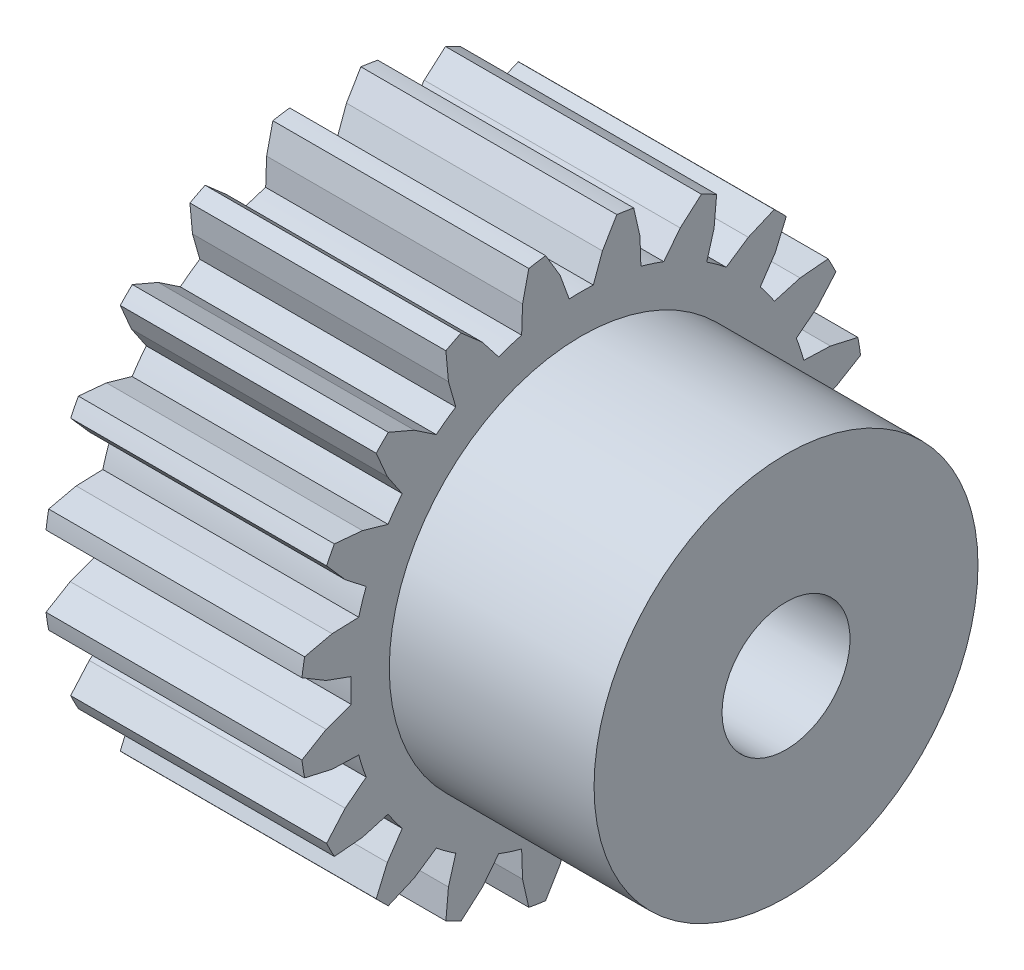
ISO-10303-21;
HEADER;
FILE_DESCRIPTION(('STEP AP214'),'2;1');
FILE_NAME('part.step','',(''),(''),'','','');
FILE_SCHEMA(('AUTOMOTIVE_DESIGN { 1 0 10303 214 1 1 1 1 }'));
ENDSEC;
DATA;
#1=APPLICATION_CONTEXT('core data for automotive mechanical design processes');
#2=APPLICATION_PROTOCOL_DEFINITION('international standard','automotive_design',2000,#1);
#3=PRODUCT_CONTEXT('',#1,'mechanical');
#4=PRODUCT('Part','Part','',(#3));
#5=PRODUCT_RELATED_PRODUCT_CATEGORY('part','',(#4));
#6=PRODUCT_DEFINITION_FORMATION('','',#4);
#7=PRODUCT_DEFINITION_CONTEXT('part definition',#1,'design');
#8=PRODUCT_DEFINITION('design','',#6,#7);
#9=PRODUCT_DEFINITION_SHAPE('','',#8);
#10=(LENGTH_UNIT() NAMED_UNIT(*) SI_UNIT(.MILLI.,.METRE.));
#11=(NAMED_UNIT(*) PLANE_ANGLE_UNIT() SI_UNIT($,.RADIAN.));
#12=(NAMED_UNIT(*) SI_UNIT($,.STERADIAN.) SOLID_ANGLE_UNIT());
#13=UNCERTAINTY_MEASURE_WITH_UNIT(LENGTH_MEASURE(1.E-05),#10,'distance_accuracy_value','');
#14=(GEOMETRIC_REPRESENTATION_CONTEXT(3) GLOBAL_UNCERTAINTY_ASSIGNED_CONTEXT((#13)) GLOBAL_UNIT_ASSIGNED_CONTEXT((#10,
#11,#12)) REPRESENTATION_CONTEXT('',''));
#15=CARTESIAN_POINT('',(0.,0.,0.));
#16=DIRECTION('',(0.,0.,1.));
#17=DIRECTION('',(1.,0.,0.));
#18=AXIS2_PLACEMENT_3D('',#15,#16,#17);
#19=CARTESIAN_POINT('',(5.,1.3907594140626,-10.9117270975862));
#20=DIRECTION('',(0.,-0.859029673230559,-0.511925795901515));
#21=DIRECTION('',(0.,-0.511925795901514,0.859029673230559));
#22=AXIS2_PLACEMENT_3D('',#19,#20,#21);
#23=PLANE('',#22);
#24=DIRECTION('',(0.,-0.511925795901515,0.859029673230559));
#25=VECTOR('',#24,1.);
#26=CARTESIAN_POINT('',(5.,1.10888711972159,-10.4387353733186));
#27=LINE('',#26,#25);
#28=CARTESIAN_POINT('',(5.,1.3907594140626,-10.9117270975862));
#29=VERTEX_POINT('',#28);
#30=CARTESIAN_POINT('',(5.,0.82701482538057,-9.96574364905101));
#31=VERTEX_POINT('',#30);
#32=EDGE_CURVE('E858',#29,#31,#27,.T.);
#33=ORIENTED_EDGE('',*,*,#32,.T.);
#34=DIRECTION('',(-1.,0.,0.));
#35=VECTOR('',#34,1.);
#36=CARTESIAN_POINT('',(5.,0.82701482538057,-9.96574364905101));
#37=LINE('',#36,#35);
#38=CARTESIAN_POINT('',(-5.,0.82701482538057,-9.96574364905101));
#39=VERTEX_POINT('',#38);
#40=EDGE_CURVE('E852',#39,#31,#37,.F.);
#41=ORIENTED_EDGE('',*,*,#40,.F.);
#42=DIRECTION('',(0.,0.511925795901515,-0.859029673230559));
#43=VECTOR('',#42,1.);
#44=CARTESIAN_POINT('',(-5.,1.10888711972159,-10.4387353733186));
#45=LINE('',#44,#43);
#46=CARTESIAN_POINT('',(-5.,1.3907594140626,-10.9117270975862));
#47=VERTEX_POINT('',#46);
#48=EDGE_CURVE('E866',#39,#47,#45,.T.);
#49=ORIENTED_EDGE('',*,*,#48,.T.);
#50=DIRECTION('',(-1.,0.,0.));
#51=VECTOR('',#50,1.);
#52=CARTESIAN_POINT('',(0.,1.3907594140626,-10.9117270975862));
#53=LINE('',#52,#51);
#54=EDGE_CURVE('E829',#29,#47,#53,.T.);
#55=ORIENTED_EDGE('',*,*,#54,.F.);
#56=EDGE_LOOP('',(#33,#41,#49,#55));
#57=FACE_BOUND('',#56,.T.);
#58=ADVANCED_FACE('F16',(#57),#23,.T.);
#59=CARTESIAN_POINT('',(5.,0.82701482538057,-9.96574364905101));
#60=DIRECTION('',(0.,-0.93969262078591,-0.342020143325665));
#61=DIRECTION('',(0.,-0.342020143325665,0.93969262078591));
#62=AXIS2_PLACEMENT_3D('',#59,#60,#61);
#63=PLANE('',#62);
#64=DIRECTION('',(0.,-0.342020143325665,0.93969262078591));
#65=VECTOR('',#64,1.);
#66=CARTESIAN_POINT('',(5.,0.649019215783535,-9.47670473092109));
#67=LINE('',#66,#65);
#68=CARTESIAN_POINT('',(5.,0.471023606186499,-8.98766581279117));
#69=VERTEX_POINT('',#68);
#70=EDGE_CURVE('E844',#31,#69,#67,.T.);
#71=ORIENTED_EDGE('',*,*,#70,.T.);
#72=DIRECTION('',(1.,0.,0.));
#73=VECTOR('',#72,1.);
#74=CARTESIAN_POINT('',(0.,0.471023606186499,-8.98766581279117));
#75=LINE('',#74,#73);
#76=CARTESIAN_POINT('',(-5.,0.471023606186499,-8.98766581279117));
#77=VERTEX_POINT('',#76);
#78=EDGE_CURVE('E823',#77,#69,#75,.T.);
#79=ORIENTED_EDGE('',*,*,#78,.F.);
#80=DIRECTION('',(0.,0.342020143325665,-0.93969262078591));
#81=VECTOR('',#80,1.);
#82=CARTESIAN_POINT('',(-5.,0.649019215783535,-9.47670473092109));
#83=LINE('',#82,#81);
#84=EDGE_CURVE('E855',#77,#39,#83,.T.);
#85=ORIENTED_EDGE('',*,*,#84,.T.);
#86=ORIENTED_EDGE('',*,*,#40,.T.);
#87=EDGE_LOOP('',(#71,#79,#85,#86));
#88=FACE_BOUND('',#87,.T.);
#89=ADVANCED_FACE('F3328',(#88),#63,.T.);
#90=CARTESIAN_POINT('',(-5.,-7.20018662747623E-13,3.04010289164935E-12));
#91=DIRECTION('',(-1.,0.,0.));
#92=DIRECTION('',(0.,-1.,0.));
#93=AXIS2_PLACEMENT_3D('',#90,#91,#92);
#94=CYLINDRICAL_SURFACE('',#93,11.0000000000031);
#95=CARTESIAN_POINT('',(5.,-7.2E-13,3.04E-12));
#96=DIRECTION('',(-1.,0.,0.));
#97=DIRECTION('',(0.,0.126432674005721,-0.991975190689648));
#98=AXIS2_PLACEMENT_3D('',#95,#96,#97);
#99=CIRCLE('',#98,11.0000000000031);
#100=CARTESIAN_POINT('',(5.,2.04921830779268,-10.807437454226));
#101=VERTEX_POINT('',#100);
#102=EDGE_CURVE('E836',#101,#29,#99,.T.);
#103=ORIENTED_EDGE('',*,*,#102,.T.);
#104=ORIENTED_EDGE('',*,*,#54,.T.);
#105=CARTESIAN_POINT('',(-5.,-7.2E-13,3.04E-12));
#106=DIRECTION('',(-1.,0.,0.));
#107=DIRECTION('',(0.,0.126432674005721,-0.991975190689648));
#108=AXIS2_PLACEMENT_3D('',#105,#106,#107);
#109=CIRCLE('',#108,11.0000000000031);
#110=CARTESIAN_POINT('',(-5.,2.04921830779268,-10.807437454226));
#111=VERTEX_POINT('',#110);
#112=EDGE_CURVE('E839',#47,#111,#109,.F.);
#113=ORIENTED_EDGE('',*,*,#112,.T.);
#114=DIRECTION('',(-1.,0.,0.));
#115=VECTOR('',#114,1.);
#116=CARTESIAN_POINT('',(5.,2.04921830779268,-10.807437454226));
#117=LINE('',#116,#115);
#118=EDGE_CURVE('E802',#101,#111,#117,.T.);
#119=ORIENTED_EDGE('',*,*,#118,.F.);
#120=EDGE_LOOP('',(#103,#104,#113,#119));
#121=FACE_BOUND('',#120,.T.);
#122=ADVANCED_FACE('F3320',(#121),#94,.T.);
#123=CARTESIAN_POINT('',(-5.,0.,0.));
#124=DIRECTION('',(-1.,0.,0.));
#125=DIRECTION('',(0.,-1.,0.));
#126=AXIS2_PLACEMENT_3D('',#123,#124,#125);
#127=CYLINDRICAL_SURFACE('',#126,9.0000000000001);
#128=CARTESIAN_POINT('',(5.,0.,1.E-13));
#129=DIRECTION('',(-1.,0.,0.));
#130=DIRECTION('',(0.,-0.0523359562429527,-0.998629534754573));
#131=AXIS2_PLACEMENT_3D('',#128,#129,#130);
#132=CIRCLE('',#131,9.0000000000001);
#133=CARTESIAN_POINT('',(5.,-0.4710236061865,-8.98766581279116));
#134=VERTEX_POINT('',#133);
#135=EDGE_CURVE('E815',#69,#134,#132,.T.);
#136=ORIENTED_EDGE('',*,*,#135,.T.);
#137=DIRECTION('',(-1.,0.,0.));
#138=VECTOR('',#137,1.);
#139=CARTESIAN_POINT('',(5.,-0.4710236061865,-8.98766581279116));
#140=LINE('',#139,#138);
#141=CARTESIAN_POINT('',(-5.,-0.4710236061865,-8.98766581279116));
#142=VERTEX_POINT('',#141);
#143=EDGE_CURVE('E796',#142,#134,#140,.F.);
#144=ORIENTED_EDGE('',*,*,#143,.F.);
#145=CARTESIAN_POINT('',(-5.,0.,1.E-13));
#146=DIRECTION('',(-1.,0.,0.));
#147=DIRECTION('',(0.,-0.0523359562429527,-0.998629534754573));
#148=AXIS2_PLACEMENT_3D('',#145,#146,#147);
#149=CIRCLE('',#148,9.0000000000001);
#150=EDGE_CURVE('E826',#142,#77,#149,.F.);
#151=ORIENTED_EDGE('',*,*,#150,.T.);
#152=ORIENTED_EDGE('',*,*,#78,.T.);
#153=EDGE_LOOP('',(#136,#144,#151,#152));
#154=FACE_BOUND('',#153,.T.);
#155=ADVANCED_FACE('F3312',(#154),#127,.T.);
#156=CARTESIAN_POINT('',(5.,2.29304631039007,-9.73354707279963));
#157=DIRECTION('',(0.,0.975179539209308,-0.221415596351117));
#158=DIRECTION('',(0.,-0.221415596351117,-0.975179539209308));
#159=AXIS2_PLACEMENT_3D('',#156,#157,#158);
#160=PLANE('',#159);
#161=DIRECTION('',(0.,-0.221415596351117,-0.975179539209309));
#162=VECTOR('',#161,1.);
#163=CARTESIAN_POINT('',(5.,2.17113230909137,-10.2704922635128));
#164=LINE('',#163,#162);
#165=CARTESIAN_POINT('',(5.,2.29304631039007,-9.73354707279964));
#166=VERTEX_POINT('',#165);
#167=EDGE_CURVE('E808',#166,#101,#164,.T.);
#168=ORIENTED_EDGE('',*,*,#167,.T.);
#169=ORIENTED_EDGE('',*,*,#118,.T.);
#170=DIRECTION('',(0.,0.221415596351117,0.975179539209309));
#171=VECTOR('',#170,1.);
#172=CARTESIAN_POINT('',(-5.,2.17113230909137,-10.2704922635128));
#173=LINE('',#172,#171);
#174=CARTESIAN_POINT('',(-5.,2.29304631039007,-9.73354707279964));
#175=VERTEX_POINT('',#174);
#176=EDGE_CURVE('E811',#111,#175,#173,.T.);
#177=ORIENTED_EDGE('',*,*,#176,.T.);
#178=DIRECTION('',(-1.,0.,0.));
#179=VECTOR('',#178,1.);
#180=CARTESIAN_POINT('',(5.,2.29304631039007,-9.73354707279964));
#181=LINE('',#180,#179);
#182=EDGE_CURVE('E770',#166,#175,#181,.T.);
#183=ORIENTED_EDGE('',*,*,#182,.F.);
#184=EDGE_LOOP('',(#168,#169,#177,#183));
#185=FACE_BOUND('',#184,.T.);
#186=ADVANCED_FACE('F3305',(#185),#160,.T.);
#187=CARTESIAN_POINT('',(5.,-0.4710236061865,-8.98766581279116));
#188=DIRECTION('',(0.,0.939692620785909,-0.342020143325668));
#189=DIRECTION('',(0.,-0.342020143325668,-0.939692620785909));
#190=AXIS2_PLACEMENT_3D('',#187,#188,#189);
#191=PLANE('',#190);
#192=DIRECTION('',(0.,-0.342020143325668,-0.939692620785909));
#193=VECTOR('',#192,1.);
#194=CARTESIAN_POINT('',(5.,-0.64901921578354,-9.47670473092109));
#195=LINE('',#194,#193);
#196=CARTESIAN_POINT('',(5.,-0.82701482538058,-9.96574364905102));
#197=VERTEX_POINT('',#196);
#198=EDGE_CURVE('E772',#134,#197,#195,.T.);
#199=ORIENTED_EDGE('',*,*,#198,.T.);
#200=DIRECTION('',(-1.,0.,0.));
#201=VECTOR('',#200,1.);
#202=CARTESIAN_POINT('',(5.,-0.82701482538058,-9.96574364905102));
#203=LINE('',#202,#201);
#204=CARTESIAN_POINT('',(-5.,-0.82701482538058,-9.96574364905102));
#205=VERTEX_POINT('',#204);
#206=EDGE_CURVE('E789',#205,#197,#203,.F.);
#207=ORIENTED_EDGE('',*,*,#206,.F.);
#208=DIRECTION('',(0.,0.342020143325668,0.939692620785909));
#209=VECTOR('',#208,1.);
#210=CARTESIAN_POINT('',(-5.,-0.64901921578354,-9.47670473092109));
#211=LINE('',#210,#209);
#212=EDGE_CURVE('E799',#205,#142,#211,.T.);
#213=ORIENTED_EDGE('',*,*,#212,.T.);
#214=ORIENTED_EDGE('',*,*,#143,.T.);
#215=EDGE_LOOP('',(#199,#207,#213,#214));
#216=FACE_BOUND('',#215,.T.);
#217=ADVANCED_FACE('F1109',(#216),#191,.T.);
#218=CARTESIAN_POINT('',(5.,2.32937140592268,-8.69333243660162));
#219=DIRECTION('',(0.,0.999390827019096,-0.0348994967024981));
#220=DIRECTION('',(0.,-0.0348994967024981,-0.999390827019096));
#221=AXIS2_PLACEMENT_3D('',#218,#219,#220);
#222=PLANE('',#221);
#223=DIRECTION('',(0.,-0.0348994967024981,-0.999390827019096));
#224=VECTOR('',#223,1.);
#225=CARTESIAN_POINT('',(5.,2.31120885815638,-9.21343975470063));
#226=LINE('',#225,#224);
#227=CARTESIAN_POINT('',(5.,2.32937140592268,-8.69333243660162));
#228=VERTEX_POINT('',#227);
#229=EDGE_CURVE('E771',#228,#166,#226,.T.);
#230=ORIENTED_EDGE('',*,*,#229,.T.);
#231=ORIENTED_EDGE('',*,*,#182,.T.);
#232=DIRECTION('',(0.,0.0348994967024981,0.999390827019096));
#233=VECTOR('',#232,1.);
#234=CARTESIAN_POINT('',(-5.,2.31120885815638,-9.21343975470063));
#235=LINE('',#234,#233);
#236=CARTESIAN_POINT('',(-5.,2.32937140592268,-8.69333243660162));
#237=VERTEX_POINT('',#236);
#238=EDGE_CURVE('E752',#175,#237,#235,.T.);
#239=ORIENTED_EDGE('',*,*,#238,.T.);
#240=DIRECTION('',(-1.,0.,0.));
#241=VECTOR('',#240,1.);
#242=CARTESIAN_POINT('',(0.,2.32937140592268,-8.69333243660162));
#243=LINE('',#242,#241);
#244=EDGE_CURVE('E767',#228,#237,#243,.T.);
#245=ORIENTED_EDGE('',*,*,#244,.F.);
#246=EDGE_LOOP('',(#230,#231,#239,#245));
#247=FACE_BOUND('',#246,.T.);
#248=ADVANCED_FACE('F766',(#247),#222,.T.);
#249=CARTESIAN_POINT('',(5.,-0.82701482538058,-9.96574364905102));
#250=DIRECTION('',(0.,0.859029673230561,-0.511925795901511));
#251=DIRECTION('',(0.,-0.511925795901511,-0.859029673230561));
#252=AXIS2_PLACEMENT_3D('',#249,#250,#251);
#253=PLANE('',#252);
#254=DIRECTION('',(0.,-0.511925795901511,-0.859029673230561));
#255=VECTOR('',#254,1.);
#256=CARTESIAN_POINT('',(5.,-1.10888711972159,-10.4387353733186));
#257=LINE('',#256,#255);
#258=CARTESIAN_POINT('',(5.,-1.3907594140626,-10.9117270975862));
#259=VERTEX_POINT('',#258);
#260=EDGE_CURVE('E761',#197,#259,#257,.T.);
#261=ORIENTED_EDGE('',*,*,#260,.T.);
#262=DIRECTION('',(1.,0.,0.));
#263=VECTOR('',#262,1.);
#264=CARTESIAN_POINT('',(0.,-1.3907594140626,-10.9117270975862));
#265=LINE('',#264,#263);
#266=CARTESIAN_POINT('',(-5.,-1.3907594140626,-10.9117270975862));
#267=VERTEX_POINT('',#266);
#268=EDGE_CURVE('E778',#267,#259,#265,.T.);
#269=ORIENTED_EDGE('',*,*,#268,.F.);
#270=DIRECTION('',(0.,0.511925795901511,0.859029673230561));
#271=VECTOR('',#270,1.);
#272=CARTESIAN_POINT('',(-5.,-1.10888711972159,-10.4387353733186));
#273=LINE('',#272,#271);
#274=EDGE_CURVE('E792',#267,#205,#273,.T.);
#275=ORIENTED_EDGE('',*,*,#274,.T.);
#276=ORIENTED_EDGE('',*,*,#206,.T.);
#277=EDGE_LOOP('',(#261,#269,#275,#276));
#278=FACE_BOUND('',#277,.T.);
#279=ADVANCED_FACE('F1104',(#278),#253,.T.);
#280=CARTESIAN_POINT('',(-5.,0.,-2.80157841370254E-13));
#281=DIRECTION('',(-1.,0.,0.));
#282=DIRECTION('',(0.,-1.,0.));
#283=AXIS2_PLACEMENT_3D('',#280,#281,#282);
#284=CYLINDRICAL_SURFACE('',#283,8.99999999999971);
#285=CARTESIAN_POINT('',(5.,0.,-2.80033124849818E-13));
#286=DIRECTION('',(-1.,0.,0.));
#287=DIRECTION('',(0.,-1.,0.));
#288=AXIS2_PLACEMENT_3D('',#285,#286,#287);
#289=CIRCLE('',#288,8.99999999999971);
#290=CARTESIAN_POINT('',(5.,3.2253115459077,-8.40222383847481));
#291=VERTEX_POINT('',#290);
#292=EDGE_CURVE('E760',#291,#228,#289,.T.);
#293=ORIENTED_EDGE('',*,*,#292,.T.);
#294=ORIENTED_EDGE('',*,*,#244,.T.);
#295=CARTESIAN_POINT('',(-5.,0.,-2.80157841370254E-13));
#296=DIRECTION('',(-1.,0.,0.));
#297=DIRECTION('',(0.,-1.,0.));
#298=AXIS2_PLACEMENT_3D('',#295,#296,#297);
#299=CIRCLE('',#298,8.99999999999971);
#300=CARTESIAN_POINT('',(-5.,3.2253115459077,-8.40222383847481));
#301=VERTEX_POINT('',#300);
#302=EDGE_CURVE('E19',#237,#301,#299,.F.);
#303=ORIENTED_EDGE('',*,*,#302,.T.);
#304=DIRECTION('',(-1.,0.,0.));
#305=VECTOR('',#304,1.);
#306=CARTESIAN_POINT('',(5.,3.2253115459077,-8.40222383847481));
#307=LINE('',#306,#305);
#308=EDGE_CURVE('E1069',#291,#301,#307,.T.);
#309=ORIENTED_EDGE('',*,*,#308,.F.);
#310=EDGE_LOOP('',(#293,#294,#303,#309));
#311=FACE_BOUND('',#310,.T.);
#312=ADVANCED_FACE('F774',(#311),#284,.T.);
#313=CARTESIAN_POINT('',(-5.,-4.39969241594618E-13,-2.96984659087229E-12));
#314=DIRECTION('',(-1.,0.,0.));
#315=DIRECTION('',(0.,-1.,0.));
#316=AXIS2_PLACEMENT_3D('',#313,#314,#315);
#317=CYLINDRICAL_SURFACE('',#316,10.999999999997);
#318=CARTESIAN_POINT('',(5.,-4.4E-13,-2.97E-12));
#319=DIRECTION('',(-1.,0.,0.));
#320=DIRECTION('',(0.,-0.186292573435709,-0.982494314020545));
#321=AXIS2_PLACEMENT_3D('',#318,#319,#320);
#322=CIRCLE('',#321,10.999999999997);
#323=CARTESIAN_POINT('',(5.,-2.04921830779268,-10.807437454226));
#324=VERTEX_POINT('',#323);
#325=EDGE_CURVE('E1082',#259,#324,#322,.T.);
#326=ORIENTED_EDGE('',*,*,#325,.T.);
#327=DIRECTION('',(-1.,0.,0.));
#328=VECTOR('',#327,1.);
#329=CARTESIAN_POINT('',(5.,-2.04921830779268,-10.807437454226));
#330=LINE('',#329,#328);
#331=CARTESIAN_POINT('',(-5.,-2.04921830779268,-10.807437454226));
#332=VERTEX_POINT('',#331);
#333=EDGE_CURVE('E1063',#332,#324,#330,.F.);
#334=ORIENTED_EDGE('',*,*,#333,.F.);
#335=CARTESIAN_POINT('',(-5.,-4.4E-13,-2.97E-12));
#336=DIRECTION('',(-1.,0.,0.));
#337=DIRECTION('',(0.,-0.186292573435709,-0.982494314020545));
#338=AXIS2_PLACEMENT_3D('',#335,#336,#337);
#339=CIRCLE('',#338,10.999999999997);
#340=EDGE_CURVE('E775',#332,#267,#339,.F.);
#341=ORIENTED_EDGE('',*,*,#340,.T.);
#342=ORIENTED_EDGE('',*,*,#268,.T.);
#343=EDGE_LOOP('',(#326,#334,#341,#342));
#344=FACE_BOUND('',#343,.T.);
#345=ADVANCED_FACE('F1118',(#344),#317,.T.);
#346=CARTESIAN_POINT('',(5.,3.86612198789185,-9.22242380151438));
#347=DIRECTION('',(0.,-0.788010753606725,-0.615661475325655));
#348=DIRECTION('',(0.,-0.615661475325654,0.788010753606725));
#349=AXIS2_PLACEMENT_3D('',#346,#347,#348);
#350=PLANE('',#349);
#351=DIRECTION('',(0.,-0.615661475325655,0.788010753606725));
#352=VECTOR('',#351,1.);
#353=CARTESIAN_POINT('',(5.,3.54571676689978,-8.8123238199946));
#354=LINE('',#353,#352);
#355=CARTESIAN_POINT('',(5.,3.86612198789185,-9.22242380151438));
#356=VERTEX_POINT('',#355);
#357=EDGE_CURVE('E1076',#356,#291,#354,.T.);
#358=ORIENTED_EDGE('',*,*,#357,.T.);
#359=ORIENTED_EDGE('',*,*,#308,.T.);
#360=DIRECTION('',(0.,0.615661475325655,-0.788010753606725));
#361=VECTOR('',#360,1.);
#362=CARTESIAN_POINT('',(-5.,3.54571676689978,-8.8123238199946));
#363=LINE('',#362,#361);
#364=CARTESIAN_POINT('',(-5.,3.86612198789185,-9.22242380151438));
#365=VERTEX_POINT('',#364);
#366=EDGE_CURVE('E755',#301,#365,#363,.T.);
#367=ORIENTED_EDGE('',*,*,#366,.T.);
#368=DIRECTION('',(-1.,0.,0.));
#369=VECTOR('',#368,1.);
#370=CARTESIAN_POINT('',(5.,3.86612198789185,-9.22242380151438));
#371=LINE('',#370,#369);
#372=EDGE_CURVE('E1046',#356,#365,#371,.T.);
#373=ORIENTED_EDGE('',*,*,#372,.F.);
#374=EDGE_LOOP('',(#358,#359,#367,#373));
#375=FACE_BOUND('',#374,.T.);
#376=ADVANCED_FACE('F3267',(#375),#350,.T.);
#377=CARTESIAN_POINT('',(5.,-2.04921830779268,-10.807437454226));
#378=DIRECTION('',(0.,-0.975179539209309,-0.221415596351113));
#379=DIRECTION('',(0.,-0.221415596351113,0.975179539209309));
#380=AXIS2_PLACEMENT_3D('',#377,#378,#379);
#381=PLANE('',#380);
#382=DIRECTION('',(0.,-0.221415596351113,0.975179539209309));
#383=VECTOR('',#382,1.);
#384=CARTESIAN_POINT('',(5.,-2.17113230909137,-10.2704922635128));
#385=LINE('',#384,#383);
#386=CARTESIAN_POINT('',(5.,-2.29304631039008,-9.73354707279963));
#387=VERTEX_POINT('',#386);
#388=EDGE_CURVE('E1052',#324,#387,#385,.T.);
#389=ORIENTED_EDGE('',*,*,#388,.T.);
#390=DIRECTION('',(-1.,0.,0.));
#391=VECTOR('',#390,1.);
#392=CARTESIAN_POINT('',(5.,-2.29304631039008,-9.73354707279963));
#393=LINE('',#392,#391);
#394=CARTESIAN_POINT('',(-5.,-2.29304631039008,-9.73354707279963));
#395=VERTEX_POINT('',#394);
#396=EDGE_CURVE('E1055',#395,#387,#393,.F.);
#397=ORIENTED_EDGE('',*,*,#396,.F.);
#398=DIRECTION('',(0.,0.221415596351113,-0.975179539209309));
#399=VECTOR('',#398,1.);
#400=CARTESIAN_POINT('',(-5.,-2.17113230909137,-10.2704922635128));
#401=LINE('',#400,#399);
#402=EDGE_CURVE('E1066',#395,#332,#401,.T.);
#403=ORIENTED_EDGE('',*,*,#402,.T.);
#404=ORIENTED_EDGE('',*,*,#333,.T.);
#405=EDGE_LOOP('',(#389,#397,#403,#404));
#406=FACE_BOUND('',#405,.T.);
#407=ADVANCED_FACE('F1121',(#406),#381,.T.);
#408=CARTESIAN_POINT('',(5.,4.69459991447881,-9.94790086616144));
#409=DIRECTION('',(0.,-0.65879199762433,-0.752325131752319));
#410=DIRECTION('',(0.,-0.752325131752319,0.65879199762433));
#411=AXIS2_PLACEMENT_3D('',#408,#409,#410);
#412=PLANE('',#411);
#413=DIRECTION('',(0.,-0.752325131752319,0.65879199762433));
#414=VECTOR('',#413,1.);
#415=CARTESIAN_POINT('',(5.,4.28036095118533,-9.58516233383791));
#416=LINE('',#415,#414);
#417=CARTESIAN_POINT('',(5.,4.69459991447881,-9.94790086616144));
#418=VERTEX_POINT('',#417);
#419=EDGE_CURVE('E1043',#418,#356,#416,.T.);
#420=ORIENTED_EDGE('',*,*,#419,.T.);
#421=ORIENTED_EDGE('',*,*,#372,.T.);
#422=DIRECTION('',(0.,0.752325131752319,-0.65879199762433));
#423=VECTOR('',#422,1.);
#424=CARTESIAN_POINT('',(-5.,4.28036095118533,-9.58516233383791));
#425=LINE('',#424,#423);
#426=CARTESIAN_POINT('',(-5.,4.69459991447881,-9.94790086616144));
#427=VERTEX_POINT('',#426);
#428=EDGE_CURVE('E1047',#365,#427,#425,.T.);
#429=ORIENTED_EDGE('',*,*,#428,.T.);
#430=DIRECTION('',(-1.,0.,0.));
#431=VECTOR('',#430,1.);
#432=CARTESIAN_POINT('',(0.,4.69459991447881,-9.94790086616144));
#433=LINE('',#432,#431);
#434=EDGE_CURVE('E1023',#418,#427,#433,.T.);
#435=ORIENTED_EDGE('',*,*,#434,.F.);
#436=EDGE_LOOP('',(#420,#421,#429,#435));
#437=FACE_BOUND('',#436,.T.);
#438=ADVANCED_FACE('F3253',(#437),#412,.T.);
#439=CARTESIAN_POINT('',(5.,-2.29304631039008,-9.73354707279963));
#440=DIRECTION('',(0.,-0.999390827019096,-0.0348994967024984));
#441=DIRECTION('',(0.,-0.0348994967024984,0.999390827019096));
#442=AXIS2_PLACEMENT_3D('',#439,#440,#441);
#443=PLANE('',#442);
#444=DIRECTION('',(0.,-0.0348994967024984,0.999390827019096));
#445=VECTOR('',#444,1.);
#446=CARTESIAN_POINT('',(5.,-2.31120885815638,-9.21343975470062));
#447=LINE('',#446,#445);
#448=CARTESIAN_POINT('',(5.,-2.32937140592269,-8.69333243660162));
#449=VERTEX_POINT('',#448);
#450=EDGE_CURVE('E1058',#387,#449,#447,.T.);
#451=ORIENTED_EDGE('',*,*,#450,.T.);
#452=DIRECTION('',(1.,0.,0.));
#453=VECTOR('',#452,1.);
#454=CARTESIAN_POINT('',(0.,-2.32937140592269,-8.69333243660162));
#455=LINE('',#454,#453);
#456=CARTESIAN_POINT('',(-5.,-2.32937140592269,-8.69333243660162));
#457=VERTEX_POINT('',#456);
#458=EDGE_CURVE('E1020',#457,#449,#455,.T.);
#459=ORIENTED_EDGE('',*,*,#458,.F.);
#460=DIRECTION('',(0.,0.0348994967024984,-0.999390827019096));
#461=VECTOR('',#460,1.);
#462=CARTESIAN_POINT('',(-5.,-2.31120885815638,-9.21343975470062));
#463=LINE('',#462,#461);
#464=EDGE_CURVE('E1059',#457,#395,#463,.T.);
#465=ORIENTED_EDGE('',*,*,#464,.T.);
#466=ORIENTED_EDGE('',*,*,#396,.T.);
#467=EDGE_LOOP('',(#451,#459,#465,#466));
#468=FACE_BOUND('',#467,.T.);
#469=ADVANCED_FACE('F1125',(#468),#443,.T.);
#470=CARTESIAN_POINT('',(-5.,-3.40005801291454E-13,6.60062282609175E-13));
#471=DIRECTION('',(-1.,0.,0.));
#472=DIRECTION('',(0.,-1.,0.));
#473=AXIS2_PLACEMENT_3D('',#470,#471,#472);
#474=CYLINDRICAL_SURFACE('',#473,11.0000000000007);
#475=CARTESIAN_POINT('',(5.,-3.4E-13,6.6E-13));
#476=DIRECTION('',(-1.,0.,0.));
#477=DIRECTION('',(0.,0.426781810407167,-0.904354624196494));
#478=AXIS2_PLACEMENT_3D('',#475,#476,#477);
#479=CIRCLE('',#478,11.0000000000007);
#480=CARTESIAN_POINT('',(5.,5.28860426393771,-9.64524053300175));
#481=VERTEX_POINT('',#480);
#482=EDGE_CURVE('E1029',#481,#418,#479,.T.);
#483=ORIENTED_EDGE('',*,*,#482,.T.);
#484=ORIENTED_EDGE('',*,*,#434,.T.);
#485=CARTESIAN_POINT('',(-5.,-3.4E-13,6.6E-13));
#486=DIRECTION('',(-1.,0.,0.));
#487=DIRECTION('',(0.,0.426781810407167,-0.904354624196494));
#488=AXIS2_PLACEMENT_3D('',#485,#486,#487);
#489=CIRCLE('',#488,11.0000000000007);
#490=CARTESIAN_POINT('',(-5.,5.28860426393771,-9.64524053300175));
#491=VERTEX_POINT('',#490);
#492=EDGE_CURVE('E1035',#427,#491,#489,.F.);
#493=ORIENTED_EDGE('',*,*,#492,.T.);
#494=DIRECTION('',(-1.,0.,0.));
#495=VECTOR('',#494,1.);
#496=CARTESIAN_POINT('',(5.,5.28860426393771,-9.64524053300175));
#497=LINE('',#496,#495);
#498=EDGE_CURVE('E1143',#481,#491,#497,.T.);
#499=ORIENTED_EDGE('',*,*,#498,.F.);
#500=EDGE_LOOP('',(#483,#484,#493,#499));
#501=FACE_BOUND('',#500,.T.);
#502=ADVANCED_FACE('F1162',(#501),#474,.T.);
#503=CARTESIAN_POINT('',(-5.,2.50017020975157E-13,6.09755301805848E-13));
#504=DIRECTION('',(-1.,0.,0.));
#505=DIRECTION('',(0.,-1.,0.));
#506=AXIS2_PLACEMENT_3D('',#503,#504,#505);
#507=CYLINDRICAL_SURFACE('',#506,9.00000000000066);
#508=CARTESIAN_POINT('',(5.,2.50466883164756E-13,6.09582615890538E-13));
#509=DIRECTION('',(-1.,0.,0.));
#510=DIRECTION('',(0.,-1.,0.));
#511=AXIS2_PLACEMENT_3D('',#508,#509,#510);
#512=CIRCLE('',#511,9.00000000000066);
#513=CARTESIAN_POINT('',(5.,-3.22531154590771,-8.40222383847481));
#514=VERTEX_POINT('',#513);
#515=EDGE_CURVE('E1017',#449,#514,#512,.T.);
#516=ORIENTED_EDGE('',*,*,#515,.T.);
#517=DIRECTION('',(-1.,0.,0.));
#518=VECTOR('',#517,1.);
#519=CARTESIAN_POINT('',(5.,-3.22531154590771,-8.40222383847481));
#520=LINE('',#519,#518);
#521=CARTESIAN_POINT('',(-5.,-3.22531154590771,-8.40222383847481));
#522=VERTEX_POINT('',#521);
#523=EDGE_CURVE('E1130',#522,#514,#520,.F.);
#524=ORIENTED_EDGE('',*,*,#523,.F.);
#525=CARTESIAN_POINT('',(-5.,2.50017020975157E-13,6.09755301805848E-13));
#526=DIRECTION('',(-1.,0.,0.));
#527=DIRECTION('',(0.,-1.,0.));
#528=AXIS2_PLACEMENT_3D('',#525,#526,#527);
#529=CIRCLE('',#528,9.00000000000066);
#530=EDGE_CURVE('E1021',#522,#457,#529,.F.);
#531=ORIENTED_EDGE('',*,*,#530,.T.);
#532=ORIENTED_EDGE('',*,*,#458,.T.);
#533=EDGE_LOOP('',(#516,#524,#531,#532));
#534=FACE_BOUND('',#533,.T.);
#535=ADVANCED_FACE('F1127',(#534),#507,.T.);
#536=CARTESIAN_POINT('',(5.,5.18864809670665,-8.54856309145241));
#537=DIRECTION('',(0.,0.995872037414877,0.0907683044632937));
#538=DIRECTION('',(0.,0.0907683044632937,-0.995872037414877));
#539=AXIS2_PLACEMENT_3D('',#536,#537,#538);
#540=PLANE('',#539);
#541=DIRECTION('',(0.,0.0907683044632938,-0.995872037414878));
#542=VECTOR('',#541,1.);
#543=CARTESIAN_POINT('',(5.,5.23862618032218,-9.09690181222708));
#544=LINE('',#543,#542);
#545=CARTESIAN_POINT('',(5.,5.18864809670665,-8.54856309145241));
#546=VERTEX_POINT('',#545);
#547=EDGE_CURVE('E1151',#546,#481,#544,.T.);
#548=ORIENTED_EDGE('',*,*,#547,.T.);
#549=ORIENTED_EDGE('',*,*,#498,.T.);
#550=DIRECTION('',(0.,-0.0907683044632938,0.995872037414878));
#551=VECTOR('',#550,1.);
#552=CARTESIAN_POINT('',(-5.,5.23862618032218,-9.09690181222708));
#553=LINE('',#552,#551);
#554=CARTESIAN_POINT('',(-5.,5.18864809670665,-8.54856309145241));
#555=VERTEX_POINT('',#554);
#556=EDGE_CURVE('E1019',#491,#555,#553,.T.);
#557=ORIENTED_EDGE('',*,*,#556,.T.);
#558=DIRECTION('',(-1.,0.,0.));
#559=VECTOR('',#558,1.);
#560=CARTESIAN_POINT('',(5.,5.18864809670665,-8.54856309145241));
#561=LINE('',#560,#559);
#562=EDGE_CURVE('E1169',#546,#555,#561,.T.);
#563=ORIENTED_EDGE('',*,*,#562,.F.);
#564=EDGE_LOOP('',(#548,#549,#557,#563));
#565=FACE_BOUND('',#564,.T.);
#566=ADVANCED_FACE('F1166',(#565),#540,.T.);
#567=CARTESIAN_POINT('',(5.,-3.22531154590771,-8.40222383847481));
#568=DIRECTION('',(0.,0.788010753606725,-0.615661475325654));
#569=DIRECTION('',(0.,-0.615661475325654,-0.788010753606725));
#570=AXIS2_PLACEMENT_3D('',#567,#568,#569);
#571=PLANE('',#570);
#572=DIRECTION('',(0.,-0.615661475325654,-0.788010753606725));
#573=VECTOR('',#572,1.);
#574=CARTESIAN_POINT('',(5.,-3.54571676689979,-8.8123238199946));
#575=LINE('',#574,#573);
#576=CARTESIAN_POINT('',(5.,-3.86612198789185,-9.22242380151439));
#577=VERTEX_POINT('',#576);
#578=EDGE_CURVE('E1133',#514,#577,#575,.T.);
#579=ORIENTED_EDGE('',*,*,#578,.T.);
#580=DIRECTION('',(-1.,0.,0.));
#581=VECTOR('',#580,1.);
#582=CARTESIAN_POINT('',(5.,-3.86612198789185,-9.22242380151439));
#583=LINE('',#582,#581);
#584=CARTESIAN_POINT('',(-5.,-3.86612198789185,-9.22242380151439));
#585=VERTEX_POINT('',#584);
#586=EDGE_CURVE('E1186',#585,#577,#583,.F.);
#587=ORIENTED_EDGE('',*,*,#586,.F.);
#588=DIRECTION('',(0.,0.615661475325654,0.788010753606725));
#589=VECTOR('',#588,1.);
#590=CARTESIAN_POINT('',(-5.,-3.54571676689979,-8.8123238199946));
#591=LINE('',#590,#589);
#592=EDGE_CURVE('E1141',#585,#522,#591,.T.);
#593=ORIENTED_EDGE('',*,*,#592,.T.);
#594=ORIENTED_EDGE('',*,*,#523,.T.);
#595=EDGE_LOOP('',(#579,#587,#593,#594));
#596=FACE_BOUND('',#595,.T.);
#597=ADVANCED_FACE('F1140',(#596),#571,.T.);
#598=CARTESIAN_POINT('',(5.,4.90175131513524,-7.54803511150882));
#599=DIRECTION('',(0.,0.961261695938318,0.275637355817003));
#600=DIRECTION('',(0.,0.275637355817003,-0.961261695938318));
#601=AXIS2_PLACEMENT_3D('',#598,#599,#600);
#602=PLANE('',#601);
#603=DIRECTION('',(0.,0.275637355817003,-0.961261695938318));
#604=VECTOR('',#603,1.);
#605=CARTESIAN_POINT('',(5.,5.04519970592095,-8.04829910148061));
#606=LINE('',#605,#604);
#607=CARTESIAN_POINT('',(5.,4.90175131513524,-7.54803511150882));
#608=VERTEX_POINT('',#607);
#609=EDGE_CURVE('E1179',#608,#546,#606,.T.);
#610=ORIENTED_EDGE('',*,*,#609,.T.);
#611=ORIENTED_EDGE('',*,*,#562,.T.);
#612=DIRECTION('',(0.,-0.275637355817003,0.961261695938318));
#613=VECTOR('',#612,1.);
#614=CARTESIAN_POINT('',(-5.,5.04519970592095,-8.04829910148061));
#615=LINE('',#614,#613);
#616=CARTESIAN_POINT('',(-5.,4.90175131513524,-7.54803511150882));
#617=VERTEX_POINT('',#616);
#618=EDGE_CURVE('E1138',#555,#617,#615,.T.);
#619=ORIENTED_EDGE('',*,*,#618,.T.);
#620=DIRECTION('',(-1.,0.,0.));
#621=VECTOR('',#620,1.);
#622=CARTESIAN_POINT('',(0.,4.90175131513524,-7.54803511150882));
#623=LINE('',#622,#621);
#624=EDGE_CURVE('E1012',#608,#617,#623,.T.);
#625=ORIENTED_EDGE('',*,*,#624,.F.);
#626=EDGE_LOOP('',(#610,#611,#619,#625));
#627=FACE_BOUND('',#626,.T.);
#628=ADVANCED_FACE('F3214',(#627),#602,.T.);
#629=CARTESIAN_POINT('',(5.,-3.86612198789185,-9.22242380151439));
#630=DIRECTION('',(0.,0.65879199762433,-0.752325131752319));
#631=DIRECTION('',(0.,-0.752325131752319,-0.65879199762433));
#632=AXIS2_PLACEMENT_3D('',#629,#630,#631);
#633=PLANE('',#632);
#634=DIRECTION('',(0.,-0.75232513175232,-0.65879199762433));
#635=VECTOR('',#634,1.);
#636=CARTESIAN_POINT('',(5.,-4.28036095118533,-9.58516233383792));
#637=LINE('',#636,#635);
#638=CARTESIAN_POINT('',(5.,-4.69459991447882,-9.94790086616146));
#639=VERTEX_POINT('',#638);
#640=EDGE_CURVE('E1016',#577,#639,#637,.T.);
#641=ORIENTED_EDGE('',*,*,#640,.T.);
#642=DIRECTION('',(1.,0.,0.));
#643=VECTOR('',#642,1.);
#644=CARTESIAN_POINT('',(0.,-4.69459991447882,-9.94790086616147));
#645=LINE('',#644,#643);
#646=CARTESIAN_POINT('',(-5.,-4.69459991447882,-9.94790086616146));
#647=VERTEX_POINT('',#646);
#648=EDGE_CURVE('E1207',#647,#639,#645,.T.);
#649=ORIENTED_EDGE('',*,*,#648,.F.);
#650=DIRECTION('',(0.,0.75232513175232,0.65879199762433));
#651=VECTOR('',#650,1.);
#652=CARTESIAN_POINT('',(-5.,-4.28036095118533,-9.58516233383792));
#653=LINE('',#652,#651);
#654=EDGE_CURVE('E1178',#647,#585,#653,.T.);
#655=ORIENTED_EDGE('',*,*,#654,.T.);
#656=ORIENTED_EDGE('',*,*,#586,.T.);
#657=EDGE_LOOP('',(#641,#649,#655,#656));
#658=FACE_BOUND('',#657,.T.);
#659=ADVANCED_FACE('F3206',(#658),#633,.T.);
#660=CARTESIAN_POINT('',(-5.,4.30211422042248E-13,-3.99853761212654E-13));
#661=DIRECTION('',(-1.,0.,0.));
#662=DIRECTION('',(0.,-1.,0.));
#663=AXIS2_PLACEMENT_3D('',#660,#661,#662);
#664=CYLINDRICAL_SURFACE('',#663,8.99999999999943);
#665=CARTESIAN_POINT('',(5.,4.30615550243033E-13,-3.99591317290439E-13));
#666=DIRECTION('',(-1.,0.,0.));
#667=DIRECTION('',(0.,-1.,0.));
#668=AXIS2_PLACEMENT_3D('',#665,#666,#667);
#669=CIRCLE('',#668,8.99999999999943);
#670=CARTESIAN_POINT('',(5.,5.66388351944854,-6.99431365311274));
#671=VERTEX_POINT('',#670);
#672=EDGE_CURVE('E1009',#671,#608,#669,.T.);
#673=ORIENTED_EDGE('',*,*,#672,.T.);
#674=ORIENTED_EDGE('',*,*,#624,.T.);
#675=CARTESIAN_POINT('',(-5.,4.30211422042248E-13,-3.99853761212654E-13));
#676=DIRECTION('',(-1.,0.,0.));
#677=DIRECTION('',(0.,-1.,0.));
#678=AXIS2_PLACEMENT_3D('',#675,#676,#677);
#679=CIRCLE('',#678,8.99999999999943);
#680=CARTESIAN_POINT('',(-5.,5.66388351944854,-6.99431365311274));
#681=VERTEX_POINT('',#680);
#682=EDGE_CURVE('E1013',#617,#681,#679,.F.);
#683=ORIENTED_EDGE('',*,*,#682,.T.);
#684=DIRECTION('',(-1.,0.,0.));
#685=VECTOR('',#684,1.);
#686=CARTESIAN_POINT('',(5.,5.66388351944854,-6.99431365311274));
#687=LINE('',#686,#685);
#688=EDGE_CURVE('E1211',#671,#681,#687,.T.);
#689=ORIENTED_EDGE('',*,*,#688,.F.);
#690=EDGE_LOOP('',(#673,#674,#683,#689));
#691=FACE_BOUND('',#690,.T.);
#692=ADVANCED_FACE('F3198',(#691),#664,.T.);
#693=CARTESIAN_POINT('',(-5.,8.30065183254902E-13,8.89913143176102E-13));
#694=DIRECTION('',(-1.,0.,0.));
#695=DIRECTION('',(0.,-1.,0.));
#696=AXIS2_PLACEMENT_3D('',#693,#694,#695);
#697=CYLINDRICAL_SURFACE('',#696,11.0000000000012);
#698=CARTESIAN_POINT('',(5.,8.30000000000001E-13,8.90000000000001E-13));
#699=DIRECTION('',(-1.,0.,0.));
#700=DIRECTION('',(0.,-0.480782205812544,-0.876840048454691));
#701=AXIS2_PLACEMENT_3D('',#698,#699,#700);
#702=CIRCLE('',#701,11.0000000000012);
#703=CARTESIAN_POINT('',(5.,-5.28860426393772,-9.64524053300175));
#704=VERTEX_POINT('',#703);
#705=EDGE_CURVE('E1210',#639,#704,#702,.T.);
#706=ORIENTED_EDGE('',*,*,#705,.T.);
#707=DIRECTION('',(-1.,0.,0.));
#708=VECTOR('',#707,1.);
#709=CARTESIAN_POINT('',(5.,-5.28860426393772,-9.64524053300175));
#710=LINE('',#709,#708);
#711=CARTESIAN_POINT('',(-5.,-5.28860426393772,-9.64524053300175));
#712=VERTEX_POINT('',#711);
#713=EDGE_CURVE('E1226',#712,#704,#710,.F.);
#714=ORIENTED_EDGE('',*,*,#713,.F.);
#715=CARTESIAN_POINT('',(-5.,8.30000000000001E-13,8.90000000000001E-13));
#716=DIRECTION('',(-1.,0.,0.));
#717=DIRECTION('',(0.,-0.480782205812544,-0.876840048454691));
#718=AXIS2_PLACEMENT_3D('',#715,#716,#717);
#719=CIRCLE('',#718,11.0000000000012);
#720=EDGE_CURVE('E1197',#712,#647,#719,.F.);
#721=ORIENTED_EDGE('',*,*,#720,.T.);
#722=ORIENTED_EDGE('',*,*,#648,.T.);
#723=EDGE_LOOP('',(#706,#714,#721,#722));
#724=FACE_BOUND('',#723,.T.);
#725=ADVANCED_FACE('F3190',(#724),#697,.T.);
#726=CARTESIAN_POINT('',(5.,6.52678619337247,-7.57634885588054));
#727=DIRECTION('',(0.,-0.55919290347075,-0.829037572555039));
#728=DIRECTION('',(0.,-0.829037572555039,0.55919290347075));
#729=AXIS2_PLACEMENT_3D('',#726,#727,#728);
#730=PLANE('',#729);
#731=DIRECTION('',(0.,-0.829037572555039,0.55919290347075));
#732=VECTOR('',#731,1.);
#733=CARTESIAN_POINT('',(5.,6.0953348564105,-7.28533125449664));
#734=LINE('',#733,#732);
#735=CARTESIAN_POINT('',(5.,6.52678619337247,-7.57634885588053));
#736=VERTEX_POINT('',#735);
#737=EDGE_CURVE('E1215',#736,#671,#734,.T.);
#738=ORIENTED_EDGE('',*,*,#737,.T.);
#739=ORIENTED_EDGE('',*,*,#688,.T.);
#740=DIRECTION('',(0.,0.829037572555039,-0.55919290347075));
#741=VECTOR('',#740,1.);
#742=CARTESIAN_POINT('',(-5.,6.0953348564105,-7.28533125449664));
#743=LINE('',#742,#741);
#744=CARTESIAN_POINT('',(-5.,6.52678619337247,-7.57634885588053));
#745=VERTEX_POINT('',#744);
#746=EDGE_CURVE('E1223',#681,#745,#743,.T.);
#747=ORIENTED_EDGE('',*,*,#746,.T.);
#748=DIRECTION('',(-1.,0.,0.));
#749=VECTOR('',#748,1.);
#750=CARTESIAN_POINT('',(5.,6.52678619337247,-7.57634885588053));
#751=LINE('',#750,#749);
#752=EDGE_CURVE('E1240',#736,#745,#751,.T.);
#753=ORIENTED_EDGE('',*,*,#752,.F.);
#754=EDGE_LOOP('',(#738,#739,#747,#753));
#755=FACE_BOUND('',#754,.T.);
#756=ADVANCED_FACE('F3182',(#755),#730,.T.);
#757=CARTESIAN_POINT('',(5.,-5.28860426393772,-9.64524053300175));
#758=DIRECTION('',(0.,-0.995872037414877,0.090768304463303));
#759=DIRECTION('',(0.,0.090768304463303,0.995872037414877));
#760=AXIS2_PLACEMENT_3D('',#757,#758,#759);
#761=PLANE('',#760);
#762=DIRECTION('',(0.,0.090768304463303,0.995872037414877));
#763=VECTOR('',#762,1.);
#764=CARTESIAN_POINT('',(5.,-5.23862618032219,-9.09690181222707));
#765=LINE('',#764,#763);
#766=CARTESIAN_POINT('',(5.,-5.18864809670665,-8.5485630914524));
#767=VERTEX_POINT('',#766);
#768=EDGE_CURVE('E1229',#704,#767,#765,.T.);
#769=ORIENTED_EDGE('',*,*,#768,.T.);
#770=DIRECTION('',(-1.,0.,0.));
#771=VECTOR('',#770,1.);
#772=CARTESIAN_POINT('',(5.,-5.18864809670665,-8.5485630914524));
#773=LINE('',#772,#771);
#774=CARTESIAN_POINT('',(-5.,-5.18864809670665,-8.5485630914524));
#775=VERTEX_POINT('',#774);
#776=EDGE_CURVE('E1255',#775,#767,#773,.F.);
#777=ORIENTED_EDGE('',*,*,#776,.F.);
#778=DIRECTION('',(0.,-0.090768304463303,-0.995872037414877));
#779=VECTOR('',#778,1.);
#780=CARTESIAN_POINT('',(-5.,-5.23862618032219,-9.09690181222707));
#781=LINE('',#780,#779);
#782=EDGE_CURVE('E1214',#775,#712,#781,.T.);
#783=ORIENTED_EDGE('',*,*,#782,.T.);
#784=ORIENTED_EDGE('',*,*,#713,.T.);
#785=EDGE_LOOP('',(#769,#777,#783,#784));
#786=FACE_BOUND('',#785,.T.);
#787=ADVANCED_FACE('F3174',(#786),#761,.T.);
#788=CARTESIAN_POINT('',(5.,7.53890026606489,-8.01030478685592));
#789=DIRECTION('',(0.,-0.39406717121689,-0.919081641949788));
#790=DIRECTION('',(0.,-0.919081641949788,0.39406717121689));
#791=AXIS2_PLACEMENT_3D('',#788,#789,#790);
#792=PLANE('',#791);
#793=DIRECTION('',(0.,-0.919081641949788,0.39406717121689));
#794=VECTOR('',#793,1.);
#795=CARTESIAN_POINT('',(5.,7.03284322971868,-7.79332682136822));
#796=LINE('',#795,#794);
#797=CARTESIAN_POINT('',(5.,7.53890026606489,-8.01030478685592));
#798=VERTEX_POINT('',#797);
#799=EDGE_CURVE('E1244',#798,#736,#796,.T.);
#800=ORIENTED_EDGE('',*,*,#799,.T.);
#801=ORIENTED_EDGE('',*,*,#752,.T.);
#802=DIRECTION('',(0.,0.919081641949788,-0.39406717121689));
#803=VECTOR('',#802,1.);
#804=CARTESIAN_POINT('',(-5.,7.03284322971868,-7.79332682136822));
#805=LINE('',#804,#803);
#806=CARTESIAN_POINT('',(-5.,7.53890026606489,-8.01030478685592));
#807=VERTEX_POINT('',#806);
#808=EDGE_CURVE('E1252',#745,#807,#805,.T.);
#809=ORIENTED_EDGE('',*,*,#808,.T.);
#810=DIRECTION('',(-1.,0.,0.));
#811=VECTOR('',#810,1.);
#812=CARTESIAN_POINT('',(0.,7.53890026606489,-8.01030478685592));
#813=LINE('',#812,#811);
#814=EDGE_CURVE('E1008',#798,#807,#813,.T.);
#815=ORIENTED_EDGE('',*,*,#814,.F.);
#816=EDGE_LOOP('',(#800,#801,#809,#815));
#817=FACE_BOUND('',#816,.T.);
#818=ADVANCED_FACE('F3166',(#817),#792,.T.);
#819=CARTESIAN_POINT('',(5.,-5.18864809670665,-8.5485630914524));
#820=DIRECTION('',(0.,-0.961261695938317,0.275637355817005));
#821=DIRECTION('',(0.,0.275637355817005,0.961261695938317));
#822=AXIS2_PLACEMENT_3D('',#819,#820,#821);
#823=PLANE('',#822);
#824=DIRECTION('',(0.,0.275637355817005,0.961261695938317));
#825=VECTOR('',#824,1.);
#826=CARTESIAN_POINT('',(5.,-5.04519970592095,-8.04829910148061));
#827=LINE('',#826,#825);
#828=CARTESIAN_POINT('',(5.,-4.90175131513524,-7.54803511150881));
#829=VERTEX_POINT('',#828);
#830=EDGE_CURVE('E1258',#767,#829,#827,.T.);
#831=ORIENTED_EDGE('',*,*,#830,.T.);
#832=DIRECTION('',(1.,0.,0.));
#833=VECTOR('',#832,1.);
#834=CARTESIAN_POINT('',(0.,-4.90175131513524,-7.54803511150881));
#835=LINE('',#834,#833);
#836=CARTESIAN_POINT('',(-5.,-4.90175131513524,-7.54803511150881));
#837=VERTEX_POINT('',#836);
#838=EDGE_CURVE('E1004',#837,#829,#835,.T.);
#839=ORIENTED_EDGE('',*,*,#838,.F.);
#840=DIRECTION('',(0.,-0.275637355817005,-0.961261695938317));
#841=VECTOR('',#840,1.);
#842=CARTESIAN_POINT('',(-5.,-5.04519970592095,-8.04829910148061));
#843=LINE('',#842,#841);
#844=EDGE_CURVE('E1243',#837,#775,#843,.T.);
#845=ORIENTED_EDGE('',*,*,#844,.T.);
#846=ORIENTED_EDGE('',*,*,#776,.T.);
#847=EDGE_LOOP('',(#831,#839,#845,#846));
#848=FACE_BOUND('',#847,.T.);
#849=ADVANCED_FACE('F3158',(#848),#823,.T.);
#850=CARTESIAN_POINT('',(-5.,-1.719978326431E-12,1.7503359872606E-12));
#851=DIRECTION('',(-1.,0.,0.));
#852=DIRECTION('',(0.,-1.,0.));
#853=AXIS2_PLACEMENT_3D('',#850,#851,#852);
#854=CYLINDRICAL_SURFACE('',#853,11.0000000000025);
#855=CARTESIAN_POINT('',(5.,-1.72E-12,1.75E-12));
#856=DIRECTION('',(-1.,0.,0.));
#857=DIRECTION('',(0.,0.685354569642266,-0.728209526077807));
#858=AXIS2_PLACEMENT_3D('',#855,#856,#857);
#859=CIRCLE('',#858,11.0000000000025);
#860=CARTESIAN_POINT('',(5.,8.01030478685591,-7.53890026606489));
#861=VERTEX_POINT('',#860);
#862=EDGE_CURVE('E1271',#861,#798,#859,.T.);
#863=ORIENTED_EDGE('',*,*,#862,.T.);
#864=ORIENTED_EDGE('',*,*,#814,.T.);
#865=CARTESIAN_POINT('',(-5.,-1.72E-12,1.75E-12));
#866=DIRECTION('',(-1.,0.,0.));
#867=DIRECTION('',(0.,0.685354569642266,-0.728209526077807));
#868=AXIS2_PLACEMENT_3D('',#865,#866,#867);
#869=CIRCLE('',#868,11.0000000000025);
#870=CARTESIAN_POINT('',(-5.,8.01030478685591,-7.53890026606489));
#871=VERTEX_POINT('',#870);
#872=EDGE_CURVE('E1279',#807,#871,#869,.F.);
#873=ORIENTED_EDGE('',*,*,#872,.T.);
#874=DIRECTION('',(-1.,0.,0.));
#875=VECTOR('',#874,1.);
#876=CARTESIAN_POINT('',(5.,8.01030478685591,-7.53890026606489));
#877=LINE('',#876,#875);
#878=EDGE_CURVE('E1292',#861,#871,#877,.T.);
#879=ORIENTED_EDGE('',*,*,#878,.F.);
#880=EDGE_LOOP('',(#863,#864,#873,#879));
#881=FACE_BOUND('',#880,.T.);
#882=ADVANCED_FACE('F3150',(#881),#854,.T.);
#883=CARTESIAN_POINT('',(-5.,-6.60062282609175E-13,-8.89913143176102E-13));
#884=DIRECTION('',(-1.,0.,0.));
#885=DIRECTION('',(0.,-1.,0.));
#886=AXIS2_PLACEMENT_3D('',#883,#884,#885);
#887=CYLINDRICAL_SURFACE('',#886,8.99999999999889);
#888=CARTESIAN_POINT('',(5.,-6.59687801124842E-13,-8.90216392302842E-13));
#889=DIRECTION('',(-1.,0.,0.));
#890=DIRECTION('',(0.,-1.,0.));
#891=AXIS2_PLACEMENT_3D('',#888,#889,#890);
#892=CIRCLE('',#891,8.99999999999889);
#893=CARTESIAN_POINT('',(5.,-5.66388351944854,-6.99431365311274));
#894=VERTEX_POINT('',#893);
#895=EDGE_CURVE('E1001',#829,#894,#892,.T.);
#896=ORIENTED_EDGE('',*,*,#895,.T.);
#897=DIRECTION('',(-1.,0.,0.));
#898=VECTOR('',#897,1.);
#899=CARTESIAN_POINT('',(5.,-5.66388351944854,-6.99431365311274));
#900=LINE('',#899,#898);
#901=CARTESIAN_POINT('',(-5.,-5.66388351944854,-6.99431365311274));
#902=VERTEX_POINT('',#901);
#903=EDGE_CURVE('E1297',#902,#894,#900,.F.);
#904=ORIENTED_EDGE('',*,*,#903,.F.);
#905=CARTESIAN_POINT('',(-5.,-6.60062282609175E-13,-8.89913143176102E-13));
#906=DIRECTION('',(-1.,0.,0.));
#907=DIRECTION('',(0.,-1.,0.));
#908=AXIS2_PLACEMENT_3D('',#905,#906,#907);
#909=CIRCLE('',#908,8.99999999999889);
#910=EDGE_CURVE('E1005',#902,#837,#909,.F.);
#911=ORIENTED_EDGE('',*,*,#910,.T.);
#912=ORIENTED_EDGE('',*,*,#838,.T.);
#913=EDGE_LOOP('',(#896,#904,#911,#912));
#914=FACE_BOUND('',#913,.T.);
#915=ADVANCED_FACE('F3142',(#914),#887,.T.);
#916=CARTESIAN_POINT('',(5.,7.57634885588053,-6.52678619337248));
#917=DIRECTION('',(0.,0.919081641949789,0.394067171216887));
#918=DIRECTION('',(0.,0.394067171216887,-0.919081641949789));
#919=AXIS2_PLACEMENT_3D('',#916,#917,#918);
#920=PLANE('',#919);
#921=DIRECTION('',(0.,0.394067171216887,-0.919081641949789));
#922=VECTOR('',#921,1.);
#923=CARTESIAN_POINT('',(5.,7.79332682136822,-7.03284322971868));
#924=LINE('',#923,#922);
#925=CARTESIAN_POINT('',(5.,7.57634885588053,-6.52678619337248));
#926=VERTEX_POINT('',#925);
#927=EDGE_CURVE('E1296',#926,#861,#924,.T.);
#928=ORIENTED_EDGE('',*,*,#927,.T.);
#929=ORIENTED_EDGE('',*,*,#878,.T.);
#930=DIRECTION('',(0.,-0.394067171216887,0.919081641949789));
#931=VECTOR('',#930,1.);
#932=CARTESIAN_POINT('',(-5.,7.79332682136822,-7.03284322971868));
#933=LINE('',#932,#931);
#934=CARTESIAN_POINT('',(-5.,7.57634885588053,-6.52678619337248));
#935=VERTEX_POINT('',#934);
#936=EDGE_CURVE('E1003',#871,#935,#933,.T.);
#937=ORIENTED_EDGE('',*,*,#936,.T.);
#938=DIRECTION('',(-1.,0.,0.));
#939=VECTOR('',#938,1.);
#940=CARTESIAN_POINT('',(5.,7.57634885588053,-6.52678619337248));
#941=LINE('',#940,#939);
#942=EDGE_CURVE('E1311',#926,#935,#941,.T.);
#943=ORIENTED_EDGE('',*,*,#942,.F.);
#944=EDGE_LOOP('',(#928,#929,#937,#943));
#945=FACE_BOUND('',#944,.T.);
#946=ADVANCED_FACE('F3134',(#945),#920,.T.);
#947=CARTESIAN_POINT('',(5.,-5.66388351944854,-6.99431365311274));
#948=DIRECTION('',(0.,0.559192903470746,-0.829037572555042));
#949=DIRECTION('',(0.,-0.829037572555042,-0.559192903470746));
#950=AXIS2_PLACEMENT_3D('',#947,#948,#949);
#951=PLANE('',#950);
#952=DIRECTION('',(0.,-0.829037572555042,-0.559192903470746));
#953=VECTOR('',#952,1.);
#954=CARTESIAN_POINT('',(5.,-6.09533485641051,-7.28533125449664));
#955=LINE('',#954,#953);
#956=CARTESIAN_POINT('',(5.,-6.52678619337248,-7.57634885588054));
#957=VERTEX_POINT('',#956);
#958=EDGE_CURVE('E1300',#894,#957,#955,.T.);
#959=ORIENTED_EDGE('',*,*,#958,.T.);
#960=DIRECTION('',(-1.,0.,0.));
#961=VECTOR('',#960,1.);
#962=CARTESIAN_POINT('',(5.,-6.52678619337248,-7.57634885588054));
#963=LINE('',#962,#961);
#964=CARTESIAN_POINT('',(-5.,-6.52678619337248,-7.57634885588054));
#965=VERTEX_POINT('',#964);
#966=EDGE_CURVE('E1326',#965,#957,#963,.F.);
#967=ORIENTED_EDGE('',*,*,#966,.F.);
#968=DIRECTION('',(0.,0.829037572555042,0.559192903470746));
#969=VECTOR('',#968,1.);
#970=CARTESIAN_POINT('',(-5.,-6.09533485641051,-7.28533125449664));
#971=LINE('',#970,#969);
#972=EDGE_CURVE('E1295',#965,#902,#971,.T.);
#973=ORIENTED_EDGE('',*,*,#972,.T.);
#974=ORIENTED_EDGE('',*,*,#903,.T.);
#975=EDGE_LOOP('',(#959,#967,#973,#974));
#976=FACE_BOUND('',#975,.T.);
#977=ADVANCED_FACE('F3126',(#976),#951,.T.);
#978=CARTESIAN_POINT('',(5.,6.99431365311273,-5.66388351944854));
#979=DIRECTION('',(0.,0.829037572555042,0.559192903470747));
#980=DIRECTION('',(0.,0.559192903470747,-0.829037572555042));
#981=AXIS2_PLACEMENT_3D('',#978,#979,#980);
#982=PLANE('',#981);
#983=DIRECTION('',(0.,0.559192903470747,-0.829037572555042));
#984=VECTOR('',#983,1.);
#985=CARTESIAN_POINT('',(5.,7.28533125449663,-6.09533485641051));
#986=LINE('',#985,#984);
#987=CARTESIAN_POINT('',(5.,6.99431365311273,-5.66388351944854));
#988=VERTEX_POINT('',#987);
#989=EDGE_CURVE('E1315',#988,#926,#986,.T.);
#990=ORIENTED_EDGE('',*,*,#989,.T.);
#991=ORIENTED_EDGE('',*,*,#942,.T.);
#992=DIRECTION('',(0.,-0.559192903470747,0.829037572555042));
#993=VECTOR('',#992,1.);
#994=CARTESIAN_POINT('',(-5.,7.28533125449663,-6.09533485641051));
#995=LINE('',#994,#993);
#996=CARTESIAN_POINT('',(-5.,6.99431365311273,-5.66388351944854));
#997=VERTEX_POINT('',#996);
#998=EDGE_CURVE('E1323',#935,#997,#995,.T.);
#999=ORIENTED_EDGE('',*,*,#998,.T.);
#1000=DIRECTION('',(-1.,0.,0.));
#1001=VECTOR('',#1000,1.);
#1002=CARTESIAN_POINT('',(0.,6.99431365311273,-5.66388351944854));
#1003=LINE('',#1002,#1001);
#1004=EDGE_CURVE('E996',#988,#997,#1003,.T.);
#1005=ORIENTED_EDGE('',*,*,#1004,.F.);
#1006=EDGE_LOOP('',(#990,#991,#999,#1005));
#1007=FACE_BOUND('',#1006,.T.);
#1008=ADVANCED_FACE('F3118',(#1007),#982,.T.);
#1009=CARTESIAN_POINT('',(5.,-6.52678619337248,-7.57634885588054));
#1010=DIRECTION('',(0.,0.394067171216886,-0.91908164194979));
#1011=DIRECTION('',(0.,-0.91908164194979,-0.394067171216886));
#1012=AXIS2_PLACEMENT_3D('',#1009,#1010,#1011);
#1013=PLANE('',#1012);
#1014=DIRECTION('',(0.,-0.91908164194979,-0.394067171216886));
#1015=VECTOR('',#1014,1.);
#1016=CARTESIAN_POINT('',(5.,-7.03284322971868,-7.79332682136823));
#1017=LINE('',#1016,#1015);
#1018=CARTESIAN_POINT('',(5.,-7.53890026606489,-8.01030478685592));
#1019=VERTEX_POINT('',#1018);
#1020=EDGE_CURVE('E1000',#957,#1019,#1017,.T.);
#1021=ORIENTED_EDGE('',*,*,#1020,.T.);
#1022=DIRECTION('',(1.,0.,0.));
#1023=VECTOR('',#1022,1.);
#1024=CARTESIAN_POINT('',(0.,-7.53890026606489,-8.01030478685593));
#1025=LINE('',#1024,#1023);
#1026=CARTESIAN_POINT('',(-5.,-7.53890026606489,-8.01030478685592));
#1027=VERTEX_POINT('',#1026);
#1028=EDGE_CURVE('E1349',#1027,#1019,#1025,.T.);
#1029=ORIENTED_EDGE('',*,*,#1028,.F.);
#1030=DIRECTION('',(0.,0.91908164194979,0.394067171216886));
#1031=VECTOR('',#1030,1.);
#1032=CARTESIAN_POINT('',(-5.,-7.03284322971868,-7.79332682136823));
#1033=LINE('',#1032,#1031);
#1034=EDGE_CURVE('E1314',#1027,#965,#1033,.T.);
#1035=ORIENTED_EDGE('',*,*,#1034,.T.);
#1036=ORIENTED_EDGE('',*,*,#966,.T.);
#1037=EDGE_LOOP('',(#1021,#1029,#1035,#1036));
#1038=FACE_BOUND('',#1037,.T.);
#1039=ADVANCED_FACE('F3110',(#1038),#1013,.T.);
#1040=CARTESIAN_POINT('',(-5.,4.80084721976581E-13,-3.99853761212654E-13));
#1041=DIRECTION('',(-1.,0.,0.));
#1042=DIRECTION('',(0.,0.,1.));
#1043=AXIS2_PLACEMENT_3D('',#1040,#1041,#1042);
#1044=CYLINDRICAL_SURFACE('',#1043,8.99999999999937);
#1045=CARTESIAN_POINT('',(5.,4.80387971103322E-13,-3.99479279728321E-13));
#1046=DIRECTION('',(-1.,0.,0.));
#1047=DIRECTION('',(0.,0.,1.));
#1048=AXIS2_PLACEMENT_3D('',#1045,#1046,#1047);
#1049=CIRCLE('',#1048,8.99999999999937);
#1050=CARTESIAN_POINT('',(5.,7.54803511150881,-4.90175131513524));
#1051=VERTEX_POINT('',#1050);
#1052=EDGE_CURVE('E993',#1051,#988,#1049,.T.);
#1053=ORIENTED_EDGE('',*,*,#1052,.T.);
#1054=ORIENTED_EDGE('',*,*,#1004,.T.);
#1055=CARTESIAN_POINT('',(-5.,4.80084721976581E-13,-3.99853761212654E-13));
#1056=DIRECTION('',(-1.,0.,0.));
#1057=DIRECTION('',(0.,0.,1.));
#1058=AXIS2_PLACEMENT_3D('',#1055,#1056,#1057);
#1059=CIRCLE('',#1058,8.99999999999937);
#1060=CARTESIAN_POINT('',(-5.,7.54803511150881,-4.90175131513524));
#1061=VERTEX_POINT('',#1060);
#1062=EDGE_CURVE('E997',#997,#1061,#1059,.F.);
#1063=ORIENTED_EDGE('',*,*,#1062,.T.);
#1064=DIRECTION('',(-1.,0.,0.));
#1065=VECTOR('',#1064,1.);
#1066=CARTESIAN_POINT('',(5.,7.54803511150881,-4.90175131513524));
#1067=LINE('',#1066,#1065);
#1068=EDGE_CURVE('E1353',#1051,#1061,#1067,.T.);
#1069=ORIENTED_EDGE('',*,*,#1068,.F.);
#1070=EDGE_LOOP('',(#1053,#1054,#1063,#1069));
#1071=FACE_BOUND('',#1070,.T.);
#1072=ADVANCED_FACE('F3102',(#1071),#1044,.T.);
#1073=CARTESIAN_POINT('',(-5.,1.83013326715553E-12,1.719978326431E-12));
#1074=DIRECTION('',(-1.,0.,0.));
#1075=DIRECTION('',(0.,0.,1.));
#1076=AXIS2_PLACEMENT_3D('',#1073,#1074,#1075);
#1077=CYLINDRICAL_SURFACE('',#1076,11.0000000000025);
#1078=CARTESIAN_POINT('',(5.,1.83E-12,1.72E-12));
#1079=DIRECTION('',(-1.,0.,0.));
#1080=DIRECTION('',(0.,-0.728209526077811,-0.685354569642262));
#1081=AXIS2_PLACEMENT_3D('',#1078,#1079,#1080);
#1082=CIRCLE('',#1081,11.0000000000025);
#1083=CARTESIAN_POINT('',(5.,-8.01030478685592,-7.53890026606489));
#1084=VERTEX_POINT('',#1083);
#1085=EDGE_CURVE('E1352',#1019,#1084,#1082,.T.);
#1086=ORIENTED_EDGE('',*,*,#1085,.T.);
#1087=DIRECTION('',(-1.,0.,0.));
#1088=VECTOR('',#1087,1.);
#1089=CARTESIAN_POINT('',(5.,-8.01030478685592,-7.53890026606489));
#1090=LINE('',#1089,#1088);
#1091=CARTESIAN_POINT('',(-5.,-8.01030478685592,-7.53890026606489));
#1092=VERTEX_POINT('',#1091);
#1093=EDGE_CURVE('E1368',#1092,#1084,#1090,.F.);
#1094=ORIENTED_EDGE('',*,*,#1093,.F.);
#1095=CARTESIAN_POINT('',(-5.,1.83E-12,1.72E-12));
#1096=DIRECTION('',(-1.,0.,0.));
#1097=DIRECTION('',(0.,-0.728209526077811,-0.685354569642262));
#1098=AXIS2_PLACEMENT_3D('',#1095,#1096,#1097);
#1099=CIRCLE('',#1098,11.0000000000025);
#1100=EDGE_CURVE('E1339',#1092,#1027,#1099,.F.);
#1101=ORIENTED_EDGE('',*,*,#1100,.T.);
#1102=ORIENTED_EDGE('',*,*,#1028,.T.);
#1103=EDGE_LOOP('',(#1086,#1094,#1101,#1102));
#1104=FACE_BOUND('',#1103,.T.);
#1105=ADVANCED_FACE('F3094',(#1104),#1077,.T.);
#1106=CARTESIAN_POINT('',(5.,8.5485630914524,-5.18864809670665));
#1107=DIRECTION('',(0.,-0.275637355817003,-0.961261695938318));
#1108=DIRECTION('',(0.,-0.961261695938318,0.275637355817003));
#1109=AXIS2_PLACEMENT_3D('',#1106,#1107,#1108);
#1110=PLANE('',#1109);
#1111=DIRECTION('',(0.,-0.961261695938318,0.275637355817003));
#1112=VECTOR('',#1111,1.);
#1113=CARTESIAN_POINT('',(5.,8.0482991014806,-5.04519970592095));
#1114=LINE('',#1113,#1112);
#1115=CARTESIAN_POINT('',(5.,8.5485630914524,-5.18864809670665));
#1116=VERTEX_POINT('',#1115);
#1117=EDGE_CURVE('E1357',#1116,#1051,#1114,.T.);
#1118=ORIENTED_EDGE('',*,*,#1117,.T.);
#1119=ORIENTED_EDGE('',*,*,#1068,.T.);
#1120=DIRECTION('',(0.,0.961261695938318,-0.275637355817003));
#1121=VECTOR('',#1120,1.);
#1122=CARTESIAN_POINT('',(-5.,8.0482991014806,-5.04519970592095));
#1123=LINE('',#1122,#1121);
#1124=CARTESIAN_POINT('',(-5.,8.5485630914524,-5.18864809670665));
#1125=VERTEX_POINT('',#1124);
#1126=EDGE_CURVE('E1365',#1061,#1125,#1123,.T.);
#1127=ORIENTED_EDGE('',*,*,#1126,.T.);
#1128=DIRECTION('',(-1.,0.,0.));
#1129=VECTOR('',#1128,1.);
#1130=CARTESIAN_POINT('',(5.,8.5485630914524,-5.18864809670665));
#1131=LINE('',#1130,#1129);
#1132=EDGE_CURVE('E1382',#1116,#1125,#1131,.T.);
#1133=ORIENTED_EDGE('',*,*,#1132,.F.);
#1134=EDGE_LOOP('',(#1118,#1119,#1127,#1133));
#1135=FACE_BOUND('',#1134,.T.);
#1136=ADVANCED_FACE('F3086',(#1135),#1110,.T.);
#1137=CARTESIAN_POINT('',(5.,-8.01030478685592,-7.53890026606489));
#1138=DIRECTION('',(0.,-0.919081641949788,0.39406717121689));
#1139=DIRECTION('',(0.,0.39406717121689,0.919081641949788));
#1140=AXIS2_PLACEMENT_3D('',#1137,#1138,#1139);
#1141=PLANE('',#1140);
#1142=DIRECTION('',(0.,0.39406717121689,0.919081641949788));
#1143=VECTOR('',#1142,1.);
#1144=CARTESIAN_POINT('',(5.,-7.79332682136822,-7.03284322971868));
#1145=LINE('',#1144,#1143);
#1146=CARTESIAN_POINT('',(5.,-7.57634885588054,-6.52678619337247));
#1147=VERTEX_POINT('',#1146);
#1148=EDGE_CURVE('E1371',#1084,#1147,#1145,.T.);
#1149=ORIENTED_EDGE('',*,*,#1148,.T.);
#1150=DIRECTION('',(-1.,0.,0.));
#1151=VECTOR('',#1150,1.);
#1152=CARTESIAN_POINT('',(5.,-7.57634885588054,-6.52678619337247));
#1153=LINE('',#1152,#1151);
#1154=CARTESIAN_POINT('',(-5.,-7.57634885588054,-6.52678619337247));
#1155=VERTEX_POINT('',#1154);
#1156=EDGE_CURVE('E1397',#1155,#1147,#1153,.F.);
#1157=ORIENTED_EDGE('',*,*,#1156,.F.);
#1158=DIRECTION('',(0.,-0.39406717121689,-0.919081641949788));
#1159=VECTOR('',#1158,1.);
#1160=CARTESIAN_POINT('',(-5.,-7.79332682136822,-7.03284322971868));
#1161=LINE('',#1160,#1159);
#1162=EDGE_CURVE('E1356',#1155,#1092,#1161,.T.);
#1163=ORIENTED_EDGE('',*,*,#1162,.T.);
#1164=ORIENTED_EDGE('',*,*,#1093,.T.);
#1165=EDGE_LOOP('',(#1149,#1157,#1163,#1164));
#1166=FACE_BOUND('',#1165,.T.);
#1167=ADVANCED_FACE('F3078',(#1166),#1141,.T.);
#1168=CARTESIAN_POINT('',(5.,9.64524053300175,-5.28860426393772));
#1169=DIRECTION('',(0.,-0.090768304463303,-0.995872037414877));
#1170=DIRECTION('',(0.,-0.995872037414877,0.090768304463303));
#1171=AXIS2_PLACEMENT_3D('',#1168,#1169,#1170);
#1172=PLANE('',#1171);
#1173=DIRECTION('',(0.,-0.995872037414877,0.090768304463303));
#1174=VECTOR('',#1173,1.);
#1175=CARTESIAN_POINT('',(5.,9.09690181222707,-5.23862618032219));
#1176=LINE('',#1175,#1174);
#1177=CARTESIAN_POINT('',(5.,9.64524053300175,-5.28860426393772));
#1178=VERTEX_POINT('',#1177);
#1179=EDGE_CURVE('E1386',#1178,#1116,#1176,.T.);
#1180=ORIENTED_EDGE('',*,*,#1179,.T.);
#1181=ORIENTED_EDGE('',*,*,#1132,.T.);
#1182=DIRECTION('',(0.,0.995872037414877,-0.090768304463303));
#1183=VECTOR('',#1182,1.);
#1184=CARTESIAN_POINT('',(-5.,9.09690181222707,-5.23862618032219));
#1185=LINE('',#1184,#1183);
#1186=CARTESIAN_POINT('',(-5.,9.64524053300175,-5.28860426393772));
#1187=VERTEX_POINT('',#1186);
#1188=EDGE_CURVE('E1394',#1125,#1187,#1185,.T.);
#1189=ORIENTED_EDGE('',*,*,#1188,.T.);
#1190=DIRECTION('',(-1.,0.,0.));
#1191=VECTOR('',#1190,1.);
#1192=CARTESIAN_POINT('',(0.,9.64524053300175,-5.28860426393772));
#1193=LINE('',#1192,#1191);
#1194=EDGE_CURVE('E992',#1178,#1187,#1193,.T.);
#1195=ORIENTED_EDGE('',*,*,#1194,.F.);
#1196=EDGE_LOOP('',(#1180,#1181,#1189,#1195));
#1197=FACE_BOUND('',#1196,.T.);
#1198=ADVANCED_FACE('F3070',(#1197),#1172,.T.);
#1199=CARTESIAN_POINT('',(5.,-7.57634885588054,-6.52678619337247));
#1200=DIRECTION('',(0.,-0.829037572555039,0.55919290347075));
#1201=DIRECTION('',(0.,0.55919290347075,0.829037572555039));
#1202=AXIS2_PLACEMENT_3D('',#1199,#1200,#1201);
#1203=PLANE('',#1202);
#1204=DIRECTION('',(0.,0.55919290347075,0.829037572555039));
#1205=VECTOR('',#1204,1.);
#1206=CARTESIAN_POINT('',(5.,-7.28533125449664,-6.0953348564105));
#1207=LINE('',#1206,#1205);
#1208=CARTESIAN_POINT('',(5.,-6.99431365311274,-5.66388351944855));
#1209=VERTEX_POINT('',#1208);
#1210=EDGE_CURVE('E1400',#1147,#1209,#1207,.T.);
#1211=ORIENTED_EDGE('',*,*,#1210,.T.);
#1212=DIRECTION('',(1.,0.,0.));
#1213=VECTOR('',#1212,1.);
#1214=CARTESIAN_POINT('',(0.,-6.99431365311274,-5.66388351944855));
#1215=LINE('',#1214,#1213);
#1216=CARTESIAN_POINT('',(-5.,-6.99431365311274,-5.66388351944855));
#1217=VERTEX_POINT('',#1216);
#1218=EDGE_CURVE('E988',#1217,#1209,#1215,.T.);
#1219=ORIENTED_EDGE('',*,*,#1218,.F.);
#1220=DIRECTION('',(0.,-0.55919290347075,-0.829037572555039));
#1221=VECTOR('',#1220,1.);
#1222=CARTESIAN_POINT('',(-5.,-7.28533125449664,-6.0953348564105));
#1223=LINE('',#1222,#1221);
#1224=EDGE_CURVE('E1385',#1217,#1155,#1223,.T.);
#1225=ORIENTED_EDGE('',*,*,#1224,.T.);
#1226=ORIENTED_EDGE('',*,*,#1156,.T.);
#1227=EDGE_LOOP('',(#1211,#1219,#1225,#1226));
#1228=FACE_BOUND('',#1227,.T.);
#1229=ADVANCED_FACE('F3062',(#1228),#1203,.T.);
#1230=CARTESIAN_POINT('',(-5.,-3.40005801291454E-13,1.8995222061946E-13));
#1231=DIRECTION('',(-1.,0.,0.));
#1232=DIRECTION('',(0.,0.,1.));
#1233=AXIS2_PLACEMENT_3D('',#1230,#1231,#1232);
#1234=CYLINDRICAL_SURFACE('',#1233,11.0000000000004);
#1235=CARTESIAN_POINT('',(5.,-3.4E-13,1.9E-13));
#1236=DIRECTION('',(-1.,0.,0.));
#1237=DIRECTION('',(0.,0.876840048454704,-0.48078220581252));
#1238=AXIS2_PLACEMENT_3D('',#1235,#1236,#1237);
#1239=CIRCLE('',#1238,11.0000000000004);
#1240=CARTESIAN_POINT('',(5.,9.94790086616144,-4.69459991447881));
#1241=VERTEX_POINT('',#1240);
#1242=EDGE_CURVE('E1413',#1241,#1178,#1239,.T.);
#1243=ORIENTED_EDGE('',*,*,#1242,.T.);
#1244=ORIENTED_EDGE('',*,*,#1194,.T.);
#1245=CARTESIAN_POINT('',(-5.,-3.4E-13,1.9E-13));
#1246=DIRECTION('',(-1.,0.,0.));
#1247=DIRECTION('',(0.,0.876840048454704,-0.48078220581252));
#1248=AXIS2_PLACEMENT_3D('',#1245,#1246,#1247);
#1249=CIRCLE('',#1248,11.0000000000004);
#1250=CARTESIAN_POINT('',(-5.,9.94790086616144,-4.69459991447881));
#1251=VERTEX_POINT('',#1250);
#1252=EDGE_CURVE('E1421',#1187,#1251,#1249,.F.);
#1253=ORIENTED_EDGE('',*,*,#1252,.T.);
#1254=DIRECTION('',(-1.,0.,0.));
#1255=VECTOR('',#1254,1.);
#1256=CARTESIAN_POINT('',(5.,9.94790086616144,-4.69459991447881));
#1257=LINE('',#1256,#1255);
#1258=EDGE_CURVE('E1434',#1241,#1251,#1257,.T.);
#1259=ORIENTED_EDGE('',*,*,#1258,.F.);
#1260=EDGE_LOOP('',(#1243,#1244,#1253,#1259));
#1261=FACE_BOUND('',#1260,.T.);
#1262=ADVANCED_FACE('F3054',(#1261),#1234,.T.);
#1263=CARTESIAN_POINT('',(-5.,0.,-1.10154940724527E-13));
#1264=DIRECTION('',(-1.,0.,0.));
#1265=DIRECTION('',(0.,0.,1.));
#1266=AXIS2_PLACEMENT_3D('',#1263,#1264,#1265);
#1267=CYLINDRICAL_SURFACE('',#1266,8.99999999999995);
#1268=CARTESIAN_POINT('',(5.,0.,-1.10559068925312E-13));
#1269=DIRECTION('',(-1.,0.,0.));
#1270=DIRECTION('',(0.,0.,1.));
#1271=AXIS2_PLACEMENT_3D('',#1268,#1269,#1270);
#1272=CIRCLE('',#1271,8.99999999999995);
#1273=CARTESIAN_POINT('',(5.,-7.54803511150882,-4.90175131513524));
#1274=VERTEX_POINT('',#1273);
#1275=EDGE_CURVE('E985',#1209,#1274,#1272,.T.);
#1276=ORIENTED_EDGE('',*,*,#1275,.T.);
#1277=DIRECTION('',(-1.,0.,0.));
#1278=VECTOR('',#1277,1.);
#1279=CARTESIAN_POINT('',(5.,-7.54803511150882,-4.90175131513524));
#1280=LINE('',#1279,#1278);
#1281=CARTESIAN_POINT('',(-5.,-7.54803511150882,-4.90175131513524));
#1282=VERTEX_POINT('',#1281);
#1283=EDGE_CURVE('E1439',#1282,#1274,#1280,.F.);
#1284=ORIENTED_EDGE('',*,*,#1283,.F.);
#1285=CARTESIAN_POINT('',(-5.,0.,-1.10154940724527E-13));
#1286=DIRECTION('',(-1.,0.,0.));
#1287=DIRECTION('',(0.,0.,1.));
#1288=AXIS2_PLACEMENT_3D('',#1285,#1286,#1287);
#1289=CIRCLE('',#1288,8.99999999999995);
#1290=EDGE_CURVE('E989',#1282,#1217,#1289,.F.);
#1291=ORIENTED_EDGE('',*,*,#1290,.T.);
#1292=ORIENTED_EDGE('',*,*,#1218,.T.);
#1293=EDGE_LOOP('',(#1276,#1284,#1291,#1292));
#1294=FACE_BOUND('',#1293,.T.);
#1295=ADVANCED_FACE('F3046',(#1294),#1267,.T.);
#1296=CARTESIAN_POINT('',(5.,9.22242380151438,-3.86612198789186));
#1297=DIRECTION('',(0.,0.752325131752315,0.658791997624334));
#1298=DIRECTION('',(0.,0.658791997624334,-0.752325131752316));
#1299=AXIS2_PLACEMENT_3D('',#1296,#1297,#1298);
#1300=PLANE('',#1299);
#1301=DIRECTION('',(0.,0.658791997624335,-0.752325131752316));
#1302=VECTOR('',#1301,1.);
#1303=CARTESIAN_POINT('',(5.,9.58516233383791,-4.28036095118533));
#1304=LINE('',#1303,#1302);
#1305=CARTESIAN_POINT('',(5.,9.22242380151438,-3.86612198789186));
#1306=VERTEX_POINT('',#1305);
#1307=EDGE_CURVE('E1438',#1306,#1241,#1304,.T.);
#1308=ORIENTED_EDGE('',*,*,#1307,.T.);
#1309=ORIENTED_EDGE('',*,*,#1258,.T.);
#1310=DIRECTION('',(0.,-0.658791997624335,0.752325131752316));
#1311=VECTOR('',#1310,1.);
#1312=CARTESIAN_POINT('',(-5.,9.58516233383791,-4.28036095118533));
#1313=LINE('',#1312,#1311);
#1314=CARTESIAN_POINT('',(-5.,9.22242380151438,-3.86612198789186));
#1315=VERTEX_POINT('',#1314);
#1316=EDGE_CURVE('E987',#1251,#1315,#1313,.T.);
#1317=ORIENTED_EDGE('',*,*,#1316,.T.);
#1318=DIRECTION('',(-1.,0.,0.));
#1319=VECTOR('',#1318,1.);
#1320=CARTESIAN_POINT('',(5.,9.22242380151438,-3.86612198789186));
#1321=LINE('',#1320,#1319);
#1322=EDGE_CURVE('E1453',#1306,#1315,#1321,.T.);
#1323=ORIENTED_EDGE('',*,*,#1322,.F.);
#1324=EDGE_LOOP('',(#1308,#1309,#1317,#1323));
#1325=FACE_BOUND('',#1324,.T.);
#1326=ADVANCED_FACE('F3038',(#1325),#1300,.T.);
#1327=CARTESIAN_POINT('',(5.,-7.54803511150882,-4.90175131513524));
#1328=DIRECTION('',(0.,0.275637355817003,-0.961261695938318));
#1329=DIRECTION('',(0.,-0.961261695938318,-0.275637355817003));
#1330=AXIS2_PLACEMENT_3D('',#1327,#1328,#1329);
#1331=PLANE('',#1330);
#1332=DIRECTION('',(0.,-0.961261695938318,-0.275637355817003));
#1333=VECTOR('',#1332,1.);
#1334=CARTESIAN_POINT('',(5.,-8.04829910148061,-5.04519970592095));
#1335=LINE('',#1334,#1333);
#1336=CARTESIAN_POINT('',(5.,-8.54856309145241,-5.18864809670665));
#1337=VERTEX_POINT('',#1336);
#1338=EDGE_CURVE('E1442',#1274,#1337,#1335,.T.);
#1339=ORIENTED_EDGE('',*,*,#1338,.T.);
#1340=DIRECTION('',(-1.,0.,0.));
#1341=VECTOR('',#1340,1.);
#1342=CARTESIAN_POINT('',(5.,-8.54856309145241,-5.18864809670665));
#1343=LINE('',#1342,#1341);
#1344=CARTESIAN_POINT('',(-5.,-8.54856309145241,-5.18864809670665));
#1345=VERTEX_POINT('',#1344);
#1346=EDGE_CURVE('E1468',#1345,#1337,#1343,.F.);
#1347=ORIENTED_EDGE('',*,*,#1346,.F.);
#1348=DIRECTION('',(0.,0.961261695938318,0.275637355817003));
#1349=VECTOR('',#1348,1.);
#1350=CARTESIAN_POINT('',(-5.,-8.04829910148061,-5.04519970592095));
#1351=LINE('',#1350,#1349);
#1352=EDGE_CURVE('E1437',#1345,#1282,#1351,.T.);
#1353=ORIENTED_EDGE('',*,*,#1352,.T.);
#1354=ORIENTED_EDGE('',*,*,#1283,.T.);
#1355=EDGE_LOOP('',(#1339,#1347,#1353,#1354));
#1356=FACE_BOUND('',#1355,.T.);
#1357=ADVANCED_FACE('F3030',(#1356),#1331,.T.);
#1358=CARTESIAN_POINT('',(5.,8.40222383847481,-3.22531154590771));
#1359=DIRECTION('',(0.,0.615661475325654,0.788010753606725));
#1360=DIRECTION('',(0.,0.788010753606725,-0.615661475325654));
#1361=AXIS2_PLACEMENT_3D('',#1358,#1359,#1360);
#1362=PLANE('',#1361);
#1363=DIRECTION('',(0.,0.788010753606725,-0.615661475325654));
#1364=VECTOR('',#1363,1.);
#1365=CARTESIAN_POINT('',(5.,8.8123238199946,-3.54571676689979));
#1366=LINE('',#1365,#1364);
#1367=CARTESIAN_POINT('',(5.,8.40222383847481,-3.22531154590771));
#1368=VERTEX_POINT('',#1367);
#1369=EDGE_CURVE('E1457',#1368,#1306,#1366,.T.);
#1370=ORIENTED_EDGE('',*,*,#1369,.T.);
#1371=ORIENTED_EDGE('',*,*,#1322,.T.);
#1372=DIRECTION('',(0.,-0.788010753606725,0.615661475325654));
#1373=VECTOR('',#1372,1.);
#1374=CARTESIAN_POINT('',(-5.,8.8123238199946,-3.54571676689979));
#1375=LINE('',#1374,#1373);
#1376=CARTESIAN_POINT('',(-5.,8.40222383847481,-3.22531154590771));
#1377=VERTEX_POINT('',#1376);
#1378=EDGE_CURVE('E1465',#1315,#1377,#1375,.T.);
#1379=ORIENTED_EDGE('',*,*,#1378,.T.);
#1380=DIRECTION('',(-1.,0.,0.));
#1381=VECTOR('',#1380,1.);
#1382=CARTESIAN_POINT('',(0.,8.40222383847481,-3.22531154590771));
#1383=LINE('',#1382,#1381);
#1384=EDGE_CURVE('E980',#1368,#1377,#1383,.T.);
#1385=ORIENTED_EDGE('',*,*,#1384,.F.);
#1386=EDGE_LOOP('',(#1370,#1371,#1379,#1385));
#1387=FACE_BOUND('',#1386,.T.);
#1388=ADVANCED_FACE('F3022',(#1387),#1362,.T.);
#1389=CARTESIAN_POINT('',(5.,-8.54856309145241,-5.18864809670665));
#1390=DIRECTION('',(0.,0.0907683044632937,-0.995872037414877));
#1391=DIRECTION('',(0.,-0.995872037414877,-0.0907683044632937));
#1392=AXIS2_PLACEMENT_3D('',#1389,#1390,#1391);
#1393=PLANE('',#1392);
#1394=DIRECTION('',(0.,-0.995872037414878,-0.0907683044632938));
#1395=VECTOR('',#1394,1.);
#1396=CARTESIAN_POINT('',(5.,-9.09690181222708,-5.23862618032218));
#1397=LINE('',#1396,#1395);
#1398=CARTESIAN_POINT('',(5.,-9.64524053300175,-5.28860426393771));
#1399=VERTEX_POINT('',#1398);
#1400=EDGE_CURVE('E984',#1337,#1399,#1397,.T.);
#1401=ORIENTED_EDGE('',*,*,#1400,.T.);
#1402=DIRECTION('',(1.,0.,0.));
#1403=VECTOR('',#1402,1.);
#1404=CARTESIAN_POINT('',(0.,-9.64524053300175,-5.28860426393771));
#1405=LINE('',#1404,#1403);
#1406=CARTESIAN_POINT('',(-5.,-9.64524053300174,-5.28860426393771));
#1407=VERTEX_POINT('',#1406);
#1408=EDGE_CURVE('E1491',#1407,#1399,#1405,.T.);
#1409=ORIENTED_EDGE('',*,*,#1408,.F.);
#1410=DIRECTION('',(0.,0.995872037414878,0.0907683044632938));
#1411=VECTOR('',#1410,1.);
#1412=CARTESIAN_POINT('',(-5.,-9.09690181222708,-5.23862618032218));
#1413=LINE('',#1412,#1411);
#1414=EDGE_CURVE('E1456',#1407,#1345,#1413,.T.);
#1415=ORIENTED_EDGE('',*,*,#1414,.T.);
#1416=ORIENTED_EDGE('',*,*,#1346,.T.);
#1417=EDGE_LOOP('',(#1401,#1409,#1415,#1416));
#1418=FACE_BOUND('',#1417,.T.);
#1419=ADVANCED_FACE('F3014',(#1418),#1393,.T.);
#1420=CARTESIAN_POINT('',(-5.,-7.99707522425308E-13,2.89915660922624E-13));
#1421=DIRECTION('',(-1.,0.,0.));
#1422=DIRECTION('',(0.,0.,1.));
#1423=AXIS2_PLACEMENT_3D('',#1420,#1421,#1422);
#1424=CYLINDRICAL_SURFACE('',#1423,9.00000000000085);
#1425=CARTESIAN_POINT('',(5.,-7.99534836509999E-13,2.90365523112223E-13));
#1426=DIRECTION('',(-1.,0.,0.));
#1427=DIRECTION('',(0.,0.,1.));
#1428=AXIS2_PLACEMENT_3D('',#1425,#1426,#1427);
#1429=CIRCLE('',#1428,9.00000000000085);
#1430=CARTESIAN_POINT('',(5.,8.69333243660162,-2.32937140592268));
#1431=VERTEX_POINT('',#1430);
#1432=EDGE_CURVE('E977',#1431,#1368,#1429,.T.);
#1433=ORIENTED_EDGE('',*,*,#1432,.T.);
#1434=ORIENTED_EDGE('',*,*,#1384,.T.);
#1435=CARTESIAN_POINT('',(-5.,-7.99707522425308E-13,2.89915660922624E-13));
#1436=DIRECTION('',(-1.,0.,0.));
#1437=DIRECTION('',(0.,0.,1.));
#1438=AXIS2_PLACEMENT_3D('',#1435,#1436,#1437);
#1439=CIRCLE('',#1438,9.00000000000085);
#1440=CARTESIAN_POINT('',(-5.,8.69333243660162,-2.32937140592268));
#1441=VERTEX_POINT('',#1440);
#1442=EDGE_CURVE('E981',#1377,#1441,#1439,.F.);
#1443=ORIENTED_EDGE('',*,*,#1442,.T.);
#1444=DIRECTION('',(-1.,0.,0.));
#1445=VECTOR('',#1444,1.);
#1446=CARTESIAN_POINT('',(5.,8.69333243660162,-2.32937140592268));
#1447=LINE('',#1446,#1445);
#1448=EDGE_CURVE('E1495',#1431,#1441,#1447,.T.);
#1449=ORIENTED_EDGE('',*,*,#1448,.F.);
#1450=EDGE_LOOP('',(#1433,#1434,#1443,#1449));
#1451=FACE_BOUND('',#1450,.T.);
#1452=ADVANCED_FACE('F3006',(#1451),#1424,.T.);
#1453=CARTESIAN_POINT('',(-5.,1.0399667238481E-12,5.69856661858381E-13));
#1454=DIRECTION('',(-1.,0.,0.));
#1455=DIRECTION('',(0.,0.,1.));
#1456=AXIS2_PLACEMENT_3D('',#1453,#1454,#1455);
#1457=CYLINDRICAL_SURFACE('',#1456,11.0000000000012);
#1458=CARTESIAN_POINT('',(5.,1.04E-12,5.7E-13));
#1459=DIRECTION('',(-1.,0.,0.));
#1460=DIRECTION('',(0.,-0.904354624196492,-0.42678181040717));
#1461=AXIS2_PLACEMENT_3D('',#1458,#1459,#1460);
#1462=CIRCLE('',#1461,11.0000000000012);
#1463=CARTESIAN_POINT('',(5.,-9.94790086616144,-4.69459991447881));
#1464=VERTEX_POINT('',#1463);
#1465=EDGE_CURVE('E1494',#1399,#1464,#1462,.T.);
#1466=ORIENTED_EDGE('',*,*,#1465,.T.);
#1467=DIRECTION('',(-1.,0.,0.));
#1468=VECTOR('',#1467,1.);
#1469=CARTESIAN_POINT('',(5.,-9.94790086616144,-4.69459991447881));
#1470=LINE('',#1469,#1468);
#1471=CARTESIAN_POINT('',(-5.,-9.94790086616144,-4.69459991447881));
#1472=VERTEX_POINT('',#1471);
#1473=EDGE_CURVE('E1510',#1472,#1464,#1470,.F.);
#1474=ORIENTED_EDGE('',*,*,#1473,.F.);
#1475=CARTESIAN_POINT('',(-5.,1.04E-12,5.7E-13));
#1476=DIRECTION('',(-1.,0.,0.));
#1477=DIRECTION('',(0.,-0.904354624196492,-0.42678181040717));
#1478=AXIS2_PLACEMENT_3D('',#1475,#1476,#1477);
#1479=CIRCLE('',#1478,11.0000000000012);
#1480=EDGE_CURVE('E1481',#1472,#1407,#1479,.F.);
#1481=ORIENTED_EDGE('',*,*,#1480,.T.);
#1482=ORIENTED_EDGE('',*,*,#1408,.T.);
#1483=EDGE_LOOP('',(#1466,#1474,#1481,#1482));
#1484=FACE_BOUND('',#1483,.T.);
#1485=ADVANCED_FACE('F2998',(#1484),#1457,.T.);
#1486=CARTESIAN_POINT('',(5.,9.73354707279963,-2.29304631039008));
#1487=DIRECTION('',(0.,0.0348994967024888,-0.999390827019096));
#1488=DIRECTION('',(0.,-0.999390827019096,-0.0348994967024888));
#1489=AXIS2_PLACEMENT_3D('',#1486,#1487,#1488);
#1490=PLANE('',#1489);
#1491=DIRECTION('',(0.,-0.999390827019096,-0.0348994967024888));
#1492=VECTOR('',#1491,1.);
#1493=CARTESIAN_POINT('',(5.,9.21343975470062,-2.31120885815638));
#1494=LINE('',#1493,#1492);
#1495=CARTESIAN_POINT('',(5.,9.73354707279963,-2.29304631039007));
#1496=VERTEX_POINT('',#1495);
#1497=EDGE_CURVE('E1499',#1496,#1431,#1494,.T.);
#1498=ORIENTED_EDGE('',*,*,#1497,.T.);
#1499=ORIENTED_EDGE('',*,*,#1448,.T.);
#1500=DIRECTION('',(0.,0.999390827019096,0.0348994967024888));
#1501=VECTOR('',#1500,1.);
#1502=CARTESIAN_POINT('',(-5.,9.21343975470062,-2.31120885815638));
#1503=LINE('',#1502,#1501);
#1504=CARTESIAN_POINT('',(-5.,9.73354707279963,-2.29304631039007));
#1505=VERTEX_POINT('',#1504);
#1506=EDGE_CURVE('E1507',#1441,#1505,#1503,.T.);
#1507=ORIENTED_EDGE('',*,*,#1506,.T.);
#1508=DIRECTION('',(-1.,0.,0.));
#1509=VECTOR('',#1508,1.);
#1510=CARTESIAN_POINT('',(5.,9.73354707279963,-2.29304631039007));
#1511=LINE('',#1510,#1509);
#1512=EDGE_CURVE('E1524',#1496,#1505,#1511,.T.);
#1513=ORIENTED_EDGE('',*,*,#1512,.F.);
#1514=EDGE_LOOP('',(#1498,#1499,#1507,#1513));
#1515=FACE_BOUND('',#1514,.T.);
#1516=ADVANCED_FACE('F2990',(#1515),#1490,.T.);
#1517=CARTESIAN_POINT('',(5.,-9.94790086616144,-4.69459991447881));
#1518=DIRECTION('',(0.,-0.752325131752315,0.658791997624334));
#1519=DIRECTION('',(0.,0.658791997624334,0.752325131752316));
#1520=AXIS2_PLACEMENT_3D('',#1517,#1518,#1519);
#1521=PLANE('',#1520);
#1522=DIRECTION('',(0.,0.658791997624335,0.752325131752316));
#1523=VECTOR('',#1522,1.);
#1524=CARTESIAN_POINT('',(5.,-9.58516233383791,-4.28036095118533));
#1525=LINE('',#1524,#1523);
#1526=CARTESIAN_POINT('',(5.,-9.22242380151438,-3.86612198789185));
#1527=VERTEX_POINT('',#1526);
#1528=EDGE_CURVE('E1513',#1464,#1527,#1525,.T.);
#1529=ORIENTED_EDGE('',*,*,#1528,.T.);
#1530=DIRECTION('',(-1.,0.,0.));
#1531=VECTOR('',#1530,1.);
#1532=CARTESIAN_POINT('',(5.,-9.22242380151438,-3.86612198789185));
#1533=LINE('',#1532,#1531);
#1534=CARTESIAN_POINT('',(-5.,-9.22242380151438,-3.86612198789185));
#1535=VERTEX_POINT('',#1534);
#1536=EDGE_CURVE('E1539',#1535,#1527,#1533,.F.);
#1537=ORIENTED_EDGE('',*,*,#1536,.F.);
#1538=DIRECTION('',(0.,-0.658791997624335,-0.752325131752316));
#1539=VECTOR('',#1538,1.);
#1540=CARTESIAN_POINT('',(-5.,-9.58516233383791,-4.28036095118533));
#1541=LINE('',#1540,#1539);
#1542=EDGE_CURVE('E1498',#1535,#1472,#1541,.T.);
#1543=ORIENTED_EDGE('',*,*,#1542,.T.);
#1544=ORIENTED_EDGE('',*,*,#1473,.T.);
#1545=EDGE_LOOP('',(#1529,#1537,#1543,#1544));
#1546=FACE_BOUND('',#1545,.T.);
#1547=ADVANCED_FACE('F2982',(#1546),#1521,.T.);
#1548=CARTESIAN_POINT('',(5.,10.807437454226,-2.04921830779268));
#1549=DIRECTION('',(0.,0.221415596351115,-0.975179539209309));
#1550=DIRECTION('',(0.,-0.975179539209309,-0.221415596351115));
#1551=AXIS2_PLACEMENT_3D('',#1548,#1549,#1550);
#1552=PLANE('',#1551);
#1553=DIRECTION('',(0.,-0.975179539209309,-0.221415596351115));
#1554=VECTOR('',#1553,1.);
#1555=CARTESIAN_POINT('',(5.,10.2704922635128,-2.17113230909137));
#1556=LINE('',#1555,#1554);
#1557=CARTESIAN_POINT('',(5.,10.807437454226,-2.04921830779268));
#1558=VERTEX_POINT('',#1557);
#1559=EDGE_CURVE('E1528',#1558,#1496,#1556,.T.);
#1560=ORIENTED_EDGE('',*,*,#1559,.T.);
#1561=ORIENTED_EDGE('',*,*,#1512,.T.);
#1562=DIRECTION('',(0.,0.975179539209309,0.221415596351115));
#1563=VECTOR('',#1562,1.);
#1564=CARTESIAN_POINT('',(-5.,10.2704922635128,-2.17113230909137));
#1565=LINE('',#1564,#1563);
#1566=CARTESIAN_POINT('',(-5.,10.807437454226,-2.04921830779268));
#1567=VERTEX_POINT('',#1566);
#1568=EDGE_CURVE('E1536',#1505,#1567,#1565,.T.);
#1569=ORIENTED_EDGE('',*,*,#1568,.T.);
#1570=DIRECTION('',(-1.,0.,0.));
#1571=VECTOR('',#1570,1.);
#1572=CARTESIAN_POINT('',(0.,10.807437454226,-2.04921830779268));
#1573=LINE('',#1572,#1571);
#1574=EDGE_CURVE('E976',#1558,#1567,#1573,.T.);
#1575=ORIENTED_EDGE('',*,*,#1574,.F.);
#1576=EDGE_LOOP('',(#1560,#1561,#1569,#1575));
#1577=FACE_BOUND('',#1576,.T.);
#1578=ADVANCED_FACE('F2974',(#1577),#1552,.T.);
#1579=CARTESIAN_POINT('',(5.,-9.22242380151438,-3.86612198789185));
#1580=DIRECTION('',(0.,-0.615661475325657,0.788010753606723));
#1581=DIRECTION('',(0.,0.788010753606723,0.615661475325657));
#1582=AXIS2_PLACEMENT_3D('',#1579,#1580,#1581);
#1583=PLANE('',#1582);
#1584=DIRECTION('',(0.,0.788010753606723,0.615661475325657));
#1585=VECTOR('',#1584,1.);
#1586=CARTESIAN_POINT('',(5.,-8.8123238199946,-3.54571676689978));
#1587=LINE('',#1586,#1585);
#1588=CARTESIAN_POINT('',(5.,-8.40222383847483,-3.22531154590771));
#1589=VERTEX_POINT('',#1588);
#1590=EDGE_CURVE('E1542',#1527,#1589,#1587,.T.);
#1591=ORIENTED_EDGE('',*,*,#1590,.T.);
#1592=DIRECTION('',(1.,0.,0.));
#1593=VECTOR('',#1592,1.);
#1594=CARTESIAN_POINT('',(0.,-8.40222383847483,-3.22531154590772));
#1595=LINE('',#1594,#1593);
#1596=CARTESIAN_POINT('',(-5.,-8.40222383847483,-3.22531154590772));
#1597=VERTEX_POINT('',#1596);
#1598=EDGE_CURVE('E972',#1597,#1589,#1595,.T.);
#1599=ORIENTED_EDGE('',*,*,#1598,.F.);
#1600=DIRECTION('',(0.,-0.788010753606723,-0.615661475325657));
#1601=VECTOR('',#1600,1.);
#1602=CARTESIAN_POINT('',(-5.,-8.8123238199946,-3.54571676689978));
#1603=LINE('',#1602,#1601);
#1604=EDGE_CURVE('E1527',#1597,#1535,#1603,.T.);
#1605=ORIENTED_EDGE('',*,*,#1604,.T.);
#1606=ORIENTED_EDGE('',*,*,#1536,.T.);
#1607=EDGE_LOOP('',(#1591,#1599,#1605,#1606));
#1608=FACE_BOUND('',#1607,.T.);
#1609=ADVANCED_FACE('F2966',(#1608),#1583,.T.);
#1610=CARTESIAN_POINT('',(-5.,2.66019845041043E-12,-4.10045261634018E-13));
#1611=DIRECTION('',(-1.,0.,0.));
#1612=DIRECTION('',(0.,0.,1.));
#1613=AXIS2_PLACEMENT_3D('',#1610,#1611,#1612);
#1614=CYLINDRICAL_SURFACE('',#1613,10.9999999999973);
#1615=CARTESIAN_POINT('',(5.,2.66E-12,-4.1E-13));
#1616=DIRECTION('',(-1.,0.,0.));
#1617=DIRECTION('',(0.,0.982494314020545,-0.186292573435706));
#1618=AXIS2_PLACEMENT_3D('',#1615,#1616,#1617);
#1619=CIRCLE('',#1618,10.9999999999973);
#1620=CARTESIAN_POINT('',(5.,10.9117270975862,-1.3907594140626));
#1621=VERTEX_POINT('',#1620);
#1622=EDGE_CURVE('E1555',#1621,#1558,#1619,.T.);
#1623=ORIENTED_EDGE('',*,*,#1622,.T.);
#1624=ORIENTED_EDGE('',*,*,#1574,.T.);
#1625=CARTESIAN_POINT('',(-5.,2.66E-12,-4.1E-13));
#1626=DIRECTION('',(-1.,0.,0.));
#1627=DIRECTION('',(0.,0.982494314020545,-0.186292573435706));
#1628=AXIS2_PLACEMENT_3D('',#1625,#1626,#1627);
#1629=CIRCLE('',#1628,10.9999999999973);
#1630=CARTESIAN_POINT('',(-5.,10.9117270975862,-1.3907594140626));
#1631=VERTEX_POINT('',#1630);
#1632=EDGE_CURVE('E1563',#1567,#1631,#1629,.F.);
#1633=ORIENTED_EDGE('',*,*,#1632,.T.);
#1634=DIRECTION('',(-1.,0.,0.));
#1635=VECTOR('',#1634,1.);
#1636=CARTESIAN_POINT('',(5.,10.9117270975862,-1.3907594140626));
#1637=LINE('',#1636,#1635);
#1638=EDGE_CURVE('E1576',#1621,#1631,#1637,.T.);
#1639=ORIENTED_EDGE('',*,*,#1638,.F.);
#1640=EDGE_LOOP('',(#1623,#1624,#1633,#1639));
#1641=FACE_BOUND('',#1640,.T.);
#1642=ADVANCED_FACE('F2958',(#1641),#1614,.T.);
#1643=CARTESIAN_POINT('',(-5.,4.10262102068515E-13,0.));
#1644=DIRECTION('',(-1.,0.,0.));
#1645=DIRECTION('',(0.,0.,1.));
#1646=AXIS2_PLACEMENT_3D('',#1643,#1644,#1645);
#1647=CYLINDRICAL_SURFACE('',#1646,9.0000000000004);
#1648=CARTESIAN_POINT('',(5.,4.10386818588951E-13,0.));
#1649=DIRECTION('',(-1.,0.,0.));
#1650=DIRECTION('',(0.,0.,1.));
#1651=AXIS2_PLACEMENT_3D('',#1648,#1649,#1650);
#1652=CIRCLE('',#1651,9.0000000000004);
#1653=CARTESIAN_POINT('',(5.,-8.69333243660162,-2.32937140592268));
#1654=VERTEX_POINT('',#1653);
#1655=EDGE_CURVE('E969',#1589,#1654,#1652,.T.);
#1656=ORIENTED_EDGE('',*,*,#1655,.T.);
#1657=DIRECTION('',(-1.,0.,0.));
#1658=VECTOR('',#1657,1.);
#1659=CARTESIAN_POINT('',(5.,-8.69333243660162,-2.32937140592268));
#1660=LINE('',#1659,#1658);
#1661=CARTESIAN_POINT('',(-5.,-8.69333243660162,-2.32937140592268));
#1662=VERTEX_POINT('',#1661);
#1663=EDGE_CURVE('E1581',#1662,#1654,#1660,.F.);
#1664=ORIENTED_EDGE('',*,*,#1663,.F.);
#1665=CARTESIAN_POINT('',(-5.,4.10262102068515E-13,0.));
#1666=DIRECTION('',(-1.,0.,0.));
#1667=DIRECTION('',(0.,0.,1.));
#1668=AXIS2_PLACEMENT_3D('',#1665,#1666,#1667);
#1669=CIRCLE('',#1668,9.0000000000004);
#1670=EDGE_CURVE('E973',#1662,#1597,#1669,.F.);
#1671=ORIENTED_EDGE('',*,*,#1670,.T.);
#1672=ORIENTED_EDGE('',*,*,#1598,.T.);
#1673=EDGE_LOOP('',(#1656,#1664,#1671,#1672));
#1674=FACE_BOUND('',#1673,.T.);
#1675=ADVANCED_FACE('F2950',(#1674),#1647,.T.);
#1676=CARTESIAN_POINT('',(5.,9.96574364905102,-0.82701482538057));
#1677=DIRECTION('',(0.,0.511925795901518,0.859029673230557));
#1678=DIRECTION('',(0.,0.859029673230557,-0.511925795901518));
#1679=AXIS2_PLACEMENT_3D('',#1676,#1677,#1678);
#1680=PLANE('',#1679);
#1681=DIRECTION('',(0.,0.859029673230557,-0.511925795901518));
#1682=VECTOR('',#1681,1.);
#1683=CARTESIAN_POINT('',(5.,10.4387353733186,-1.10888711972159));
#1684=LINE('',#1683,#1682);
#1685=CARTESIAN_POINT('',(5.,9.96574364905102,-0.82701482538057));
#1686=VERTEX_POINT('',#1685);
#1687=EDGE_CURVE('E1580',#1686,#1621,#1684,.T.);
#1688=ORIENTED_EDGE('',*,*,#1687,.T.);
#1689=ORIENTED_EDGE('',*,*,#1638,.T.);
#1690=DIRECTION('',(0.,-0.859029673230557,0.511925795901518));
#1691=VECTOR('',#1690,1.);
#1692=CARTESIAN_POINT('',(-5.,10.4387353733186,-1.10888711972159));
#1693=LINE('',#1692,#1691);
#1694=CARTESIAN_POINT('',(-5.,9.96574364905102,-0.82701482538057));
#1695=VERTEX_POINT('',#1694);
#1696=EDGE_CURVE('E971',#1631,#1695,#1693,.T.);
#1697=ORIENTED_EDGE('',*,*,#1696,.T.);
#1698=DIRECTION('',(-1.,0.,0.));
#1699=VECTOR('',#1698,1.);
#1700=CARTESIAN_POINT('',(5.,9.96574364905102,-0.82701482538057));
#1701=LINE('',#1700,#1699);
#1702=EDGE_CURVE('E1595',#1686,#1695,#1701,.T.);
#1703=ORIENTED_EDGE('',*,*,#1702,.F.);
#1704=EDGE_LOOP('',(#1688,#1689,#1697,#1703));
#1705=FACE_BOUND('',#1704,.T.);
#1706=ADVANCED_FACE('F2942',(#1705),#1680,.T.);
#1707=CARTESIAN_POINT('',(5.,-8.69333243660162,-2.32937140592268));
#1708=DIRECTION('',(0.,-0.0348994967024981,-0.999390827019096));
#1709=DIRECTION('',(0.,-0.999390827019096,0.0348994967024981));
#1710=AXIS2_PLACEMENT_3D('',#1707,#1708,#1709);
#1711=PLANE('',#1710);
#1712=DIRECTION('',(0.,-0.999390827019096,0.0348994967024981));
#1713=VECTOR('',#1712,1.);
#1714=CARTESIAN_POINT('',(5.,-9.21343975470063,-2.31120885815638));
#1715=LINE('',#1714,#1713);
#1716=CARTESIAN_POINT('',(5.,-9.73354707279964,-2.29304631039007));
#1717=VERTEX_POINT('',#1716);
#1718=EDGE_CURVE('E1584',#1654,#1717,#1715,.T.);
#1719=ORIENTED_EDGE('',*,*,#1718,.T.);
#1720=DIRECTION('',(-1.,0.,0.));
#1721=VECTOR('',#1720,1.);
#1722=CARTESIAN_POINT('',(5.,-9.73354707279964,-2.29304631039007));
#1723=LINE('',#1722,#1721);
#1724=CARTESIAN_POINT('',(-5.,-9.73354707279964,-2.29304631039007));
#1725=VERTEX_POINT('',#1724);
#1726=EDGE_CURVE('E1610',#1725,#1717,#1723,.F.);
#1727=ORIENTED_EDGE('',*,*,#1726,.F.);
#1728=DIRECTION('',(0.,0.999390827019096,-0.0348994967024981));
#1729=VECTOR('',#1728,1.);
#1730=CARTESIAN_POINT('',(-5.,-9.21343975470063,-2.31120885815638));
#1731=LINE('',#1730,#1729);
#1732=EDGE_CURVE('E1579',#1725,#1662,#1731,.T.);
#1733=ORIENTED_EDGE('',*,*,#1732,.T.);
#1734=ORIENTED_EDGE('',*,*,#1663,.T.);
#1735=EDGE_LOOP('',(#1719,#1727,#1733,#1734));
#1736=FACE_BOUND('',#1735,.T.);
#1737=ADVANCED_FACE('F2934',(#1736),#1711,.T.);
#1738=CARTESIAN_POINT('',(5.,8.98766581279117,-0.4710236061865));
#1739=DIRECTION('',(0.,0.342020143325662,0.939692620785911));
#1740=DIRECTION('',(0.,0.939692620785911,-0.342020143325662));
#1741=AXIS2_PLACEMENT_3D('',#1738,#1739,#1740);
#1742=PLANE('',#1741);
#1743=DIRECTION('',(0.,0.939692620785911,-0.342020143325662));
#1744=VECTOR('',#1743,1.);
#1745=CARTESIAN_POINT('',(5.,9.4767047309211,-0.649019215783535));
#1746=LINE('',#1745,#1744);
#1747=CARTESIAN_POINT('',(5.,8.98766581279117,-0.4710236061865));
#1748=VERTEX_POINT('',#1747);
#1749=EDGE_CURVE('E1599',#1748,#1686,#1746,.T.);
#1750=ORIENTED_EDGE('',*,*,#1749,.T.);
#1751=ORIENTED_EDGE('',*,*,#1702,.T.);
#1752=DIRECTION('',(0.,-0.939692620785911,0.342020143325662));
#1753=VECTOR('',#1752,1.);
#1754=CARTESIAN_POINT('',(-5.,9.4767047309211,-0.649019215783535));
#1755=LINE('',#1754,#1753);
#1756=CARTESIAN_POINT('',(-5.,8.98766581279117,-0.4710236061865));
#1757=VERTEX_POINT('',#1756);
#1758=EDGE_CURVE('E1607',#1695,#1757,#1755,.T.);
#1759=ORIENTED_EDGE('',*,*,#1758,.T.);
#1760=DIRECTION('',(-1.,0.,0.));
#1761=VECTOR('',#1760,1.);
#1762=CARTESIAN_POINT('',(0.,8.98766581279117,-0.4710236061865));
#1763=LINE('',#1762,#1761);
#1764=EDGE_CURVE('E964',#1748,#1757,#1763,.T.);
#1765=ORIENTED_EDGE('',*,*,#1764,.F.);
#1766=EDGE_LOOP('',(#1750,#1751,#1759,#1765));
#1767=FACE_BOUND('',#1766,.T.);
#1768=ADVANCED_FACE('F2926',(#1767),#1742,.T.);
#1769=CARTESIAN_POINT('',(5.,-9.73354707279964,-2.29304631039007));
#1770=DIRECTION('',(0.,-0.221415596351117,-0.975179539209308));
#1771=DIRECTION('',(0.,-0.975179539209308,0.221415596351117));
#1772=AXIS2_PLACEMENT_3D('',#1769,#1770,#1771);
#1773=PLANE('',#1772);
#1774=DIRECTION('',(0.,-0.975179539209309,0.221415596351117));
#1775=VECTOR('',#1774,1.);
#1776=CARTESIAN_POINT('',(5.,-10.2704922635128,-2.17113230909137));
#1777=LINE('',#1776,#1775);
#1778=CARTESIAN_POINT('',(5.,-10.807437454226,-2.04921830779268));
#1779=VERTEX_POINT('',#1778);
#1780=EDGE_CURVE('E968',#1717,#1779,#1777,.T.);
#1781=ORIENTED_EDGE('',*,*,#1780,.T.);
#1782=DIRECTION('',(1.,0.,0.));
#1783=VECTOR('',#1782,1.);
#1784=CARTESIAN_POINT('',(0.,-10.807437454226,-2.04921830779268));
#1785=LINE('',#1784,#1783);
#1786=CARTESIAN_POINT('',(-5.,-10.807437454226,-2.04921830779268));
#1787=VERTEX_POINT('',#1786);
#1788=EDGE_CURVE('E1633',#1787,#1779,#1785,.T.);
#1789=ORIENTED_EDGE('',*,*,#1788,.F.);
#1790=DIRECTION('',(0.,0.975179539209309,-0.221415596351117));
#1791=VECTOR('',#1790,1.);
#1792=CARTESIAN_POINT('',(-5.,-10.2704922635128,-2.17113230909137));
#1793=LINE('',#1792,#1791);
#1794=EDGE_CURVE('E1598',#1787,#1725,#1793,.T.);
#1795=ORIENTED_EDGE('',*,*,#1794,.T.);
#1796=ORIENTED_EDGE('',*,*,#1726,.T.);
#1797=EDGE_LOOP('',(#1781,#1789,#1795,#1796));
#1798=FACE_BOUND('',#1797,.T.);
#1799=ADVANCED_FACE('F2918',(#1798),#1773,.T.);
#1800=CARTESIAN_POINT('',(-5.,-7.19910242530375E-13,0.));
#1801=DIRECTION('',(-1.,0.,0.));
#1802=DIRECTION('',(0.,0.,1.));
#1803=AXIS2_PLACEMENT_3D('',#1800,#1801,#1802);
#1804=CYLINDRICAL_SURFACE('',#1803,9.00000000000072);
#1805=CARTESIAN_POINT('',(5.,-7.1988502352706E-13,0.));
#1806=DIRECTION('',(-1.,0.,0.));
#1807=DIRECTION('',(0.,0.,1.));
#1808=AXIS2_PLACEMENT_3D('',#1805,#1806,#1807);
#1809=CIRCLE('',#1808,9.00000000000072);
#1810=CARTESIAN_POINT('',(5.,8.98766581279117,0.4710236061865));
#1811=VERTEX_POINT('',#1810);
#1812=EDGE_CURVE('E961',#1811,#1748,#1809,.T.);
#1813=ORIENTED_EDGE('',*,*,#1812,.T.);
#1814=ORIENTED_EDGE('',*,*,#1764,.T.);
#1815=CARTESIAN_POINT('',(-5.,-7.19910242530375E-13,0.));
#1816=DIRECTION('',(-1.,0.,0.));
#1817=DIRECTION('',(0.,0.,1.));
#1818=AXIS2_PLACEMENT_3D('',#1815,#1816,#1817);
#1819=CIRCLE('',#1818,9.00000000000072);
#1820=CARTESIAN_POINT('',(-5.,8.98766581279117,0.4710236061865));
#1821=VERTEX_POINT('',#1820);
#1822=EDGE_CURVE('E965',#1757,#1821,#1819,.F.);
#1823=ORIENTED_EDGE('',*,*,#1822,.T.);
#1824=DIRECTION('',(-1.,0.,0.));
#1825=VECTOR('',#1824,1.);
#1826=CARTESIAN_POINT('',(5.,8.98766581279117,0.4710236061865));
#1827=LINE('',#1826,#1825);
#1828=EDGE_CURVE('E1637',#1811,#1821,#1827,.T.);
#1829=ORIENTED_EDGE('',*,*,#1828,.F.);
#1830=EDGE_LOOP('',(#1813,#1814,#1823,#1829));
#1831=FACE_BOUND('',#1830,.T.);
#1832=ADVANCED_FACE('F2910',(#1831),#1804,.T.);
#1833=CARTESIAN_POINT('',(-5.,-4.70110061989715E-13,0.));
#1834=DIRECTION('',(-1.,0.,0.));
#1835=DIRECTION('',(0.,0.,1.));
#1836=AXIS2_PLACEMENT_3D('',#1833,#1834,#1835);
#1837=CYLINDRICAL_SURFACE('',#1836,10.9999999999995);
#1838=CARTESIAN_POINT('',(5.,-4.7E-13,0.));
#1839=DIRECTION('',(-1.,0.,0.));
#1840=DIRECTION('',(0.,-0.99197519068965,-0.126432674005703));
#1841=AXIS2_PLACEMENT_3D('',#1838,#1839,#1840);
#1842=CIRCLE('',#1841,10.9999999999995);
#1843=CARTESIAN_POINT('',(5.,-10.9117270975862,-1.3907594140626));
#1844=VERTEX_POINT('',#1843);
#1845=EDGE_CURVE('E1636',#1779,#1844,#1842,.T.);
#1846=ORIENTED_EDGE('',*,*,#1845,.T.);
#1847=DIRECTION('',(-1.,0.,0.));
#1848=VECTOR('',#1847,1.);
#1849=CARTESIAN_POINT('',(5.,-10.9117270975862,-1.3907594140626));
#1850=LINE('',#1849,#1848);
#1851=CARTESIAN_POINT('',(-5.,-10.9117270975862,-1.3907594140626));
#1852=VERTEX_POINT('',#1851);
#1853=EDGE_CURVE('E1652',#1852,#1844,#1850,.F.);
#1854=ORIENTED_EDGE('',*,*,#1853,.F.);
#1855=CARTESIAN_POINT('',(-5.,-4.7E-13,0.));
#1856=DIRECTION('',(-1.,0.,0.));
#1857=DIRECTION('',(0.,-0.99197519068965,-0.126432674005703));
#1858=AXIS2_PLACEMENT_3D('',#1855,#1856,#1857);
#1859=CIRCLE('',#1858,10.9999999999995);
#1860=EDGE_CURVE('E1623',#1852,#1787,#1859,.F.);
#1861=ORIENTED_EDGE('',*,*,#1860,.T.);
#1862=ORIENTED_EDGE('',*,*,#1788,.T.);
#1863=EDGE_LOOP('',(#1846,#1854,#1861,#1862));
#1864=FACE_BOUND('',#1863,.T.);
#1865=ADVANCED_FACE('F2902',(#1864),#1837,.T.);
#1866=CARTESIAN_POINT('',(5.,9.96574364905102,0.82701482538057));
#1867=DIRECTION('',(0.,0.342020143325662,-0.939692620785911));
#1868=DIRECTION('',(0.,-0.939692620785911,-0.342020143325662));
#1869=AXIS2_PLACEMENT_3D('',#1866,#1867,#1868);
#1870=PLANE('',#1869);
#1871=DIRECTION('',(0.,-0.939692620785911,-0.342020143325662));
#1872=VECTOR('',#1871,1.);
#1873=CARTESIAN_POINT('',(5.,9.4767047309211,0.649019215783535));
#1874=LINE('',#1873,#1872);
#1875=CARTESIAN_POINT('',(5.,9.96574364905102,0.82701482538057));
#1876=VERTEX_POINT('',#1875);
#1877=EDGE_CURVE('E1641',#1876,#1811,#1874,.T.);
#1878=ORIENTED_EDGE('',*,*,#1877,.T.);
#1879=ORIENTED_EDGE('',*,*,#1828,.T.);
#1880=DIRECTION('',(0.,0.939692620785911,0.342020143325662));
#1881=VECTOR('',#1880,1.);
#1882=CARTESIAN_POINT('',(-5.,9.4767047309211,0.649019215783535));
#1883=LINE('',#1882,#1881);
#1884=CARTESIAN_POINT('',(-5.,9.96574364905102,0.82701482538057));
#1885=VERTEX_POINT('',#1884);
#1886=EDGE_CURVE('E1649',#1821,#1885,#1883,.T.);
#1887=ORIENTED_EDGE('',*,*,#1886,.T.);
#1888=DIRECTION('',(-1.,0.,0.));
#1889=VECTOR('',#1888,1.);
#1890=CARTESIAN_POINT('',(5.,9.96574364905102,0.82701482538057));
#1891=LINE('',#1890,#1889);
#1892=EDGE_CURVE('E1666',#1876,#1885,#1891,.T.);
#1893=ORIENTED_EDGE('',*,*,#1892,.F.);
#1894=EDGE_LOOP('',(#1878,#1879,#1887,#1893));
#1895=FACE_BOUND('',#1894,.T.);
#1896=ADVANCED_FACE('F2894',(#1895),#1870,.T.);
#1897=CARTESIAN_POINT('',(5.,-10.9117270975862,-1.3907594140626));
#1898=DIRECTION('',(0.,-0.511925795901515,0.859029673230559));
#1899=DIRECTION('',(0.,0.859029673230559,0.511925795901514));
#1900=AXIS2_PLACEMENT_3D('',#1897,#1898,#1899);
#1901=PLANE('',#1900);
#1902=DIRECTION('',(0.,0.859029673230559,0.511925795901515));
#1903=VECTOR('',#1902,1.);
#1904=CARTESIAN_POINT('',(5.,-10.4387353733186,-1.10888711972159));
#1905=LINE('',#1904,#1903);
#1906=CARTESIAN_POINT('',(5.,-9.96574364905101,-0.82701482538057));
#1907=VERTEX_POINT('',#1906);
#1908=EDGE_CURVE('E1655',#1844,#1907,#1905,.T.);
#1909=ORIENTED_EDGE('',*,*,#1908,.T.);
#1910=DIRECTION('',(-1.,0.,0.));
#1911=VECTOR('',#1910,1.);
#1912=CARTESIAN_POINT('',(5.,-9.96574364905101,-0.82701482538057));
#1913=LINE('',#1912,#1911);
#1914=CARTESIAN_POINT('',(-5.,-9.96574364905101,-0.82701482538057));
#1915=VERTEX_POINT('',#1914);
#1916=EDGE_CURVE('E1681',#1915,#1907,#1913,.F.);
#1917=ORIENTED_EDGE('',*,*,#1916,.F.);
#1918=DIRECTION('',(0.,-0.859029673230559,-0.511925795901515));
#1919=VECTOR('',#1918,1.);
#1920=CARTESIAN_POINT('',(-5.,-10.4387353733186,-1.10888711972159));
#1921=LINE('',#1920,#1919);
#1922=EDGE_CURVE('E1640',#1915,#1852,#1921,.T.);
#1923=ORIENTED_EDGE('',*,*,#1922,.T.);
#1924=ORIENTED_EDGE('',*,*,#1853,.T.);
#1925=EDGE_LOOP('',(#1909,#1917,#1923,#1924));
#1926=FACE_BOUND('',#1925,.T.);
#1927=ADVANCED_FACE('F2886',(#1926),#1901,.T.);
#1928=CARTESIAN_POINT('',(5.,10.9117270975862,1.39075941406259));
#1929=DIRECTION('',(0.,0.511925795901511,-0.859029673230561));
#1930=DIRECTION('',(0.,-0.859029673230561,-0.511925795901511));
#1931=AXIS2_PLACEMENT_3D('',#1928,#1929,#1930);
#1932=PLANE('',#1931);
#1933=DIRECTION('',(0.,-0.859029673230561,-0.511925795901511));
#1934=VECTOR('',#1933,1.);
#1935=CARTESIAN_POINT('',(5.,10.4387353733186,1.10888711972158));
#1936=LINE('',#1935,#1934);
#1937=CARTESIAN_POINT('',(5.,10.9117270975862,1.39075941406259));
#1938=VERTEX_POINT('',#1937);
#1939=EDGE_CURVE('E1670',#1938,#1876,#1936,.T.);
#1940=ORIENTED_EDGE('',*,*,#1939,.T.);
#1941=ORIENTED_EDGE('',*,*,#1892,.T.);
#1942=DIRECTION('',(0.,0.859029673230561,0.511925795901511));
#1943=VECTOR('',#1942,1.);
#1944=CARTESIAN_POINT('',(-5.,10.4387353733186,1.10888711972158));
#1945=LINE('',#1944,#1943);
#1946=CARTESIAN_POINT('',(-5.,10.9117270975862,1.39075941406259));
#1947=VERTEX_POINT('',#1946);
#1948=EDGE_CURVE('E1678',#1885,#1947,#1945,.T.);
#1949=ORIENTED_EDGE('',*,*,#1948,.T.);
#1950=DIRECTION('',(-1.,0.,0.));
#1951=VECTOR('',#1950,1.);
#1952=CARTESIAN_POINT('',(0.,10.9117270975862,1.39075941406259));
#1953=LINE('',#1952,#1951);
#1954=EDGE_CURVE('E960',#1938,#1947,#1953,.T.);
#1955=ORIENTED_EDGE('',*,*,#1954,.F.);
#1956=EDGE_LOOP('',(#1940,#1941,#1949,#1955));
#1957=FACE_BOUND('',#1956,.T.);
#1958=ADVANCED_FACE('F2878',(#1957),#1932,.T.);
#1959=CARTESIAN_POINT('',(5.,-9.96574364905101,-0.82701482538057));
#1960=DIRECTION('',(0.,-0.342020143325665,0.93969262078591));
#1961=DIRECTION('',(0.,0.93969262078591,0.342020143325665));
#1962=AXIS2_PLACEMENT_3D('',#1959,#1960,#1961);
#1963=PLANE('',#1962);
#1964=DIRECTION('',(0.,0.93969262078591,0.342020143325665));
#1965=VECTOR('',#1964,1.);
#1966=CARTESIAN_POINT('',(5.,-9.47670473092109,-0.649019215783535));
#1967=LINE('',#1966,#1965);
#1968=CARTESIAN_POINT('',(5.,-8.98766581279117,-0.4710236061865));
#1969=VERTEX_POINT('',#1968);
#1970=EDGE_CURVE('E1684',#1907,#1969,#1967,.T.);
#1971=ORIENTED_EDGE('',*,*,#1970,.T.);
#1972=DIRECTION('',(1.,0.,0.));
#1973=VECTOR('',#1972,1.);
#1974=CARTESIAN_POINT('',(0.,-8.98766581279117,-0.471023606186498));
#1975=LINE('',#1974,#1973);
#1976=CARTESIAN_POINT('',(-5.,-8.98766581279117,-0.4710236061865));
#1977=VERTEX_POINT('',#1976);
#1978=EDGE_CURVE('E956',#1977,#1969,#1975,.T.);
#1979=ORIENTED_EDGE('',*,*,#1978,.F.);
#1980=DIRECTION('',(0.,-0.93969262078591,-0.342020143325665));
#1981=VECTOR('',#1980,1.);
#1982=CARTESIAN_POINT('',(-5.,-9.47670473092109,-0.649019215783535));
#1983=LINE('',#1982,#1981);
#1984=EDGE_CURVE('E1669',#1977,#1915,#1983,.T.);
#1985=ORIENTED_EDGE('',*,*,#1984,.T.);
#1986=ORIENTED_EDGE('',*,*,#1916,.T.);
#1987=EDGE_LOOP('',(#1971,#1979,#1985,#1986));
#1988=FACE_BOUND('',#1987,.T.);
#1989=ADVANCED_FACE('F2870',(#1988),#1963,.T.);
#1990=CARTESIAN_POINT('',(-5.,1.11022302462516E-12,1.20021180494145E-13));
#1991=DIRECTION('',(-1.,0.,0.));
#1992=DIRECTION('',(0.,0.,1.));
#1993=AXIS2_PLACEMENT_3D('',#1990,#1991,#1992);
#1994=CYLINDRICAL_SURFACE('',#1993,10.9999999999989);
#1995=CARTESIAN_POINT('',(5.,1.11E-12,1.2E-13));
#1996=DIRECTION('',(-1.,0.,0.));
#1997=DIRECTION('',(0.,0.991975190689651,0.126432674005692));
#1998=AXIS2_PLACEMENT_3D('',#1995,#1996,#1997);
#1999=CIRCLE('',#1998,10.9999999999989);
#2000=CARTESIAN_POINT('',(5.,10.807437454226,2.04921830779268));
#2001=VERTEX_POINT('',#2000);
#2002=EDGE_CURVE('E1697',#2001,#1938,#1999,.T.);
#2003=ORIENTED_EDGE('',*,*,#2002,.T.);
#2004=ORIENTED_EDGE('',*,*,#1954,.T.);
#2005=CARTESIAN_POINT('',(-5.,1.11E-12,1.2E-13));
#2006=DIRECTION('',(-1.,0.,0.));
#2007=DIRECTION('',(0.,0.991975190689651,0.126432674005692));
#2008=AXIS2_PLACEMENT_3D('',#2005,#2006,#2007);
#2009=CIRCLE('',#2008,10.9999999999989);
#2010=CARTESIAN_POINT('',(-5.,10.807437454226,2.04921830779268));
#2011=VERTEX_POINT('',#2010);
#2012=EDGE_CURVE('E1705',#1947,#2011,#2009,.F.);
#2013=ORIENTED_EDGE('',*,*,#2012,.T.);
#2014=DIRECTION('',(-1.,0.,0.));
#2015=VECTOR('',#2014,1.);
#2016=CARTESIAN_POINT('',(5.,10.807437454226,2.04921830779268));
#2017=LINE('',#2016,#2015);
#2018=EDGE_CURVE('E1718',#2001,#2011,#2017,.T.);
#2019=ORIENTED_EDGE('',*,*,#2018,.F.);
#2020=EDGE_LOOP('',(#2003,#2004,#2013,#2019));
#2021=FACE_BOUND('',#2020,.T.);
#2022=ADVANCED_FACE('F2862',(#2021),#1994,.T.);
#2023=CARTESIAN_POINT('',(-5.,0.,-1.29995840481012E-13));
#2024=DIRECTION('',(-1.,0.,0.));
#2025=DIRECTION('',(0.,0.,1.));
#2026=AXIS2_PLACEMENT_3D('',#2023,#2024,#2025);
#2027=CYLINDRICAL_SURFACE('',#2026,9.00000000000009);
#2028=CARTESIAN_POINT('',(5.,0.,-1.30477047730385E-13));
#2029=DIRECTION('',(-1.,0.,0.));
#2030=DIRECTION('',(0.,0.,1.));
#2031=AXIS2_PLACEMENT_3D('',#2028,#2029,#2030);
#2032=CIRCLE('',#2031,9.00000000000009);
#2033=CARTESIAN_POINT('',(5.,-8.98766581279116,0.4710236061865));
#2034=VERTEX_POINT('',#2033);
#2035=EDGE_CURVE('E953',#1969,#2034,#2032,.T.);
#2036=ORIENTED_EDGE('',*,*,#2035,.T.);
#2037=DIRECTION('',(-1.,0.,0.));
#2038=VECTOR('',#2037,1.);
#2039=CARTESIAN_POINT('',(5.,-8.98766581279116,0.4710236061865));
#2040=LINE('',#2039,#2038);
#2041=CARTESIAN_POINT('',(-5.,-8.98766581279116,0.4710236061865));
#2042=VERTEX_POINT('',#2041);
#2043=EDGE_CURVE('E1723',#2042,#2034,#2040,.F.);
#2044=ORIENTED_EDGE('',*,*,#2043,.F.);
#2045=CARTESIAN_POINT('',(-5.,0.,-1.29995840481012E-13));
#2046=DIRECTION('',(-1.,0.,0.));
#2047=DIRECTION('',(0.,0.,1.));
#2048=AXIS2_PLACEMENT_3D('',#2045,#2046,#2047);
#2049=CIRCLE('',#2048,9.00000000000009);
#2050=EDGE_CURVE('E957',#2042,#1977,#2049,.F.);
#2051=ORIENTED_EDGE('',*,*,#2050,.T.);
#2052=ORIENTED_EDGE('',*,*,#1978,.T.);
#2053=EDGE_LOOP('',(#2036,#2044,#2051,#2052));
#2054=FACE_BOUND('',#2053,.T.);
#2055=ADVANCED_FACE('F2854',(#2054),#2027,.T.);
#2056=CARTESIAN_POINT('',(5.,9.73354707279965,2.29304631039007));
#2057=DIRECTION('',(0.,0.221415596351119,0.975179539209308));
#2058=DIRECTION('',(0.,0.975179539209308,-0.221415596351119));
#2059=AXIS2_PLACEMENT_3D('',#2056,#2057,#2058);
#2060=PLANE('',#2059);
#2061=DIRECTION('',(0.,0.975179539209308,-0.221415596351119));
#2062=VECTOR('',#2061,1.);
#2063=CARTESIAN_POINT('',(5.,10.2704922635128,2.17113230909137));
#2064=LINE('',#2063,#2062);
#2065=CARTESIAN_POINT('',(5.,9.73354707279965,2.29304631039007));
#2066=VERTEX_POINT('',#2065);
#2067=EDGE_CURVE('E1722',#2066,#2001,#2064,.T.);
#2068=ORIENTED_EDGE('',*,*,#2067,.T.);
#2069=ORIENTED_EDGE('',*,*,#2018,.T.);
#2070=DIRECTION('',(0.,-0.975179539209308,0.221415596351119));
#2071=VECTOR('',#2070,1.);
#2072=CARTESIAN_POINT('',(-5.,10.2704922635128,2.17113230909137));
#2073=LINE('',#2072,#2071);
#2074=CARTESIAN_POINT('',(-5.,9.73354707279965,2.29304631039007));
#2075=VERTEX_POINT('',#2074);
#2076=EDGE_CURVE('E955',#2011,#2075,#2073,.T.);
#2077=ORIENTED_EDGE('',*,*,#2076,.T.);
#2078=DIRECTION('',(-1.,0.,0.));
#2079=VECTOR('',#2078,1.);
#2080=CARTESIAN_POINT('',(5.,9.73354707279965,2.29304631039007));
#2081=LINE('',#2080,#2079);
#2082=EDGE_CURVE('E1737',#2066,#2075,#2081,.T.);
#2083=ORIENTED_EDGE('',*,*,#2082,.F.);
#2084=EDGE_LOOP('',(#2068,#2069,#2077,#2083));
#2085=FACE_BOUND('',#2084,.T.);
#2086=ADVANCED_FACE('F2846',(#2085),#2060,.T.);
#2087=CARTESIAN_POINT('',(5.,-8.98766581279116,0.4710236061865));
#2088=DIRECTION('',(0.,-0.342020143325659,-0.939692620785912));
#2089=DIRECTION('',(0.,-0.939692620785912,0.342020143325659));
#2090=AXIS2_PLACEMENT_3D('',#2087,#2088,#2089);
#2091=PLANE('',#2090);
#2092=DIRECTION('',(0.,-0.939692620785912,0.342020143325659));
#2093=VECTOR('',#2092,1.);
#2094=CARTESIAN_POINT('',(5.,-9.47670473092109,0.649019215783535));
#2095=LINE('',#2094,#2093);
#2096=CARTESIAN_POINT('',(5.,-9.96574364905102,0.82701482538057));
#2097=VERTEX_POINT('',#2096);
#2098=EDGE_CURVE('E1726',#2034,#2097,#2095,.T.);
#2099=ORIENTED_EDGE('',*,*,#2098,.T.);
#2100=DIRECTION('',(-1.,0.,0.));
#2101=VECTOR('',#2100,1.);
#2102=CARTESIAN_POINT('',(5.,-9.96574364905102,0.82701482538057));
#2103=LINE('',#2102,#2101);
#2104=CARTESIAN_POINT('',(-5.,-9.96574364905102,0.82701482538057));
#2105=VERTEX_POINT('',#2104);
#2106=EDGE_CURVE('E1752',#2105,#2097,#2103,.F.);
#2107=ORIENTED_EDGE('',*,*,#2106,.F.);
#2108=DIRECTION('',(0.,0.939692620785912,-0.342020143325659));
#2109=VECTOR('',#2108,1.);
#2110=CARTESIAN_POINT('',(-5.,-9.47670473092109,0.649019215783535));
#2111=LINE('',#2110,#2109);
#2112=EDGE_CURVE('E1721',#2105,#2042,#2111,.T.);
#2113=ORIENTED_EDGE('',*,*,#2112,.T.);
#2114=ORIENTED_EDGE('',*,*,#2043,.T.);
#2115=EDGE_LOOP('',(#2099,#2107,#2113,#2114));
#2116=FACE_BOUND('',#2115,.T.);
#2117=ADVANCED_FACE('F2838',(#2116),#2091,.T.);
#2118=CARTESIAN_POINT('',(5.,8.69333243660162,2.32937140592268));
#2119=DIRECTION('',(0.,0.0348994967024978,0.999390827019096));
#2120=DIRECTION('',(0.,0.999390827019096,-0.0348994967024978));
#2121=AXIS2_PLACEMENT_3D('',#2118,#2119,#2120);
#2122=PLANE('',#2121);
#2123=DIRECTION('',(0.,0.999390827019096,-0.0348994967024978));
#2124=VECTOR('',#2123,1.);
#2125=CARTESIAN_POINT('',(5.,9.21343975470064,2.31120885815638));
#2126=LINE('',#2125,#2124);
#2127=CARTESIAN_POINT('',(5.,8.69333243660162,2.32937140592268));
#2128=VERTEX_POINT('',#2127);
#2129=EDGE_CURVE('E1741',#2128,#2066,#2126,.T.);
#2130=ORIENTED_EDGE('',*,*,#2129,.T.);
#2131=ORIENTED_EDGE('',*,*,#2082,.T.);
#2132=DIRECTION('',(0.,-0.999390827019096,0.0348994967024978));
#2133=VECTOR('',#2132,1.);
#2134=CARTESIAN_POINT('',(-5.,9.21343975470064,2.31120885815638));
#2135=LINE('',#2134,#2133);
#2136=CARTESIAN_POINT('',(-5.,8.69333243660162,2.32937140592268));
#2137=VERTEX_POINT('',#2136);
#2138=EDGE_CURVE('E1749',#2075,#2137,#2135,.T.);
#2139=ORIENTED_EDGE('',*,*,#2138,.T.);
#2140=DIRECTION('',(-1.,0.,0.));
#2141=VECTOR('',#2140,1.);
#2142=CARTESIAN_POINT('',(0.,8.69333243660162,2.32937140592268));
#2143=LINE('',#2142,#2141);
#2144=EDGE_CURVE('E948',#2128,#2137,#2143,.T.);
#2145=ORIENTED_EDGE('',*,*,#2144,.F.);
#2146=EDGE_LOOP('',(#2130,#2131,#2139,#2145));
#2147=FACE_BOUND('',#2146,.T.);
#2148=ADVANCED_FACE('F2830',(#2147),#2122,.T.);
#2149=CARTESIAN_POINT('',(5.,-9.96574364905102,0.82701482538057));
#2150=DIRECTION('',(0.,-0.511925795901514,-0.859029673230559));
#2151=DIRECTION('',(0.,-0.859029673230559,0.511925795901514));
#2152=AXIS2_PLACEMENT_3D('',#2149,#2150,#2151);
#2153=PLANE('',#2152);
#2154=DIRECTION('',(0.,-0.859029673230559,0.511925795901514));
#2155=VECTOR('',#2154,1.);
#2156=CARTESIAN_POINT('',(5.,-10.4387353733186,1.10888711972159));
#2157=LINE('',#2156,#2155);
#2158=CARTESIAN_POINT('',(5.,-10.9117270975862,1.3907594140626));
#2159=VERTEX_POINT('',#2158);
#2160=EDGE_CURVE('E952',#2097,#2159,#2157,.T.);
#2161=ORIENTED_EDGE('',*,*,#2160,.T.);
#2162=DIRECTION('',(1.,0.,0.));
#2163=VECTOR('',#2162,1.);
#2164=CARTESIAN_POINT('',(0.,-10.9117270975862,1.3907594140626));
#2165=LINE('',#2164,#2163);
#2166=CARTESIAN_POINT('',(-5.,-10.9117270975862,1.3907594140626));
#2167=VERTEX_POINT('',#2166);
#2168=EDGE_CURVE('E1775',#2167,#2159,#2165,.T.);
#2169=ORIENTED_EDGE('',*,*,#2168,.F.);
#2170=DIRECTION('',(0.,0.859029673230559,-0.511925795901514));
#2171=VECTOR('',#2170,1.);
#2172=CARTESIAN_POINT('',(-5.,-10.4387353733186,1.10888711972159));
#2173=LINE('',#2172,#2171);
#2174=EDGE_CURVE('E1740',#2167,#2105,#2173,.T.);
#2175=ORIENTED_EDGE('',*,*,#2174,.T.);
#2176=ORIENTED_EDGE('',*,*,#2106,.T.);
#2177=EDGE_LOOP('',(#2161,#2169,#2175,#2176));
#2178=FACE_BOUND('',#2177,.T.);
#2179=ADVANCED_FACE('F2822',(#2178),#2153,.T.);
#2180=CARTESIAN_POINT('',(-5.,2.60208521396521E-13,0.));
#2181=DIRECTION('',(-1.,0.,0.));
#2182=DIRECTION('',(0.,0.,1.));
#2183=AXIS2_PLACEMENT_3D('',#2180,#2181,#2182);
#2184=CYLINDRICAL_SURFACE('',#2183,8.99999999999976);
#2185=CARTESIAN_POINT('',(5.,2.60083804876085E-13,0.));
#2186=DIRECTION('',(-1.,0.,0.));
#2187=DIRECTION('',(0.,0.,1.));
#2188=AXIS2_PLACEMENT_3D('',#2185,#2186,#2187);
#2189=CIRCLE('',#2188,8.99999999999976);
#2190=CARTESIAN_POINT('',(5.,8.4022238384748,3.2253115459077));
#2191=VERTEX_POINT('',#2190);
#2192=EDGE_CURVE('E945',#2191,#2128,#2189,.T.);
#2193=ORIENTED_EDGE('',*,*,#2192,.T.);
#2194=ORIENTED_EDGE('',*,*,#2144,.T.);
#2195=CARTESIAN_POINT('',(-5.,2.60208521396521E-13,0.));
#2196=DIRECTION('',(-1.,0.,0.));
#2197=DIRECTION('',(0.,0.,1.));
#2198=AXIS2_PLACEMENT_3D('',#2195,#2196,#2197);
#2199=CIRCLE('',#2198,8.99999999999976);
#2200=CARTESIAN_POINT('',(-5.,8.4022238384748,3.2253115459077));
#2201=VERTEX_POINT('',#2200);
#2202=EDGE_CURVE('E949',#2137,#2201,#2199,.F.);
#2203=ORIENTED_EDGE('',*,*,#2202,.T.);
#2204=DIRECTION('',(-1.,0.,0.));
#2205=VECTOR('',#2204,1.);
#2206=CARTESIAN_POINT('',(5.,8.4022238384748,3.2253115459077));
#2207=LINE('',#2206,#2205);
#2208=EDGE_CURVE('E1779',#2191,#2201,#2207,.T.);
#2209=ORIENTED_EDGE('',*,*,#2208,.F.);
#2210=EDGE_LOOP('',(#2193,#2194,#2203,#2209));
#2211=FACE_BOUND('',#2210,.T.);
#2212=ADVANCED_FACE('F2814',(#2211),#2184,.T.);
#2213=CARTESIAN_POINT('',(-5.,-2.38958158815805E-12,1.30104260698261E-13));
#2214=DIRECTION('',(-1.,0.,0.));
#2215=DIRECTION('',(0.,0.,1.));
#2216=AXIS2_PLACEMENT_3D('',#2213,#2214,#2215);
#2217=CYLINDRICAL_SURFACE('',#2216,10.9999999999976);
#2218=CARTESIAN_POINT('',(5.,-2.39E-12,1.3E-13));
#2219=DIRECTION('',(-1.,0.,0.));
#2220=DIRECTION('',(0.,-0.982494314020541,0.186292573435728));
#2221=AXIS2_PLACEMENT_3D('',#2218,#2219,#2220);
#2222=CIRCLE('',#2221,10.9999999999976);
#2223=CARTESIAN_POINT('',(5.,-10.807437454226,2.04921830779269));
#2224=VERTEX_POINT('',#2223);
#2225=EDGE_CURVE('E1778',#2159,#2224,#2222,.T.);
#2226=ORIENTED_EDGE('',*,*,#2225,.T.);
#2227=DIRECTION('',(-1.,0.,0.));
#2228=VECTOR('',#2227,1.);
#2229=CARTESIAN_POINT('',(5.,-10.807437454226,2.04921830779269));
#2230=LINE('',#2229,#2228);
#2231=CARTESIAN_POINT('',(-5.,-10.807437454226,2.04921830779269));
#2232=VERTEX_POINT('',#2231);
#2233=EDGE_CURVE('E1794',#2232,#2224,#2230,.F.);
#2234=ORIENTED_EDGE('',*,*,#2233,.F.);
#2235=CARTESIAN_POINT('',(-5.,-2.39E-12,1.3E-13));
#2236=DIRECTION('',(-1.,0.,0.));
#2237=DIRECTION('',(0.,-0.982494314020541,0.186292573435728));
#2238=AXIS2_PLACEMENT_3D('',#2235,#2236,#2237);
#2239=CIRCLE('',#2238,10.9999999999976);
#2240=EDGE_CURVE('E1765',#2232,#2167,#2239,.F.);
#2241=ORIENTED_EDGE('',*,*,#2240,.T.);
#2242=ORIENTED_EDGE('',*,*,#2168,.T.);
#2243=EDGE_LOOP('',(#2226,#2234,#2241,#2242));
#2244=FACE_BOUND('',#2243,.T.);
#2245=ADVANCED_FACE('F2806',(#2244),#2217,.T.);
#2246=CARTESIAN_POINT('',(5.,9.22242380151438,3.86612198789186));
#2247=DIRECTION('',(0.,0.615661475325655,-0.788010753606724));
#2248=DIRECTION('',(0.,-0.788010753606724,-0.615661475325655));
#2249=AXIS2_PLACEMENT_3D('',#2246,#2247,#2248);
#2250=PLANE('',#2249);
#2251=DIRECTION('',(0.,-0.788010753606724,-0.615661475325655));
#2252=VECTOR('',#2251,1.);
#2253=CARTESIAN_POINT('',(5.,8.81232381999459,3.54571676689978));
#2254=LINE('',#2253,#2252);
#2255=CARTESIAN_POINT('',(5.,9.22242380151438,3.86612198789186));
#2256=VERTEX_POINT('',#2255);
#2257=EDGE_CURVE('E1783',#2256,#2191,#2254,.T.);
#2258=ORIENTED_EDGE('',*,*,#2257,.T.);
#2259=ORIENTED_EDGE('',*,*,#2208,.T.);
#2260=DIRECTION('',(0.,0.788010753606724,0.615661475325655));
#2261=VECTOR('',#2260,1.);
#2262=CARTESIAN_POINT('',(-5.,8.81232381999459,3.54571676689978));
#2263=LINE('',#2262,#2261);
#2264=CARTESIAN_POINT('',(-5.,9.22242380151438,3.86612198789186));
#2265=VERTEX_POINT('',#2264);
#2266=EDGE_CURVE('E1791',#2201,#2265,#2263,.T.);
#2267=ORIENTED_EDGE('',*,*,#2266,.T.);
#2268=DIRECTION('',(-1.,0.,0.));
#2269=VECTOR('',#2268,1.);
#2270=CARTESIAN_POINT('',(5.,9.22242380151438,3.86612198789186));
#2271=LINE('',#2270,#2269);
#2272=EDGE_CURVE('E1808',#2256,#2265,#2271,.T.);
#2273=ORIENTED_EDGE('',*,*,#2272,.F.);
#2274=EDGE_LOOP('',(#2258,#2259,#2267,#2273));
#2275=FACE_BOUND('',#2274,.T.);
#2276=ADVANCED_FACE('F2798',(#2275),#2250,.T.);
#2277=CARTESIAN_POINT('',(5.,-10.807437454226,2.04921830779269));
#2278=DIRECTION('',(0.,-0.221415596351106,0.975179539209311));
#2279=DIRECTION('',(0.,0.975179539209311,0.221415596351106));
#2280=AXIS2_PLACEMENT_3D('',#2277,#2278,#2279);
#2281=PLANE('',#2280);
#2282=DIRECTION('',(0.,0.975179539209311,0.221415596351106));
#2283=VECTOR('',#2282,1.);
#2284=CARTESIAN_POINT('',(5.,-10.2704922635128,2.17113230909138));
#2285=LINE('',#2284,#2283);
#2286=CARTESIAN_POINT('',(5.,-9.73354707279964,2.29304631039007));
#2287=VERTEX_POINT('',#2286);
#2288=EDGE_CURVE('E1797',#2224,#2287,#2285,.T.);
#2289=ORIENTED_EDGE('',*,*,#2288,.T.);
#2290=DIRECTION('',(-1.,0.,0.));
#2291=VECTOR('',#2290,1.);
#2292=CARTESIAN_POINT('',(5.,-9.73354707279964,2.29304631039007));
#2293=LINE('',#2292,#2291);
#2294=CARTESIAN_POINT('',(-5.,-9.73354707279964,2.29304631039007));
#2295=VERTEX_POINT('',#2294);
#2296=EDGE_CURVE('E1823',#2295,#2287,#2293,.F.);
#2297=ORIENTED_EDGE('',*,*,#2296,.F.);
#2298=DIRECTION('',(0.,-0.975179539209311,-0.221415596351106));
#2299=VECTOR('',#2298,1.);
#2300=CARTESIAN_POINT('',(-5.,-10.2704922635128,2.17113230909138));
#2301=LINE('',#2300,#2299);
#2302=EDGE_CURVE('E1782',#2295,#2232,#2301,.T.);
#2303=ORIENTED_EDGE('',*,*,#2302,.T.);
#2304=ORIENTED_EDGE('',*,*,#2233,.T.);
#2305=EDGE_LOOP('',(#2289,#2297,#2303,#2304));
#2306=FACE_BOUND('',#2305,.T.);
#2307=ADVANCED_FACE('F2790',(#2306),#2281,.T.);
#2308=CARTESIAN_POINT('',(5.,9.94790086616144,4.6945999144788));
#2309=DIRECTION('',(0.,0.752325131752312,-0.658791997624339));
#2310=DIRECTION('',(0.,-0.658791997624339,-0.752325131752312));
#2311=AXIS2_PLACEMENT_3D('',#2308,#2309,#2310);
#2312=PLANE('',#2311);
#2313=DIRECTION('',(0.,-0.658791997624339,-0.752325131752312));
#2314=VECTOR('',#2313,1.);
#2315=CARTESIAN_POINT('',(5.,9.58516233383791,4.28036095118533));
#2316=LINE('',#2315,#2314);
#2317=CARTESIAN_POINT('',(5.,9.94790086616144,4.69459991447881));
#2318=VERTEX_POINT('',#2317);
#2319=EDGE_CURVE('E1812',#2318,#2256,#2316,.T.);
#2320=ORIENTED_EDGE('',*,*,#2319,.T.);
#2321=ORIENTED_EDGE('',*,*,#2272,.T.);
#2322=DIRECTION('',(0.,0.658791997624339,0.752325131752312));
#2323=VECTOR('',#2322,1.);
#2324=CARTESIAN_POINT('',(-5.,9.58516233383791,4.28036095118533));
#2325=LINE('',#2324,#2323);
#2326=CARTESIAN_POINT('',(-5.,9.94790086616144,4.69459991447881));
#2327=VERTEX_POINT('',#2326);
#2328=EDGE_CURVE('E1820',#2265,#2327,#2325,.T.);
#2329=ORIENTED_EDGE('',*,*,#2328,.T.);
#2330=DIRECTION('',(-1.,0.,0.));
#2331=VECTOR('',#2330,1.);
#2332=CARTESIAN_POINT('',(0.,9.94790086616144,4.69459991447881));
#2333=LINE('',#2332,#2331);
#2334=EDGE_CURVE('E944',#2318,#2327,#2333,.T.);
#2335=ORIENTED_EDGE('',*,*,#2334,.F.);
#2336=EDGE_LOOP('',(#2320,#2321,#2329,#2335));
#2337=FACE_BOUND('',#2336,.T.);
#2338=ADVANCED_FACE('F2782',(#2337),#2312,.T.);
#2339=CARTESIAN_POINT('',(5.,-9.73354707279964,2.29304631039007));
#2340=DIRECTION('',(0.,-0.0348994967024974,0.999390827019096));
#2341=DIRECTION('',(0.,0.999390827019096,0.0348994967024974));
#2342=AXIS2_PLACEMENT_3D('',#2339,#2340,#2341);
#2343=PLANE('',#2342);
#2344=DIRECTION('',(0.,0.999390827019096,0.0348994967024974));
#2345=VECTOR('',#2344,1.);
#2346=CARTESIAN_POINT('',(5.,-9.21343975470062,2.31120885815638));
#2347=LINE('',#2346,#2345);
#2348=CARTESIAN_POINT('',(5.,-8.6933324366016,2.32937140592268));
#2349=VERTEX_POINT('',#2348);
#2350=EDGE_CURVE('E1826',#2287,#2349,#2347,.T.);
#2351=ORIENTED_EDGE('',*,*,#2350,.T.);
#2352=DIRECTION('',(1.,0.,0.));
#2353=VECTOR('',#2352,1.);
#2354=CARTESIAN_POINT('',(0.,-8.6933324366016,2.32937140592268));
#2355=LINE('',#2354,#2353);
#2356=CARTESIAN_POINT('',(-5.,-8.6933324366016,2.32937140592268));
#2357=VERTEX_POINT('',#2356);
#2358=EDGE_CURVE('E940',#2357,#2349,#2355,.T.);
#2359=ORIENTED_EDGE('',*,*,#2358,.F.);
#2360=DIRECTION('',(0.,-0.999390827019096,-0.0348994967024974));
#2361=VECTOR('',#2360,1.);
#2362=CARTESIAN_POINT('',(-5.,-9.21343975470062,2.31120885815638));
#2363=LINE('',#2362,#2361);
#2364=EDGE_CURVE('E1811',#2357,#2295,#2363,.T.);
#2365=ORIENTED_EDGE('',*,*,#2364,.T.);
#2366=ORIENTED_EDGE('',*,*,#2296,.T.);
#2367=EDGE_LOOP('',(#2351,#2359,#2365,#2366));
#2368=FACE_BOUND('',#2367,.T.);
#2369=ADVANCED_FACE('F2774',(#2368),#2343,.T.);
#2370=CARTESIAN_POINT('',(-5.,-7.10369263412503E-13,-6.10188982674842E-13));
#2371=DIRECTION('',(-1.,0.,0.));
#2372=DIRECTION('',(0.,0.,1.));
#2373=AXIS2_PLACEMENT_3D('',#2370,#2371,#2372);
#2374=CYLINDRICAL_SURFACE('',#2373,11.0000000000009);
#2375=CARTESIAN_POINT('',(5.,-7.1E-13,-6.1E-13));
#2376=DIRECTION('',(-1.,0.,0.));
#2377=DIRECTION('',(0.,0.904354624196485,0.426781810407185));
#2378=AXIS2_PLACEMENT_3D('',#2375,#2376,#2377);
#2379=CIRCLE('',#2378,11.0000000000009);
#2380=CARTESIAN_POINT('',(5.,9.64524053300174,5.28860426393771));
#2381=VERTEX_POINT('',#2380);
#2382=EDGE_CURVE('E1839',#2381,#2318,#2379,.T.);
#2383=ORIENTED_EDGE('',*,*,#2382,.T.);
#2384=ORIENTED_EDGE('',*,*,#2334,.T.);
#2385=CARTESIAN_POINT('',(-5.,-7.1E-13,-6.1E-13));
#2386=DIRECTION('',(-1.,0.,0.));
#2387=DIRECTION('',(0.,0.904354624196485,0.426781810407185));
#2388=AXIS2_PLACEMENT_3D('',#2385,#2386,#2387);
#2389=CIRCLE('',#2388,11.0000000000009);
#2390=CARTESIAN_POINT('',(-5.,9.64524053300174,5.28860426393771));
#2391=VERTEX_POINT('',#2390);
#2392=EDGE_CURVE('E1847',#2327,#2391,#2389,.F.);
#2393=ORIENTED_EDGE('',*,*,#2392,.T.);
#2394=DIRECTION('',(-1.,0.,0.));
#2395=VECTOR('',#2394,1.);
#2396=CARTESIAN_POINT('',(5.,9.64524053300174,5.28860426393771));
#2397=LINE('',#2396,#2395);
#2398=EDGE_CURVE('E1860',#2381,#2391,#2397,.T.);
#2399=ORIENTED_EDGE('',*,*,#2398,.F.);
#2400=EDGE_LOOP('',(#2383,#2384,#2393,#2399));
#2401=FACE_BOUND('',#2400,.T.);
#2402=ADVANCED_FACE('F2766',(#2401),#2374,.T.);
#2403=CARTESIAN_POINT('',(-5.,0.,0.));
#2404=DIRECTION('',(-1.,0.,0.));
#2405=DIRECTION('',(0.,0.,1.));
#2406=AXIS2_PLACEMENT_3D('',#2403,#2404,#2405);
#2407=CYLINDRICAL_SURFACE('',#2406,9.00000000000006);
#2408=CARTESIAN_POINT('',(5.,0.,0.));
#2409=DIRECTION('',(-1.,0.,0.));
#2410=DIRECTION('',(0.,0.,1.));
#2411=AXIS2_PLACEMENT_3D('',#2408,#2409,#2410);
#2412=CIRCLE('',#2411,9.00000000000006);
#2413=CARTESIAN_POINT('',(5.,-8.40222383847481,3.22531154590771));
#2414=VERTEX_POINT('',#2413);
#2415=EDGE_CURVE('E937',#2349,#2414,#2412,.T.);
#2416=ORIENTED_EDGE('',*,*,#2415,.T.);
#2417=DIRECTION('',(-1.,0.,0.));
#2418=VECTOR('',#2417,1.);
#2419=CARTESIAN_POINT('',(5.,-8.40222383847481,3.22531154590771));
#2420=LINE('',#2419,#2418);
#2421=CARTESIAN_POINT('',(-5.,-8.40222383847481,3.22531154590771));
#2422=VERTEX_POINT('',#2421);
#2423=EDGE_CURVE('E1865',#2422,#2414,#2420,.F.);
#2424=ORIENTED_EDGE('',*,*,#2423,.F.);
#2425=CARTESIAN_POINT('',(-5.,0.,0.));
#2426=DIRECTION('',(-1.,0.,0.));
#2427=DIRECTION('',(0.,0.,1.));
#2428=AXIS2_PLACEMENT_3D('',#2425,#2426,#2427);
#2429=CIRCLE('',#2428,9.00000000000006);
#2430=EDGE_CURVE('E941',#2422,#2357,#2429,.F.);
#2431=ORIENTED_EDGE('',*,*,#2430,.T.);
#2432=ORIENTED_EDGE('',*,*,#2358,.T.);
#2433=EDGE_LOOP('',(#2416,#2424,#2431,#2432));
#2434=FACE_BOUND('',#2433,.T.);
#2435=ADVANCED_FACE('F2758',(#2434),#2407,.T.);
#2436=CARTESIAN_POINT('',(5.,8.54856309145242,5.18864809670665));
#2437=DIRECTION('',(0.,-0.0907683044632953,0.995872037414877));
#2438=DIRECTION('',(0.,0.995872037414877,0.0907683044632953));
#2439=AXIS2_PLACEMENT_3D('',#2436,#2437,#2438);
#2440=PLANE('',#2439);
#2441=DIRECTION('',(0.,0.995872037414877,0.0907683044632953));
#2442=VECTOR('',#2441,1.);
#2443=CARTESIAN_POINT('',(5.,9.09690181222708,5.23862618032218));
#2444=LINE('',#2443,#2442);
#2445=CARTESIAN_POINT('',(5.,8.54856309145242,5.18864809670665));
#2446=VERTEX_POINT('',#2445);
#2447=EDGE_CURVE('E1864',#2446,#2381,#2444,.T.);
#2448=ORIENTED_EDGE('',*,*,#2447,.T.);
#2449=ORIENTED_EDGE('',*,*,#2398,.T.);
#2450=DIRECTION('',(0.,-0.995872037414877,-0.0907683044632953));
#2451=VECTOR('',#2450,1.);
#2452=CARTESIAN_POINT('',(-5.,9.09690181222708,5.23862618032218));
#2453=LINE('',#2452,#2451);
#2454=CARTESIAN_POINT('',(-5.,8.54856309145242,5.18864809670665));
#2455=VERTEX_POINT('',#2454);
#2456=EDGE_CURVE('E939',#2391,#2455,#2453,.T.);
#2457=ORIENTED_EDGE('',*,*,#2456,.T.);
#2458=DIRECTION('',(-1.,0.,0.));
#2459=VECTOR('',#2458,1.);
#2460=CARTESIAN_POINT('',(5.,8.54856309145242,5.18864809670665));
#2461=LINE('',#2460,#2459);
#2462=EDGE_CURVE('E1879',#2446,#2455,#2461,.T.);
#2463=ORIENTED_EDGE('',*,*,#2462,.F.);
#2464=EDGE_LOOP('',(#2448,#2449,#2457,#2463));
#2465=FACE_BOUND('',#2464,.T.);
#2466=ADVANCED_FACE('F2750',(#2465),#2440,.T.);
#2467=CARTESIAN_POINT('',(5.,-8.40222383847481,3.22531154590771));
#2468=DIRECTION('',(0.,-0.615661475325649,-0.788010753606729));
#2469=DIRECTION('',(0.,-0.788010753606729,0.615661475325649));
#2470=AXIS2_PLACEMENT_3D('',#2467,#2468,#2469);
#2471=PLANE('',#2470);
#2472=DIRECTION('',(0.,-0.788010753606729,0.615661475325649));
#2473=VECTOR('',#2472,1.);
#2474=CARTESIAN_POINT('',(5.,-8.8123238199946,3.54571676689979));
#2475=LINE('',#2474,#2473);
#2476=CARTESIAN_POINT('',(5.,-9.22242380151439,3.86612198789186));
#2477=VERTEX_POINT('',#2476);
#2478=EDGE_CURVE('E1868',#2414,#2477,#2475,.T.);
#2479=ORIENTED_EDGE('',*,*,#2478,.T.);
#2480=DIRECTION('',(-1.,0.,0.));
#2481=VECTOR('',#2480,1.);
#2482=CARTESIAN_POINT('',(5.,-9.22242380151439,3.86612198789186));
#2483=LINE('',#2482,#2481);
#2484=CARTESIAN_POINT('',(-5.,-9.22242380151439,3.86612198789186));
#2485=VERTEX_POINT('',#2484);
#2486=EDGE_CURVE('E1894',#2485,#2477,#2483,.F.);
#2487=ORIENTED_EDGE('',*,*,#2486,.F.);
#2488=DIRECTION('',(0.,0.788010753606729,-0.615661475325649));
#2489=VECTOR('',#2488,1.);
#2490=CARTESIAN_POINT('',(-5.,-8.8123238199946,3.54571676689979));
#2491=LINE('',#2490,#2489);
#2492=EDGE_CURVE('E1863',#2485,#2422,#2491,.T.);
#2493=ORIENTED_EDGE('',*,*,#2492,.T.);
#2494=ORIENTED_EDGE('',*,*,#2423,.T.);
#2495=EDGE_LOOP('',(#2479,#2487,#2493,#2494));
#2496=FACE_BOUND('',#2495,.T.);
#2497=ADVANCED_FACE('F2742',(#2496),#2471,.T.);
#2498=CARTESIAN_POINT('',(5.,7.54803511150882,4.90175131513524));
#2499=DIRECTION('',(0.,-0.275637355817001,0.961261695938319));
#2500=DIRECTION('',(0.,0.961261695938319,0.275637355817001));
#2501=AXIS2_PLACEMENT_3D('',#2498,#2499,#2500);
#2502=PLANE('',#2501);
#2503=DIRECTION('',(0.,0.961261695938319,0.275637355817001));
#2504=VECTOR('',#2503,1.);
#2505=CARTESIAN_POINT('',(5.,8.04829910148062,5.04519970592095));
#2506=LINE('',#2505,#2504);
#2507=CARTESIAN_POINT('',(5.,7.54803511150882,4.90175131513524));
#2508=VERTEX_POINT('',#2507);
#2509=EDGE_CURVE('E1883',#2508,#2446,#2506,.T.);
#2510=ORIENTED_EDGE('',*,*,#2509,.T.);
#2511=ORIENTED_EDGE('',*,*,#2462,.T.);
#2512=DIRECTION('',(0.,-0.961261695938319,-0.275637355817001));
#2513=VECTOR('',#2512,1.);
#2514=CARTESIAN_POINT('',(-5.,8.04829910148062,5.04519970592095));
#2515=LINE('',#2514,#2513);
#2516=CARTESIAN_POINT('',(-5.,7.54803511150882,4.90175131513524));
#2517=VERTEX_POINT('',#2516);
#2518=EDGE_CURVE('E1891',#2455,#2517,#2515,.T.);
#2519=ORIENTED_EDGE('',*,*,#2518,.T.);
#2520=DIRECTION('',(-1.,0.,0.));
#2521=VECTOR('',#2520,1.);
#2522=CARTESIAN_POINT('',(0.,7.54803511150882,4.90175131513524));
#2523=LINE('',#2522,#2521);
#2524=EDGE_CURVE('E932',#2508,#2517,#2523,.T.);
#2525=ORIENTED_EDGE('',*,*,#2524,.F.);
#2526=EDGE_LOOP('',(#2510,#2511,#2519,#2525));
#2527=FACE_BOUND('',#2526,.T.);
#2528=ADVANCED_FACE('F2734',(#2527),#2502,.T.);
#2529=CARTESIAN_POINT('',(5.,-9.22242380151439,3.86612198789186));
#2530=DIRECTION('',(0.,-0.75232513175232,-0.658791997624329));
#2531=DIRECTION('',(0.,-0.658791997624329,0.75232513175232));
#2532=AXIS2_PLACEMENT_3D('',#2529,#2530,#2531);
#2533=PLANE('',#2532);
#2534=DIRECTION('',(0.,-0.658791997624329,0.75232513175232));
#2535=VECTOR('',#2534,1.);
#2536=CARTESIAN_POINT('',(5.,-9.58516233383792,4.28036095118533));
#2537=LINE('',#2536,#2535);
#2538=CARTESIAN_POINT('',(5.,-9.94790086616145,4.69459991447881));
#2539=VERTEX_POINT('',#2538);
#2540=EDGE_CURVE('E936',#2477,#2539,#2537,.T.);
#2541=ORIENTED_EDGE('',*,*,#2540,.T.);
#2542=DIRECTION('',(1.,0.,0.));
#2543=VECTOR('',#2542,1.);
#2544=CARTESIAN_POINT('',(0.,-9.94790086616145,4.69459991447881));
#2545=LINE('',#2544,#2543);
#2546=CARTESIAN_POINT('',(-5.,-9.94790086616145,4.69459991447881));
#2547=VERTEX_POINT('',#2546);
#2548=EDGE_CURVE('E1917',#2547,#2539,#2545,.T.);
#2549=ORIENTED_EDGE('',*,*,#2548,.F.);
#2550=DIRECTION('',(0.,0.658791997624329,-0.75232513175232));
#2551=VECTOR('',#2550,1.);
#2552=CARTESIAN_POINT('',(-5.,-9.58516233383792,4.28036095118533));
#2553=LINE('',#2552,#2551);
#2554=EDGE_CURVE('E1882',#2547,#2485,#2553,.T.);
#2555=ORIENTED_EDGE('',*,*,#2554,.T.);
#2556=ORIENTED_EDGE('',*,*,#2486,.T.);
#2557=EDGE_LOOP('',(#2541,#2549,#2555,#2556));
#2558=FACE_BOUND('',#2557,.T.);
#2559=ADVANCED_FACE('F2726',(#2558),#2533,.T.);
#2560=CARTESIAN_POINT('',(-5.,6.40112962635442E-13,4.30211422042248E-13));
#2561=DIRECTION('',(-1.,0.,0.));
#2562=DIRECTION('',(0.,0.,1.));
#2563=AXIS2_PLACEMENT_3D('',#2560,#2561,#2562);
#2564=CYLINDRICAL_SURFACE('',#2563,8.99999999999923);
#2565=CARTESIAN_POINT('',(5.,6.39850518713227E-13,4.30615550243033E-13));
#2566=DIRECTION('',(-1.,0.,0.));
#2567=DIRECTION('',(0.,0.,1.));
#2568=AXIS2_PLACEMENT_3D('',#2565,#2566,#2567);
#2569=CIRCLE('',#2568,8.99999999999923);
#2570=CARTESIAN_POINT('',(5.,6.99431365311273,5.66388351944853));
#2571=VERTEX_POINT('',#2570);
#2572=EDGE_CURVE('E929',#2571,#2508,#2569,.T.);
#2573=ORIENTED_EDGE('',*,*,#2572,.T.);
#2574=ORIENTED_EDGE('',*,*,#2524,.T.);
#2575=CARTESIAN_POINT('',(-5.,6.40112962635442E-13,4.30211422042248E-13));
#2576=DIRECTION('',(-1.,0.,0.));
#2577=DIRECTION('',(0.,0.,1.));
#2578=AXIS2_PLACEMENT_3D('',#2575,#2576,#2577);
#2579=CIRCLE('',#2578,8.99999999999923);
#2580=CARTESIAN_POINT('',(-5.,6.99431365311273,5.66388351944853));
#2581=VERTEX_POINT('',#2580);
#2582=EDGE_CURVE('E933',#2517,#2581,#2579,.F.);
#2583=ORIENTED_EDGE('',*,*,#2582,.T.);
#2584=DIRECTION('',(-1.,0.,0.));
#2585=VECTOR('',#2584,1.);
#2586=CARTESIAN_POINT('',(5.,6.99431365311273,5.66388351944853));
#2587=LINE('',#2586,#2585);
#2588=EDGE_CURVE('E1921',#2571,#2581,#2587,.T.);
#2589=ORIENTED_EDGE('',*,*,#2588,.F.);
#2590=EDGE_LOOP('',(#2573,#2574,#2583,#2589));
#2591=FACE_BOUND('',#2590,.T.);
#2592=ADVANCED_FACE('F2718',(#2591),#2564,.T.);
#2593=CARTESIAN_POINT('',(-5.,3.40005801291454E-13,-1.8995222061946E-13));
#2594=DIRECTION('',(-1.,0.,0.));
#2595=DIRECTION('',(0.,0.,1.));
#2596=AXIS2_PLACEMENT_3D('',#2593,#2594,#2595);
#2597=CYLINDRICAL_SURFACE('',#2596,11.0000000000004);
#2598=CARTESIAN_POINT('',(5.,3.4E-13,-1.9E-13));
#2599=DIRECTION('',(-1.,0.,0.));
#2600=DIRECTION('',(0.,-0.876840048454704,0.48078220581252));
#2601=AXIS2_PLACEMENT_3D('',#2598,#2599,#2600);
#2602=CIRCLE('',#2601,11.0000000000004);
#2603=CARTESIAN_POINT('',(5.,-9.64524053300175,5.28860426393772));
#2604=VERTEX_POINT('',#2603);
#2605=EDGE_CURVE('E1920',#2539,#2604,#2602,.T.);
#2606=ORIENTED_EDGE('',*,*,#2605,.T.);
#2607=DIRECTION('',(-1.,0.,0.));
#2608=VECTOR('',#2607,1.);
#2609=CARTESIAN_POINT('',(5.,-9.64524053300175,5.28860426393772));
#2610=LINE('',#2609,#2608);
#2611=CARTESIAN_POINT('',(-5.,-9.64524053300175,5.28860426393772));
#2612=VERTEX_POINT('',#2611);
#2613=EDGE_CURVE('E1936',#2612,#2604,#2610,.F.);
#2614=ORIENTED_EDGE('',*,*,#2613,.F.);
#2615=CARTESIAN_POINT('',(-5.,3.4E-13,-1.9E-13));
#2616=DIRECTION('',(-1.,0.,0.));
#2617=DIRECTION('',(0.,-0.876840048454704,0.48078220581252));
#2618=AXIS2_PLACEMENT_3D('',#2615,#2616,#2617);
#2619=CIRCLE('',#2618,11.0000000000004);
#2620=EDGE_CURVE('E1907',#2612,#2547,#2619,.F.);
#2621=ORIENTED_EDGE('',*,*,#2620,.T.);
#2622=ORIENTED_EDGE('',*,*,#2548,.T.);
#2623=EDGE_LOOP('',(#2606,#2614,#2621,#2622));
#2624=FACE_BOUND('',#2623,.T.);
#2625=ADVANCED_FACE('F2710',(#2624),#2597,.T.);
#2626=CARTESIAN_POINT('',(5.,7.57634885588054,6.52678619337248));
#2627=DIRECTION('',(0.,0.82903757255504,-0.559192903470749));
#2628=DIRECTION('',(0.,-0.559192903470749,-0.82903757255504));
#2629=AXIS2_PLACEMENT_3D('',#2626,#2627,#2628);
#2630=PLANE('',#2629);
#2631=DIRECTION('',(0.,-0.559192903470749,-0.829037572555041));
#2632=VECTOR('',#2631,1.);
#2633=CARTESIAN_POINT('',(5.,7.28533125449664,6.0953348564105));
#2634=LINE('',#2633,#2632);
#2635=CARTESIAN_POINT('',(5.,7.57634885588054,6.52678619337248));
#2636=VERTEX_POINT('',#2635);
#2637=EDGE_CURVE('E1925',#2636,#2571,#2634,.T.);
#2638=ORIENTED_EDGE('',*,*,#2637,.T.);
#2639=ORIENTED_EDGE('',*,*,#2588,.T.);
#2640=DIRECTION('',(0.,0.559192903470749,0.829037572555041));
#2641=VECTOR('',#2640,1.);
#2642=CARTESIAN_POINT('',(-5.,7.28533125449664,6.0953348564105));
#2643=LINE('',#2642,#2641);
#2644=CARTESIAN_POINT('',(-5.,7.57634885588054,6.52678619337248));
#2645=VERTEX_POINT('',#2644);
#2646=EDGE_CURVE('E1933',#2581,#2645,#2643,.T.);
#2647=ORIENTED_EDGE('',*,*,#2646,.T.);
#2648=DIRECTION('',(-1.,0.,0.));
#2649=VECTOR('',#2648,1.);
#2650=CARTESIAN_POINT('',(5.,7.57634885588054,6.52678619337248));
#2651=LINE('',#2650,#2649);
#2652=EDGE_CURVE('E1950',#2636,#2645,#2651,.T.);
#2653=ORIENTED_EDGE('',*,*,#2652,.F.);
#2654=EDGE_LOOP('',(#2638,#2639,#2647,#2653));
#2655=FACE_BOUND('',#2654,.T.);
#2656=ADVANCED_FACE('F2702',(#2655),#2630,.T.);
#2657=CARTESIAN_POINT('',(5.,-9.64524053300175,5.28860426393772));
#2658=DIRECTION('',(0.,0.0907683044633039,0.995872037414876));
#2659=DIRECTION('',(0.,0.995872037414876,-0.0907683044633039));
#2660=AXIS2_PLACEMENT_3D('',#2657,#2658,#2659);
#2661=PLANE('',#2660);
#2662=DIRECTION('',(0.,0.995872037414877,-0.0907683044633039));
#2663=VECTOR('',#2662,1.);
#2664=CARTESIAN_POINT('',(5.,-9.09690181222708,5.23862618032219));
#2665=LINE('',#2664,#2663);
#2666=CARTESIAN_POINT('',(5.,-8.54856309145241,5.18864809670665));
#2667=VERTEX_POINT('',#2666);
#2668=EDGE_CURVE('E1939',#2604,#2667,#2665,.T.);
#2669=ORIENTED_EDGE('',*,*,#2668,.T.);
#2670=DIRECTION('',(-1.,0.,0.));
#2671=VECTOR('',#2670,1.);
#2672=CARTESIAN_POINT('',(5.,-8.54856309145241,5.18864809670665));
#2673=LINE('',#2672,#2671);
#2674=CARTESIAN_POINT('',(-5.,-8.54856309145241,5.18864809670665));
#2675=VERTEX_POINT('',#2674);
#2676=EDGE_CURVE('E1965',#2675,#2667,#2673,.F.);
#2677=ORIENTED_EDGE('',*,*,#2676,.F.);
#2678=DIRECTION('',(0.,-0.995872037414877,0.0907683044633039));
#2679=VECTOR('',#2678,1.);
#2680=CARTESIAN_POINT('',(-5.,-9.09690181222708,5.23862618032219));
#2681=LINE('',#2680,#2679);
#2682=EDGE_CURVE('E1924',#2675,#2612,#2681,.T.);
#2683=ORIENTED_EDGE('',*,*,#2682,.T.);
#2684=ORIENTED_EDGE('',*,*,#2613,.T.);
#2685=EDGE_LOOP('',(#2669,#2677,#2683,#2684));
#2686=FACE_BOUND('',#2685,.T.);
#2687=ADVANCED_FACE('F2694',(#2686),#2661,.T.);
#2688=CARTESIAN_POINT('',(5.,8.01030478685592,7.53890026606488));
#2689=DIRECTION('',(0.,0.919081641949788,-0.394067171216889));
#2690=DIRECTION('',(0.,-0.394067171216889,-0.919081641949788));
#2691=AXIS2_PLACEMENT_3D('',#2688,#2689,#2690);
#2692=PLANE('',#2691);
#2693=DIRECTION('',(0.,-0.394067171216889,-0.919081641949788));
#2694=VECTOR('',#2693,1.);
#2695=CARTESIAN_POINT('',(5.,7.79332682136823,7.03284322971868));
#2696=LINE('',#2695,#2694);
#2697=CARTESIAN_POINT('',(5.,8.01030478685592,7.53890026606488));
#2698=VERTEX_POINT('',#2697);
#2699=EDGE_CURVE('E1954',#2698,#2636,#2696,.T.);
#2700=ORIENTED_EDGE('',*,*,#2699,.T.);
#2701=ORIENTED_EDGE('',*,*,#2652,.T.);
#2702=DIRECTION('',(0.,0.394067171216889,0.919081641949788));
#2703=VECTOR('',#2702,1.);
#2704=CARTESIAN_POINT('',(-5.,7.79332682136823,7.03284322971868));
#2705=LINE('',#2704,#2703);
#2706=CARTESIAN_POINT('',(-5.,8.01030478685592,7.53890026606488));
#2707=VERTEX_POINT('',#2706);
#2708=EDGE_CURVE('E1962',#2645,#2707,#2705,.T.);
#2709=ORIENTED_EDGE('',*,*,#2708,.T.);
#2710=DIRECTION('',(-1.,0.,0.));
#2711=VECTOR('',#2710,1.);
#2712=CARTESIAN_POINT('',(0.,8.01030478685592,7.53890026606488));
#2713=LINE('',#2712,#2711);
#2714=EDGE_CURVE('E928',#2698,#2707,#2713,.T.);
#2715=ORIENTED_EDGE('',*,*,#2714,.F.);
#2716=EDGE_LOOP('',(#2700,#2701,#2709,#2715));
#2717=FACE_BOUND('',#2716,.T.);
#2718=ADVANCED_FACE('F2686',(#2717),#2692,.T.);
#2719=CARTESIAN_POINT('',(5.,-8.54856309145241,5.18864809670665));
#2720=DIRECTION('',(0.,0.275637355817,0.961261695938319));
#2721=DIRECTION('',(0.,0.961261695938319,-0.275637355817));
#2722=AXIS2_PLACEMENT_3D('',#2719,#2720,#2721);
#2723=PLANE('',#2722);
#2724=DIRECTION('',(0.,0.961261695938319,-0.275637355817));
#2725=VECTOR('',#2724,1.);
#2726=CARTESIAN_POINT('',(5.,-8.04829910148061,5.04519970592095));
#2727=LINE('',#2726,#2725);
#2728=CARTESIAN_POINT('',(5.,-7.54803511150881,4.90175131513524));
#2729=VERTEX_POINT('',#2728);
#2730=EDGE_CURVE('E1968',#2667,#2729,#2727,.T.);
#2731=ORIENTED_EDGE('',*,*,#2730,.T.);
#2732=DIRECTION('',(1.,0.,0.));
#2733=VECTOR('',#2732,1.);
#2734=CARTESIAN_POINT('',(0.,-7.54803511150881,4.90175131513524));
#2735=LINE('',#2734,#2733);
#2736=CARTESIAN_POINT('',(-5.,-7.54803511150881,4.90175131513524));
#2737=VERTEX_POINT('',#2736);
#2738=EDGE_CURVE('E924',#2737,#2729,#2735,.T.);
#2739=ORIENTED_EDGE('',*,*,#2738,.F.);
#2740=DIRECTION('',(0.,-0.961261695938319,0.275637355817));
#2741=VECTOR('',#2740,1.);
#2742=CARTESIAN_POINT('',(-5.,-8.04829910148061,5.04519970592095));
#2743=LINE('',#2742,#2741);
#2744=EDGE_CURVE('E1953',#2737,#2675,#2743,.T.);
#2745=ORIENTED_EDGE('',*,*,#2744,.T.);
#2746=ORIENTED_EDGE('',*,*,#2676,.T.);
#2747=EDGE_LOOP('',(#2731,#2739,#2745,#2746));
#2748=FACE_BOUND('',#2747,.T.);
#2749=ADVANCED_FACE('F2678',(#2748),#2723,.T.);
#2750=CARTESIAN_POINT('',(-5.,1.64972202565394E-12,1.26981758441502E-12));
#2751=DIRECTION('',(-1.,0.,0.));
#2752=DIRECTION('',(0.,0.,1.));
#2753=AXIS2_PLACEMENT_3D('',#2750,#2751,#2752);
#2754=CYLINDRICAL_SURFACE('',#2753,10.9999999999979);
#2755=CARTESIAN_POINT('',(5.,1.65E-12,1.27E-12));
#2756=DIRECTION('',(-1.,0.,0.));
#2757=DIRECTION('',(0.,0.728209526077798,0.685354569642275));
#2758=AXIS2_PLACEMENT_3D('',#2755,#2756,#2757);
#2759=CIRCLE('',#2758,10.9999999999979);
#2760=CARTESIAN_POINT('',(5.,7.53890026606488,8.0103047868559));
#2761=VERTEX_POINT('',#2760);
#2762=EDGE_CURVE('E1981',#2761,#2698,#2759,.T.);
#2763=ORIENTED_EDGE('',*,*,#2762,.T.);
#2764=ORIENTED_EDGE('',*,*,#2714,.T.);
#2765=CARTESIAN_POINT('',(-5.,1.65E-12,1.27E-12));
#2766=DIRECTION('',(-1.,0.,0.));
#2767=DIRECTION('',(0.,0.728209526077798,0.685354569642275));
#2768=AXIS2_PLACEMENT_3D('',#2765,#2766,#2767);
#2769=CIRCLE('',#2768,10.9999999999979);
#2770=CARTESIAN_POINT('',(-5.,7.53890026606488,8.0103047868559));
#2771=VERTEX_POINT('',#2770);
#2772=EDGE_CURVE('E1989',#2707,#2771,#2769,.F.);
#2773=ORIENTED_EDGE('',*,*,#2772,.T.);
#2774=DIRECTION('',(-1.,0.,0.));
#2775=VECTOR('',#2774,1.);
#2776=CARTESIAN_POINT('',(5.,7.53890026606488,8.0103047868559));
#2777=LINE('',#2776,#2775);
#2778=EDGE_CURVE('E2002',#2761,#2771,#2777,.T.);
#2779=ORIENTED_EDGE('',*,*,#2778,.F.);
#2780=EDGE_LOOP('',(#2763,#2764,#2773,#2779));
#2781=FACE_BOUND('',#2780,.T.);
#2782=ADVANCED_FACE('F2670',(#2781),#2754,.T.);
#2783=CARTESIAN_POINT('',(-5.,5.59882001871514E-13,-3.00107161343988E-13));
#2784=DIRECTION('',(-1.,0.,0.));
#2785=DIRECTION('',(0.,0.,1.));
#2786=AXIS2_PLACEMENT_3D('',#2783,#2784,#2785);
#2787=CYLINDRICAL_SURFACE('',#2786,9.00000000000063);
#2788=CARTESIAN_POINT('',(5.,5.59578752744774E-13,-3.00481642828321E-13));
#2789=DIRECTION('',(-1.,0.,0.));
#2790=DIRECTION('',(0.,0.,1.));
#2791=AXIS2_PLACEMENT_3D('',#2788,#2789,#2790);
#2792=CIRCLE('',#2791,9.00000000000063);
#2793=CARTESIAN_POINT('',(5.,-6.99431365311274,5.66388351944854));
#2794=VERTEX_POINT('',#2793);
#2795=EDGE_CURVE('E921',#2729,#2794,#2792,.T.);
#2796=ORIENTED_EDGE('',*,*,#2795,.T.);
#2797=DIRECTION('',(-1.,0.,0.));
#2798=VECTOR('',#2797,1.);
#2799=CARTESIAN_POINT('',(5.,-6.99431365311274,5.66388351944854));
#2800=LINE('',#2799,#2798);
#2801=CARTESIAN_POINT('',(-5.,-6.99431365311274,5.66388351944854));
#2802=VERTEX_POINT('',#2801);
#2803=EDGE_CURVE('E2007',#2802,#2794,#2800,.F.);
#2804=ORIENTED_EDGE('',*,*,#2803,.F.);
#2805=CARTESIAN_POINT('',(-5.,5.59882001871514E-13,-3.00107161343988E-13));
#2806=DIRECTION('',(-1.,0.,0.));
#2807=DIRECTION('',(0.,0.,1.));
#2808=AXIS2_PLACEMENT_3D('',#2805,#2806,#2807);
#2809=CIRCLE('',#2808,9.00000000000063);
#2810=EDGE_CURVE('E925',#2802,#2737,#2809,.F.);
#2811=ORIENTED_EDGE('',*,*,#2810,.T.);
#2812=ORIENTED_EDGE('',*,*,#2738,.T.);
#2813=EDGE_LOOP('',(#2796,#2804,#2811,#2812));
#2814=FACE_BOUND('',#2813,.T.);
#2815=ADVANCED_FACE('F2662',(#2814),#2787,.T.);
#2816=CARTESIAN_POINT('',(5.,6.52678619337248,7.57634885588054));
#2817=DIRECTION('',(0.,-0.394067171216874,0.919081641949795));
#2818=DIRECTION('',(0.,0.919081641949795,0.394067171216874));
#2819=AXIS2_PLACEMENT_3D('',#2816,#2817,#2818);
#2820=PLANE('',#2819);
#2821=DIRECTION('',(0.,0.919081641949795,0.394067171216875));
#2822=VECTOR('',#2821,1.);
#2823=CARTESIAN_POINT('',(5.,7.03284322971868,7.79332682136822));
#2824=LINE('',#2823,#2822);
#2825=CARTESIAN_POINT('',(5.,6.52678619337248,7.57634885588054));
#2826=VERTEX_POINT('',#2825);
#2827=EDGE_CURVE('E2006',#2826,#2761,#2824,.T.);
#2828=ORIENTED_EDGE('',*,*,#2827,.T.);
#2829=ORIENTED_EDGE('',*,*,#2778,.T.);
#2830=DIRECTION('',(0.,-0.919081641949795,-0.394067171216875));
#2831=VECTOR('',#2830,1.);
#2832=CARTESIAN_POINT('',(-5.,7.03284322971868,7.79332682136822));
#2833=LINE('',#2832,#2831);
#2834=CARTESIAN_POINT('',(-5.,6.52678619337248,7.57634885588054));
#2835=VERTEX_POINT('',#2834);
#2836=EDGE_CURVE('E923',#2771,#2835,#2833,.T.);
#2837=ORIENTED_EDGE('',*,*,#2836,.T.);
#2838=DIRECTION('',(-1.,0.,0.));
#2839=VECTOR('',#2838,1.);
#2840=CARTESIAN_POINT('',(5.,6.52678619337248,7.57634885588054));
#2841=LINE('',#2840,#2839);
#2842=EDGE_CURVE('E2021',#2826,#2835,#2841,.T.);
#2843=ORIENTED_EDGE('',*,*,#2842,.F.);
#2844=EDGE_LOOP('',(#2828,#2829,#2837,#2843));
#2845=FACE_BOUND('',#2844,.T.);
#2846=ADVANCED_FACE('F2654',(#2845),#2820,.T.);
#2847=CARTESIAN_POINT('',(5.,-6.99431365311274,5.66388351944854));
#2848=DIRECTION('',(0.,-0.829037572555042,-0.559192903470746));
#2849=DIRECTION('',(0.,-0.559192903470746,0.829037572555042));
#2850=AXIS2_PLACEMENT_3D('',#2847,#2848,#2849);
#2851=PLANE('',#2850);
#2852=DIRECTION('',(0.,-0.559192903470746,0.829037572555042));
#2853=VECTOR('',#2852,1.);
#2854=CARTESIAN_POINT('',(5.,-7.28533125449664,6.09533485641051));
#2855=LINE('',#2854,#2853);
#2856=CARTESIAN_POINT('',(5.,-7.57634885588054,6.52678619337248));
#2857=VERTEX_POINT('',#2856);
#2858=EDGE_CURVE('E2010',#2794,#2857,#2855,.T.);
#2859=ORIENTED_EDGE('',*,*,#2858,.T.);
#2860=DIRECTION('',(-1.,0.,0.));
#2861=VECTOR('',#2860,1.);
#2862=CARTESIAN_POINT('',(5.,-7.57634885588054,6.52678619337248));
#2863=LINE('',#2862,#2861);
#2864=CARTESIAN_POINT('',(-5.,-7.57634885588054,6.52678619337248));
#2865=VERTEX_POINT('',#2864);
#2866=EDGE_CURVE('E2036',#2865,#2857,#2863,.F.);
#2867=ORIENTED_EDGE('',*,*,#2866,.F.);
#2868=DIRECTION('',(0.,0.559192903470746,-0.829037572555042));
#2869=VECTOR('',#2868,1.);
#2870=CARTESIAN_POINT('',(-5.,-7.28533125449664,6.09533485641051));
#2871=LINE('',#2870,#2869);
#2872=EDGE_CURVE('E2005',#2865,#2802,#2871,.T.);
#2873=ORIENTED_EDGE('',*,*,#2872,.T.);
#2874=ORIENTED_EDGE('',*,*,#2803,.T.);
#2875=EDGE_LOOP('',(#2859,#2867,#2873,#2874));
#2876=FACE_BOUND('',#2875,.T.);
#2877=ADVANCED_FACE('F2646',(#2876),#2851,.T.);
#2878=CARTESIAN_POINT('',(5.,5.66388351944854,6.99431365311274));
#2879=DIRECTION('',(0.,-0.559192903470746,0.829037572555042));
#2880=DIRECTION('',(0.,0.829037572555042,0.559192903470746));
#2881=AXIS2_PLACEMENT_3D('',#2878,#2879,#2880);
#2882=PLANE('',#2881);
#2883=DIRECTION('',(0.,0.829037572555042,0.559192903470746));
#2884=VECTOR('',#2883,1.);
#2885=CARTESIAN_POINT('',(5.,6.09533485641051,7.28533125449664));
#2886=LINE('',#2885,#2884);
#2887=CARTESIAN_POINT('',(5.,5.66388351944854,6.99431365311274));
#2888=VERTEX_POINT('',#2887);
#2889=EDGE_CURVE('E2025',#2888,#2826,#2886,.T.);
#2890=ORIENTED_EDGE('',*,*,#2889,.T.);
#2891=ORIENTED_EDGE('',*,*,#2842,.T.);
#2892=DIRECTION('',(0.,-0.829037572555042,-0.559192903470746));
#2893=VECTOR('',#2892,1.);
#2894=CARTESIAN_POINT('',(-5.,6.09533485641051,7.28533125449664));
#2895=LINE('',#2894,#2893);
#2896=CARTESIAN_POINT('',(-5.,5.66388351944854,6.99431365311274));
#2897=VERTEX_POINT('',#2896);
#2898=EDGE_CURVE('E2033',#2835,#2897,#2895,.T.);
#2899=ORIENTED_EDGE('',*,*,#2898,.T.);
#2900=DIRECTION('',(-1.,0.,0.));
#2901=VECTOR('',#2900,1.);
#2902=CARTESIAN_POINT('',(0.,5.66388351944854,6.99431365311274));
#2903=LINE('',#2902,#2901);
#2904=EDGE_CURVE('E916',#2888,#2897,#2903,.T.);
#2905=ORIENTED_EDGE('',*,*,#2904,.F.);
#2906=EDGE_LOOP('',(#2890,#2891,#2899,#2905));
#2907=FACE_BOUND('',#2906,.T.);
#2908=ADVANCED_FACE('F2638',(#2907),#2882,.T.);
#2909=CARTESIAN_POINT('',(5.,-7.57634885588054,6.52678619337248));
#2910=DIRECTION('',(0.,-0.919081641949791,-0.394067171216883));
#2911=DIRECTION('',(0.,-0.394067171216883,0.919081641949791));
#2912=AXIS2_PLACEMENT_3D('',#2909,#2910,#2911);
#2913=PLANE('',#2912);
#2914=DIRECTION('',(0.,-0.394067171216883,0.919081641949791));
#2915=VECTOR('',#2914,1.);
#2916=CARTESIAN_POINT('',(5.,-7.79332682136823,7.03284322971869));
#2917=LINE('',#2916,#2915);
#2918=CARTESIAN_POINT('',(5.,-8.01030478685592,7.5389002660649));
#2919=VERTEX_POINT('',#2918);
#2920=EDGE_CURVE('E920',#2857,#2919,#2917,.T.);
#2921=ORIENTED_EDGE('',*,*,#2920,.T.);
#2922=DIRECTION('',(1.,0.,0.));
#2923=VECTOR('',#2922,1.);
#2924=CARTESIAN_POINT('',(0.,-8.01030478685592,7.53890026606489));
#2925=LINE('',#2924,#2923);
#2926=CARTESIAN_POINT('',(-5.,-8.01030478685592,7.53890026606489));
#2927=VERTEX_POINT('',#2926);
#2928=EDGE_CURVE('E2059',#2927,#2919,#2925,.T.);
#2929=ORIENTED_EDGE('',*,*,#2928,.F.);
#2930=DIRECTION('',(0.,0.394067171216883,-0.919081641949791));
#2931=VECTOR('',#2930,1.);
#2932=CARTESIAN_POINT('',(-5.,-7.79332682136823,7.03284322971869));
#2933=LINE('',#2932,#2931);
#2934=EDGE_CURVE('E2024',#2927,#2865,#2933,.T.);
#2935=ORIENTED_EDGE('',*,*,#2934,.T.);
#2936=ORIENTED_EDGE('',*,*,#2866,.T.);
#2937=EDGE_LOOP('',(#2921,#2929,#2935,#2936));
#2938=FACE_BOUND('',#2937,.T.);
#2939=ADVANCED_FACE('F2630',(#2938),#2913,.T.);
#2940=CARTESIAN_POINT('',(-5.,0.,1.50053580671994E-13));
#2941=DIRECTION('',(-1.,0.,0.));
#2942=DIRECTION('',(0.,-1.,0.));
#2943=AXIS2_PLACEMENT_3D('',#2940,#2941,#2942);
#2944=CYLINDRICAL_SURFACE('',#2943,8.99999999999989);
#2945=CARTESIAN_POINT('',(5.,0.,1.50356829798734E-13));
#2946=DIRECTION('',(-1.,0.,0.));
#2947=DIRECTION('',(0.,-1.,0.));
#2948=AXIS2_PLACEMENT_3D('',#2945,#2946,#2947);
#2949=CIRCLE('',#2948,8.99999999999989);
#2950=CARTESIAN_POINT('',(5.,4.90175131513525,7.54803511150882));
#2951=VERTEX_POINT('',#2950);
#2952=EDGE_CURVE('E913',#2951,#2888,#2949,.T.);
#2953=ORIENTED_EDGE('',*,*,#2952,.T.);
#2954=ORIENTED_EDGE('',*,*,#2904,.T.);
#2955=CARTESIAN_POINT('',(-5.,0.,1.50053580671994E-13));
#2956=DIRECTION('',(-1.,0.,0.));
#2957=DIRECTION('',(0.,-1.,0.));
#2958=AXIS2_PLACEMENT_3D('',#2955,#2956,#2957);
#2959=CIRCLE('',#2958,8.99999999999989);
#2960=CARTESIAN_POINT('',(-5.,4.90175131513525,7.54803511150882));
#2961=VERTEX_POINT('',#2960);
#2962=EDGE_CURVE('E917',#2897,#2961,#2959,.F.);
#2963=ORIENTED_EDGE('',*,*,#2962,.T.);
#2964=DIRECTION('',(-1.,0.,0.));
#2965=VECTOR('',#2964,1.);
#2966=CARTESIAN_POINT('',(5.,4.90175131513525,7.54803511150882));
#2967=LINE('',#2966,#2965);
#2968=EDGE_CURVE('E2063',#2951,#2961,#2967,.T.);
#2969=ORIENTED_EDGE('',*,*,#2968,.F.);
#2970=EDGE_LOOP('',(#2953,#2954,#2963,#2969));
#2971=FACE_BOUND('',#2970,.T.);
#2972=ADVANCED_FACE('F2622',(#2971),#2944,.T.);
#2973=CARTESIAN_POINT('',(-5.,-2.14021508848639E-12,1.88998122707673E-12));
#2974=DIRECTION('',(-1.,0.,0.));
#2975=DIRECTION('',(0.,-1.,0.));
#2976=AXIS2_PLACEMENT_3D('',#2973,#2974,#2975);
#2977=CYLINDRICAL_SURFACE('',#2976,10.9999999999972);
#2978=CARTESIAN_POINT('',(5.,-2.14E-12,1.89E-12));
#2979=DIRECTION('',(-1.,0.,0.));
#2980=DIRECTION('',(0.,-0.685354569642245,0.728209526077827));
#2981=AXIS2_PLACEMENT_3D('',#2978,#2979,#2980);
#2982=CIRCLE('',#2981,10.9999999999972);
#2983=CARTESIAN_POINT('',(5.,-7.53890026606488,8.01030478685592));
#2984=VERTEX_POINT('',#2983);
#2985=EDGE_CURVE('E2062',#2919,#2984,#2982,.T.);
#2986=ORIENTED_EDGE('',*,*,#2985,.T.);
#2987=DIRECTION('',(-1.,0.,0.));
#2988=VECTOR('',#2987,1.);
#2989=CARTESIAN_POINT('',(5.,-7.53890026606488,8.01030478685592));
#2990=LINE('',#2989,#2988);
#2991=CARTESIAN_POINT('',(-5.,-7.53890026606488,8.01030478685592));
#2992=VERTEX_POINT('',#2991);
#2993=EDGE_CURVE('E2078',#2992,#2984,#2990,.F.);
#2994=ORIENTED_EDGE('',*,*,#2993,.F.);
#2995=CARTESIAN_POINT('',(-5.,-2.14E-12,1.89E-12));
#2996=DIRECTION('',(-1.,0.,0.));
#2997=DIRECTION('',(0.,-0.685354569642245,0.728209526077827));
#2998=AXIS2_PLACEMENT_3D('',#2995,#2996,#2997);
#2999=CIRCLE('',#2998,10.9999999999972);
#3000=EDGE_CURVE('E2049',#2992,#2927,#2999,.F.);
#3001=ORIENTED_EDGE('',*,*,#3000,.T.);
#3002=ORIENTED_EDGE('',*,*,#2928,.T.);
#3003=EDGE_LOOP('',(#2986,#2994,#3001,#3002));
#3004=FACE_BOUND('',#3003,.T.);
#3005=ADVANCED_FACE('F2614',(#3004),#2977,.T.);
#3006=CARTESIAN_POINT('',(5.,5.18864809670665,8.54856309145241));
#3007=DIRECTION('',(0.,0.96126169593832,-0.275637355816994));
#3008=DIRECTION('',(0.,-0.275637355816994,-0.96126169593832));
#3009=AXIS2_PLACEMENT_3D('',#3006,#3007,#3008);
#3010=PLANE('',#3009);
#3011=DIRECTION('',(0.,-0.275637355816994,-0.96126169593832));
#3012=VECTOR('',#3011,1.);
#3013=CARTESIAN_POINT('',(5.,5.04519970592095,8.04829910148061));
#3014=LINE('',#3013,#3012);
#3015=CARTESIAN_POINT('',(5.,5.18864809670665,8.54856309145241));
#3016=VERTEX_POINT('',#3015);
#3017=EDGE_CURVE('E2067',#3016,#2951,#3014,.T.);
#3018=ORIENTED_EDGE('',*,*,#3017,.T.);
#3019=ORIENTED_EDGE('',*,*,#2968,.T.);
#3020=DIRECTION('',(0.,0.275637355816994,0.96126169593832));
#3021=VECTOR('',#3020,1.);
#3022=CARTESIAN_POINT('',(-5.,5.04519970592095,8.04829910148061));
#3023=LINE('',#3022,#3021);
#3024=CARTESIAN_POINT('',(-5.,5.18864809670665,8.54856309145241));
#3025=VERTEX_POINT('',#3024);
#3026=EDGE_CURVE('E2075',#2961,#3025,#3023,.T.);
#3027=ORIENTED_EDGE('',*,*,#3026,.T.);
#3028=DIRECTION('',(-1.,0.,0.));
#3029=VECTOR('',#3028,1.);
#3030=CARTESIAN_POINT('',(5.,5.18864809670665,8.54856309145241));
#3031=LINE('',#3030,#3029);
#3032=EDGE_CURVE('E2092',#3016,#3025,#3031,.T.);
#3033=ORIENTED_EDGE('',*,*,#3032,.F.);
#3034=EDGE_LOOP('',(#3018,#3019,#3027,#3033));
#3035=FACE_BOUND('',#3034,.T.);
#3036=ADVANCED_FACE('F2606',(#3035),#3010,.T.);
#3037=CARTESIAN_POINT('',(5.,-7.53890026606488,8.01030478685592));
#3038=DIRECTION('',(0.,0.394067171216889,0.919081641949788));
#3039=DIRECTION('',(0.,0.919081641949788,-0.394067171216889));
#3040=AXIS2_PLACEMENT_3D('',#3037,#3038,#3039);
#3041=PLANE('',#3040);
#3042=DIRECTION('',(0.,0.919081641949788,-0.394067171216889));
#3043=VECTOR('',#3042,1.);
#3044=CARTESIAN_POINT('',(5.,-7.03284322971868,7.79332682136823));
#3045=LINE('',#3044,#3043);
#3046=CARTESIAN_POINT('',(5.,-6.52678619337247,7.57634885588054));
#3047=VERTEX_POINT('',#3046);
#3048=EDGE_CURVE('E2081',#2984,#3047,#3045,.T.);
#3049=ORIENTED_EDGE('',*,*,#3048,.T.);
#3050=DIRECTION('',(-1.,0.,0.));
#3051=VECTOR('',#3050,1.);
#3052=CARTESIAN_POINT('',(5.,-6.52678619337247,7.57634885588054));
#3053=LINE('',#3052,#3051);
#3054=CARTESIAN_POINT('',(-5.,-6.52678619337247,7.57634885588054));
#3055=VERTEX_POINT('',#3054);
#3056=EDGE_CURVE('E2107',#3055,#3047,#3053,.F.);
#3057=ORIENTED_EDGE('',*,*,#3056,.F.);
#3058=DIRECTION('',(0.,-0.919081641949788,0.394067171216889));
#3059=VECTOR('',#3058,1.);
#3060=CARTESIAN_POINT('',(-5.,-7.03284322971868,7.79332682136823));
#3061=LINE('',#3060,#3059);
#3062=EDGE_CURVE('E2066',#3055,#2992,#3061,.T.);
#3063=ORIENTED_EDGE('',*,*,#3062,.T.);
#3064=ORIENTED_EDGE('',*,*,#2993,.T.);
#3065=EDGE_LOOP('',(#3049,#3057,#3063,#3064));
#3066=FACE_BOUND('',#3065,.T.);
#3067=ADVANCED_FACE('F2598',(#3066),#3041,.T.);
#3068=CARTESIAN_POINT('',(5.,5.28860426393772,9.64524053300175));
#3069=DIRECTION('',(0.,0.995872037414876,-0.0907683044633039));
#3070=DIRECTION('',(0.,-0.0907683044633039,-0.995872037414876));
#3071=AXIS2_PLACEMENT_3D('',#3068,#3069,#3070);
#3072=PLANE('',#3071);
#3073=DIRECTION('',(0.,-0.0907683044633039,-0.995872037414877));
#3074=VECTOR('',#3073,1.);
#3075=CARTESIAN_POINT('',(5.,5.23862618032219,9.09690181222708));
#3076=LINE('',#3075,#3074);
#3077=CARTESIAN_POINT('',(5.,5.28860426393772,9.64524053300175));
#3078=VERTEX_POINT('',#3077);
#3079=EDGE_CURVE('E2096',#3078,#3016,#3076,.T.);
#3080=ORIENTED_EDGE('',*,*,#3079,.T.);
#3081=ORIENTED_EDGE('',*,*,#3032,.T.);
#3082=DIRECTION('',(0.,0.0907683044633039,0.995872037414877));
#3083=VECTOR('',#3082,1.);
#3084=CARTESIAN_POINT('',(-5.,5.23862618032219,9.09690181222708));
#3085=LINE('',#3084,#3083);
#3086=CARTESIAN_POINT('',(-5.,5.28860426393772,9.64524053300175));
#3087=VERTEX_POINT('',#3086);
#3088=EDGE_CURVE('E2104',#3025,#3087,#3085,.T.);
#3089=ORIENTED_EDGE('',*,*,#3088,.T.);
#3090=DIRECTION('',(-1.,0.,0.));
#3091=VECTOR('',#3090,1.);
#3092=CARTESIAN_POINT('',(0.,5.28860426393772,9.64524053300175));
#3093=LINE('',#3092,#3091);
#3094=EDGE_CURVE('E912',#3078,#3087,#3093,.T.);
#3095=ORIENTED_EDGE('',*,*,#3094,.F.);
#3096=EDGE_LOOP('',(#3080,#3081,#3089,#3095));
#3097=FACE_BOUND('',#3096,.T.);
#3098=ADVANCED_FACE('F2590',(#3097),#3072,.T.);
#3099=CARTESIAN_POINT('',(5.,-6.52678619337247,7.57634885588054));
#3100=DIRECTION('',(0.,0.55919290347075,0.829037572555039));
#3101=DIRECTION('',(0.,0.829037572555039,-0.55919290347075));
#3102=AXIS2_PLACEMENT_3D('',#3099,#3100,#3101);
#3103=PLANE('',#3102);
#3104=DIRECTION('',(0.,0.829037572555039,-0.55919290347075));
#3105=VECTOR('',#3104,1.);
#3106=CARTESIAN_POINT('',(5.,-6.0953348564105,7.28533125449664));
#3107=LINE('',#3106,#3105);
#3108=CARTESIAN_POINT('',(5.,-5.66388351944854,6.99431365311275));
#3109=VERTEX_POINT('',#3108);
#3110=EDGE_CURVE('E2110',#3047,#3109,#3107,.T.);
#3111=ORIENTED_EDGE('',*,*,#3110,.T.);
#3112=DIRECTION('',(1.,0.,0.));
#3113=VECTOR('',#3112,1.);
#3114=CARTESIAN_POINT('',(0.,-5.66388351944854,6.99431365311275));
#3115=LINE('',#3114,#3113);
#3116=CARTESIAN_POINT('',(-5.,-5.66388351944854,6.99431365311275));
#3117=VERTEX_POINT('',#3116);
#3118=EDGE_CURVE('E908',#3117,#3109,#3115,.T.);
#3119=ORIENTED_EDGE('',*,*,#3118,.F.);
#3120=DIRECTION('',(0.,-0.829037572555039,0.55919290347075));
#3121=VECTOR('',#3120,1.);
#3122=CARTESIAN_POINT('',(-5.,-6.0953348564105,7.28533125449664));
#3123=LINE('',#3122,#3121);
#3124=EDGE_CURVE('E2095',#3117,#3055,#3123,.T.);
#3125=ORIENTED_EDGE('',*,*,#3124,.T.);
#3126=ORIENTED_EDGE('',*,*,#3056,.T.);
#3127=EDGE_LOOP('',(#3111,#3119,#3125,#3126));
#3128=FACE_BOUND('',#3127,.T.);
#3129=ADVANCED_FACE('F2582',(#3128),#3103,.T.);
#3130=CARTESIAN_POINT('',(-5.,-2.1987620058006E-13,-6.00214322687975E-13));
#3131=DIRECTION('',(-1.,0.,0.));
#3132=DIRECTION('',(0.,-1.,0.));
#3133=AXIS2_PLACEMENT_3D('',#3130,#3131,#3132);
#3134=CYLINDRICAL_SURFACE('',#3133,11.0000000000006);
#3135=CARTESIAN_POINT('',(5.,-2.2E-13,-6.E-13));
#3136=DIRECTION('',(-1.,0.,0.));
#3137=DIRECTION('',(0.,0.480782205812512,0.876840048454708));
#3138=AXIS2_PLACEMENT_3D('',#3135,#3136,#3137);
#3139=CIRCLE('',#3138,11.0000000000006);
#3140=CARTESIAN_POINT('',(5.,4.69459991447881,9.94790086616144));
#3141=VERTEX_POINT('',#3140);
#3142=EDGE_CURVE('E2123',#3141,#3078,#3139,.T.);
#3143=ORIENTED_EDGE('',*,*,#3142,.T.);
#3144=ORIENTED_EDGE('',*,*,#3094,.T.);
#3145=CARTESIAN_POINT('',(-5.,-2.2E-13,-6.E-13));
#3146=DIRECTION('',(-1.,0.,0.));
#3147=DIRECTION('',(0.,0.480782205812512,0.876840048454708));
#3148=AXIS2_PLACEMENT_3D('',#3145,#3146,#3147);
#3149=CIRCLE('',#3148,11.0000000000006);
#3150=CARTESIAN_POINT('',(-5.,4.69459991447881,9.94790086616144));
#3151=VERTEX_POINT('',#3150);
#3152=EDGE_CURVE('E2131',#3087,#3151,#3149,.F.);
#3153=ORIENTED_EDGE('',*,*,#3152,.T.);
#3154=DIRECTION('',(-1.,0.,0.));
#3155=VECTOR('',#3154,1.);
#3156=CARTESIAN_POINT('',(5.,4.69459991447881,9.94790086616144));
#3157=LINE('',#3156,#3155);
#3158=EDGE_CURVE('E2144',#3141,#3151,#3157,.T.);
#3159=ORIENTED_EDGE('',*,*,#3158,.F.);
#3160=EDGE_LOOP('',(#3143,#3144,#3153,#3159));
#3161=FACE_BOUND('',#3160,.T.);
#3162=ADVANCED_FACE('F2574',(#3161),#3134,.T.);
#3163=CARTESIAN_POINT('',(-5.,-3.99853761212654E-13,4.09828421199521E-13));
#3164=DIRECTION('',(-1.,0.,0.));
#3165=DIRECTION('',(0.,-1.,0.));
#3166=AXIS2_PLACEMENT_3D('',#3163,#3164,#3165);
#3167=CYLINDRICAL_SURFACE('',#3166,8.99999999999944);
#3168=CARTESIAN_POINT('',(5.,-4.00257889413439E-13,4.09565977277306E-13));
#3169=DIRECTION('',(-1.,0.,0.));
#3170=DIRECTION('',(0.,-1.,0.));
#3171=AXIS2_PLACEMENT_3D('',#3168,#3169,#3170);
#3172=CIRCLE('',#3171,8.99999999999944);
#3173=CARTESIAN_POINT('',(5.,-4.90175131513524,7.54803511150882));
#3174=VERTEX_POINT('',#3173);
#3175=EDGE_CURVE('E905',#3109,#3174,#3172,.T.);
#3176=ORIENTED_EDGE('',*,*,#3175,.T.);
#3177=DIRECTION('',(-1.,0.,0.));
#3178=VECTOR('',#3177,1.);
#3179=CARTESIAN_POINT('',(5.,-4.90175131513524,7.54803511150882));
#3180=LINE('',#3179,#3178);
#3181=CARTESIAN_POINT('',(-5.,-4.90175131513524,7.54803511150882));
#3182=VERTEX_POINT('',#3181);
#3183=EDGE_CURVE('E2149',#3182,#3174,#3180,.F.);
#3184=ORIENTED_EDGE('',*,*,#3183,.F.);
#3185=CARTESIAN_POINT('',(-5.,-3.99853761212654E-13,4.09828421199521E-13));
#3186=DIRECTION('',(-1.,0.,0.));
#3187=DIRECTION('',(0.,-1.,0.));
#3188=AXIS2_PLACEMENT_3D('',#3185,#3186,#3187);
#3189=CIRCLE('',#3188,8.99999999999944);
#3190=EDGE_CURVE('E909',#3182,#3117,#3189,.F.);
#3191=ORIENTED_EDGE('',*,*,#3190,.T.);
#3192=ORIENTED_EDGE('',*,*,#3118,.T.);
#3193=EDGE_LOOP('',(#3176,#3184,#3191,#3192));
#3194=FACE_BOUND('',#3193,.T.);
#3195=ADVANCED_FACE('F2566',(#3194),#3167,.T.);
#3196=CARTESIAN_POINT('',(5.,3.86612198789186,9.22242380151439));
#3197=DIRECTION('',(0.,-0.658791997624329,0.75232513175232));
#3198=DIRECTION('',(0.,0.75232513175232,0.658791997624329));
#3199=AXIS2_PLACEMENT_3D('',#3196,#3197,#3198);
#3200=PLANE('',#3199);
#3201=DIRECTION('',(0.,0.75232513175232,0.658791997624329));
#3202=VECTOR('',#3201,1.);
#3203=CARTESIAN_POINT('',(5.,4.28036095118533,9.58516233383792));
#3204=LINE('',#3203,#3202);
#3205=CARTESIAN_POINT('',(5.,3.86612198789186,9.22242380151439));
#3206=VERTEX_POINT('',#3205);
#3207=EDGE_CURVE('E2148',#3206,#3141,#3204,.T.);
#3208=ORIENTED_EDGE('',*,*,#3207,.T.);
#3209=ORIENTED_EDGE('',*,*,#3158,.T.);
#3210=DIRECTION('',(0.,-0.75232513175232,-0.658791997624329));
#3211=VECTOR('',#3210,1.);
#3212=CARTESIAN_POINT('',(-5.,4.28036095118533,9.58516233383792));
#3213=LINE('',#3212,#3211);
#3214=CARTESIAN_POINT('',(-5.,3.86612198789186,9.22242380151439));
#3215=VERTEX_POINT('',#3214);
#3216=EDGE_CURVE('E907',#3151,#3215,#3213,.T.);
#3217=ORIENTED_EDGE('',*,*,#3216,.T.);
#3218=DIRECTION('',(-1.,0.,0.));
#3219=VECTOR('',#3218,1.);
#3220=CARTESIAN_POINT('',(5.,3.86612198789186,9.22242380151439));
#3221=LINE('',#3220,#3219);
#3222=EDGE_CURVE('E2163',#3206,#3215,#3221,.T.);
#3223=ORIENTED_EDGE('',*,*,#3222,.F.);
#3224=EDGE_LOOP('',(#3208,#3209,#3217,#3223));
#3225=FACE_BOUND('',#3224,.T.);
#3226=ADVANCED_FACE('F2558',(#3225),#3200,.T.);
#3227=CARTESIAN_POINT('',(5.,-4.90175131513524,7.54803511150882));
#3228=DIRECTION('',(0.,-0.961261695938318,-0.275637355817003));
#3229=DIRECTION('',(0.,-0.275637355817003,0.961261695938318));
#3230=AXIS2_PLACEMENT_3D('',#3227,#3228,#3229);
#3231=PLANE('',#3230);
#3232=DIRECTION('',(0.,-0.275637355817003,0.961261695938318));
#3233=VECTOR('',#3232,1.);
#3234=CARTESIAN_POINT('',(5.,-5.04519970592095,8.04829910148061));
#3235=LINE('',#3234,#3233);
#3236=CARTESIAN_POINT('',(5.,-5.18864809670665,8.54856309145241));
#3237=VERTEX_POINT('',#3236);
#3238=EDGE_CURVE('E2152',#3174,#3237,#3235,.T.);
#3239=ORIENTED_EDGE('',*,*,#3238,.T.);
#3240=DIRECTION('',(-1.,0.,0.));
#3241=VECTOR('',#3240,1.);
#3242=CARTESIAN_POINT('',(5.,-5.18864809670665,8.54856309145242));
#3243=LINE('',#3242,#3241);
#3244=CARTESIAN_POINT('',(-5.,-5.18864809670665,8.54856309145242));
#3245=VERTEX_POINT('',#3244);
#3246=EDGE_CURVE('E2178',#3245,#3237,#3243,.F.);
#3247=ORIENTED_EDGE('',*,*,#3246,.F.);
#3248=DIRECTION('',(0.,0.275637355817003,-0.961261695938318));
#3249=VECTOR('',#3248,1.);
#3250=CARTESIAN_POINT('',(-5.,-5.04519970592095,8.04829910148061));
#3251=LINE('',#3250,#3249);
#3252=EDGE_CURVE('E2147',#3245,#3182,#3251,.T.);
#3253=ORIENTED_EDGE('',*,*,#3252,.T.);
#3254=ORIENTED_EDGE('',*,*,#3183,.T.);
#3255=EDGE_LOOP('',(#3239,#3247,#3253,#3254));
#3256=FACE_BOUND('',#3255,.T.);
#3257=ADVANCED_FACE('F2550',(#3256),#3231,.T.);
#3258=CARTESIAN_POINT('',(5.,3.22531154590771,8.40222383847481));
#3259=DIRECTION('',(0.,-0.788010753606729,0.615661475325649));
#3260=DIRECTION('',(0.,0.615661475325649,0.788010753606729));
#3261=AXIS2_PLACEMENT_3D('',#3258,#3259,#3260);
#3262=PLANE('',#3261);
#3263=DIRECTION('',(0.,0.615661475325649,0.788010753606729));
#3264=VECTOR('',#3263,1.);
#3265=CARTESIAN_POINT('',(5.,3.54571676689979,8.8123238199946));
#3266=LINE('',#3265,#3264);
#3267=CARTESIAN_POINT('',(5.,3.22531154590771,8.40222383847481));
#3268=VERTEX_POINT('',#3267);
#3269=EDGE_CURVE('E2167',#3268,#3206,#3266,.T.);
#3270=ORIENTED_EDGE('',*,*,#3269,.T.);
#3271=ORIENTED_EDGE('',*,*,#3222,.T.);
#3272=DIRECTION('',(0.,-0.615661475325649,-0.788010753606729));
#3273=VECTOR('',#3272,1.);
#3274=CARTESIAN_POINT('',(-5.,3.54571676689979,8.8123238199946));
#3275=LINE('',#3274,#3273);
#3276=CARTESIAN_POINT('',(-5.,3.22531154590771,8.40222383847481));
#3277=VERTEX_POINT('',#3276);
#3278=EDGE_CURVE('E2175',#3215,#3277,#3275,.T.);
#3279=ORIENTED_EDGE('',*,*,#3278,.T.);
#3280=DIRECTION('',(-1.,0.,0.));
#3281=VECTOR('',#3280,1.);
#3282=CARTESIAN_POINT('',(0.,3.22531154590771,8.40222383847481));
#3283=LINE('',#3282,#3281);
#3284=EDGE_CURVE('E900',#3268,#3277,#3283,.T.);
#3285=ORIENTED_EDGE('',*,*,#3284,.F.);
#3286=EDGE_LOOP('',(#3270,#3271,#3279,#3285));
#3287=FACE_BOUND('',#3286,.T.);
#3288=ADVANCED_FACE('F2542',(#3287),#3262,.T.);
#3289=CARTESIAN_POINT('',(5.,-5.18864809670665,8.54856309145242));
#3290=DIRECTION('',(0.,-0.995872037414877,-0.0907683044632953));
#3291=DIRECTION('',(0.,-0.0907683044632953,0.995872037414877));
#3292=AXIS2_PLACEMENT_3D('',#3289,#3290,#3291);
#3293=PLANE('',#3292);
#3294=DIRECTION('',(0.,-0.0907683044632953,0.995872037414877));
#3295=VECTOR('',#3294,1.);
#3296=CARTESIAN_POINT('',(5.,-5.23862618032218,9.09690181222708));
#3297=LINE('',#3296,#3295);
#3298=CARTESIAN_POINT('',(5.,-5.28860426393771,9.64524053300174));
#3299=VERTEX_POINT('',#3298);
#3300=EDGE_CURVE('E904',#3237,#3299,#3297,.T.);
#3301=ORIENTED_EDGE('',*,*,#3300,.T.);
#3302=DIRECTION('',(1.,0.,0.));
#3303=VECTOR('',#3302,1.);
#3304=CARTESIAN_POINT('',(0.,-5.28860426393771,9.64524053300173));
#3305=LINE('',#3304,#3303);
#3306=CARTESIAN_POINT('',(-5.,-5.28860426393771,9.64524053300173));
#3307=VERTEX_POINT('',#3306);
#3308=EDGE_CURVE('E2212',#3307,#3299,#3305,.T.);
#3309=ORIENTED_EDGE('',*,*,#3308,.F.);
#3310=DIRECTION('',(0.,0.0907683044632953,-0.995872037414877));
#3311=VECTOR('',#3310,1.);
#3312=CARTESIAN_POINT('',(-5.,-5.23862618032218,9.09690181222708));
#3313=LINE('',#3312,#3311);
#3314=EDGE_CURVE('E2166',#3307,#3245,#3313,.T.);
#3315=ORIENTED_EDGE('',*,*,#3314,.T.);
#3316=ORIENTED_EDGE('',*,*,#3246,.T.);
#3317=EDGE_LOOP('',(#3301,#3309,#3315,#3316));
#3318=FACE_BOUND('',#3317,.T.);
#3319=ADVANCED_FACE('F2534',(#3318),#3293,.T.);
#3320=CARTESIAN_POINT('',(-5.,-4.59918561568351E-13,-1.1596626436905E-12));
#3321=DIRECTION('',(-1.,0.,0.));
#3322=DIRECTION('',(0.,-1.,0.));
#3323=AXIS2_PLACEMENT_3D('',#3320,#3321,#3322);
#3324=CYLINDRICAL_SURFACE('',#3323,9.00000000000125);
#3325=CARTESIAN_POINT('',(5.,-4.6036842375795E-13,-1.15948995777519E-12));
#3326=DIRECTION('',(-1.,0.,0.));
#3327=DIRECTION('',(0.,-1.,0.));
#3328=AXIS2_PLACEMENT_3D('',#3325,#3326,#3327);
#3329=CIRCLE('',#3328,9.00000000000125);
#3330=CARTESIAN_POINT('',(5.,2.32937140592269,8.69333243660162));
#3331=VERTEX_POINT('',#3330);
#3332=EDGE_CURVE('E897',#3331,#3268,#3329,.T.);
#3333=ORIENTED_EDGE('',*,*,#3332,.T.);
#3334=ORIENTED_EDGE('',*,*,#3284,.T.);
#3335=CARTESIAN_POINT('',(-5.,-4.59918561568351E-13,-1.1596626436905E-12));
#3336=DIRECTION('',(-1.,0.,0.));
#3337=DIRECTION('',(0.,-1.,0.));
#3338=AXIS2_PLACEMENT_3D('',#3335,#3336,#3337);
#3339=CIRCLE('',#3338,9.00000000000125);
#3340=CARTESIAN_POINT('',(-5.,2.32937140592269,8.69333243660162));
#3341=VERTEX_POINT('',#3340);
#3342=EDGE_CURVE('E901',#3277,#3341,#3339,.F.);
#3343=ORIENTED_EDGE('',*,*,#3342,.T.);
#3344=DIRECTION('',(-1.,0.,0.));
#3345=VECTOR('',#3344,1.);
#3346=CARTESIAN_POINT('',(5.,2.32937140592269,8.69333243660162));
#3347=LINE('',#3346,#3345);
#3348=EDGE_CURVE('E2199',#3331,#3341,#3347,.T.);
#3349=ORIENTED_EDGE('',*,*,#3348,.F.);
#3350=EDGE_LOOP('',(#3333,#3334,#3343,#3349));
#3351=FACE_BOUND('',#3350,.T.);
#3352=ADVANCED_FACE('F2526',(#3351),#3324,.T.);
#3353=CARTESIAN_POINT('',(-5.,6.10188982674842E-13,-7.10369263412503E-13));
#3354=DIRECTION('',(-1.,0.,0.));
#3355=DIRECTION('',(0.,-1.,0.));
#3356=AXIS2_PLACEMENT_3D('',#3353,#3354,#3355);
#3357=CYLINDRICAL_SURFACE('',#3356,11.0000000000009);
#3358=CARTESIAN_POINT('',(5.,6.1E-13,-7.1E-13));
#3359=DIRECTION('',(-1.,0.,0.));
#3360=DIRECTION('',(0.,-0.426781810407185,0.904354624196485));
#3361=AXIS2_PLACEMENT_3D('',#3358,#3359,#3360);
#3362=CIRCLE('',#3361,11.0000000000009);
#3363=CARTESIAN_POINT('',(5.,-4.69459991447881,9.94790086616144));
#3364=VERTEX_POINT('',#3363);
#3365=EDGE_CURVE('E2185',#3299,#3364,#3362,.T.);
#3366=ORIENTED_EDGE('',*,*,#3365,.T.);
#3367=DIRECTION('',(-1.,0.,0.));
#3368=VECTOR('',#3367,1.);
#3369=CARTESIAN_POINT('',(5.,-4.69459991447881,9.94790086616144));
#3370=LINE('',#3369,#3368);
#3371=CARTESIAN_POINT('',(-5.,-4.69459991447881,9.94790086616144));
#3372=VERTEX_POINT('',#3371);
#3373=EDGE_CURVE('E2224',#3372,#3364,#3370,.F.);
#3374=ORIENTED_EDGE('',*,*,#3373,.F.);
#3375=CARTESIAN_POINT('',(-5.,6.1E-13,-7.1E-13));
#3376=DIRECTION('',(-1.,0.,0.));
#3377=DIRECTION('',(0.,-0.426781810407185,0.904354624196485));
#3378=AXIS2_PLACEMENT_3D('',#3375,#3376,#3377);
#3379=CIRCLE('',#3378,11.0000000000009);
#3380=EDGE_CURVE('E2196',#3372,#3307,#3379,.F.);
#3381=ORIENTED_EDGE('',*,*,#3380,.T.);
#3382=ORIENTED_EDGE('',*,*,#3308,.T.);
#3383=EDGE_LOOP('',(#3366,#3374,#3381,#3382));
#3384=FACE_BOUND('',#3383,.T.);
#3385=ADVANCED_FACE('F2518',(#3384),#3357,.T.);
#3386=CARTESIAN_POINT('',(5.,2.29304631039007,9.73354707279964));
#3387=DIRECTION('',(0.,0.999390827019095,0.0348994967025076));
#3388=DIRECTION('',(0.,0.0348994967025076,-0.999390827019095));
#3389=AXIS2_PLACEMENT_3D('',#3386,#3387,#3388);
#3390=PLANE('',#3389);
#3391=DIRECTION('',(0.,0.0348994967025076,-0.999390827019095));
#3392=VECTOR('',#3391,1.);
#3393=CARTESIAN_POINT('',(5.,2.31120885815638,9.21343975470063));
#3394=LINE('',#3393,#3392);
#3395=CARTESIAN_POINT('',(5.,2.29304635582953,9.73354577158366));
#3396=VERTEX_POINT('',#3395);
#3397=EDGE_CURVE('E2184',#3396,#3331,#3394,.T.);
#3398=ORIENTED_EDGE('',*,*,#3397,.T.);
#3399=ORIENTED_EDGE('',*,*,#3348,.T.);
#3400=DIRECTION('',(0.,-0.0348994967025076,0.999390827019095));
#3401=VECTOR('',#3400,1.);
#3402=CARTESIAN_POINT('',(-5.,2.31120885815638,9.21343975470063));
#3403=LINE('',#3402,#3401);
#3404=CARTESIAN_POINT('',(-5.,2.29304601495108,9.73354837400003));
#3405=VERTEX_POINT('',#3404);
#3406=EDGE_CURVE('E2181',#3341,#3405,#3403,.T.);
#3407=ORIENTED_EDGE('',*,*,#3406,.T.);
#3408=DIRECTION('',(-1.,0.,0.));
#3409=VECTOR('',#3408,1.);
#3410=CARTESIAN_POINT('',(5.,2.29304631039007,9.73354707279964));
#3411=LINE('',#3410,#3409);
#3412=EDGE_CURVE('E2248',#3396,#3405,#3411,.T.);
#3413=ORIENTED_EDGE('',*,*,#3412,.F.);
#3414=EDGE_LOOP('',(#3398,#3399,#3407,#3413));
#3415=FACE_BOUND('',#3414,.T.);
#3416=ADVANCED_FACE('F2510',(#3415),#3390,.T.);
#3417=CARTESIAN_POINT('',(5.,-4.69459991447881,9.94790086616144));
#3418=DIRECTION('',(0.,0.658791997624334,0.752325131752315));
#3419=DIRECTION('',(0.,0.752325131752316,-0.658791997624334));
#3420=AXIS2_PLACEMENT_3D('',#3417,#3418,#3419);
#3421=PLANE('',#3420);
#3422=DIRECTION('',(0.,0.752325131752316,-0.658791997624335));
#3423=VECTOR('',#3422,1.);
#3424=CARTESIAN_POINT('',(5.,-4.28036095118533,9.58516233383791));
#3425=LINE('',#3424,#3423);
#3426=CARTESIAN_POINT('',(5.,-3.86612198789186,9.22242380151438));
#3427=VERTEX_POINT('',#3426);
#3428=EDGE_CURVE('E2227',#3364,#3427,#3425,.T.);
#3429=ORIENTED_EDGE('',*,*,#3428,.T.);
#3430=DIRECTION('',(-1.,0.,0.));
#3431=VECTOR('',#3430,1.);
#3432=CARTESIAN_POINT('',(5.,-3.86612198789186,9.22242380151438));
#3433=LINE('',#3432,#3431);
#3434=CARTESIAN_POINT('',(-5.,-3.86612198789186,9.22242380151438));
#3435=VERTEX_POINT('',#3434);
#3436=EDGE_CURVE('E2238',#3435,#3427,#3433,.F.);
#3437=ORIENTED_EDGE('',*,*,#3436,.F.);
#3438=DIRECTION('',(0.,-0.752325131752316,0.658791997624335));
#3439=VECTOR('',#3438,1.);
#3440=CARTESIAN_POINT('',(-5.,-4.28036095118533,9.58516233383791));
#3441=LINE('',#3440,#3439);
#3442=EDGE_CURVE('E2202',#3435,#3372,#3441,.T.);
#3443=ORIENTED_EDGE('',*,*,#3442,.T.);
#3444=ORIENTED_EDGE('',*,*,#3373,.T.);
#3445=EDGE_LOOP('',(#3429,#3437,#3443,#3444));
#3446=FACE_BOUND('',#3445,.T.);
#3447=ADVANCED_FACE('F2502',(#3446),#3421,.T.);
#3448=CARTESIAN_POINT('',(5.,2.04921830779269,10.807437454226));
#3449=DIRECTION('',(0.,0.975179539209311,0.221415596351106));
#3450=DIRECTION('',(0.,0.221415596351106,-0.975179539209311));
#3451=AXIS2_PLACEMENT_3D('',#3448,#3449,#3450);
#3452=PLANE('',#3451);
#3453=DIRECTION('',(0.,0.221415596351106,-0.975179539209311));
#3454=VECTOR('',#3453,1.);
#3455=CARTESIAN_POINT('',(5.,2.17113230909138,10.2704922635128));
#3456=LINE('',#3455,#3454);
#3457=CARTESIAN_POINT('',(5.,2.04921831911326,10.8074374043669));
#3458=VERTEX_POINT('',#3457);
#3459=EDGE_CURVE('E2245',#3458,#3396,#3456,.T.);
#3460=ORIENTED_EDGE('',*,*,#3459,.T.);
#3461=ORIENTED_EDGE('',*,*,#3412,.T.);
#3462=DIRECTION('',(0.,-0.221415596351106,0.975179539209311));
#3463=VECTOR('',#3462,1.);
#3464=CARTESIAN_POINT('',(-5.,2.17113230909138,10.2704922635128));
#3465=LINE('',#3464,#3463);
#3466=CARTESIAN_POINT('',(-5.,2.04921804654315,10.8074375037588));
#3467=VERTEX_POINT('',#3466);
#3468=EDGE_CURVE('E2235',#3405,#3467,#3465,.T.);
#3469=ORIENTED_EDGE('',*,*,#3468,.T.);
#3470=DIRECTION('',(-1.,0.,0.));
#3471=VECTOR('',#3470,1.);
#3472=CARTESIAN_POINT('',(0.,2.04921830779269,10.807437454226));
#3473=LINE('',#3472,#3471);
#3474=EDGE_CURVE('E896',#3458,#3467,#3473,.T.);
#3475=ORIENTED_EDGE('',*,*,#3474,.F.);
#3476=EDGE_LOOP('',(#3460,#3461,#3469,#3475));
#3477=FACE_BOUND('',#3476,.T.);
#3478=ADVANCED_FACE('F2494',(#3477),#3452,.T.);
#3479=CARTESIAN_POINT('',(5.,-3.86612198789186,9.22242380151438));
#3480=DIRECTION('',(0.,0.788010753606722,0.615661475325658));
#3481=DIRECTION('',(0.,0.615661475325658,-0.788010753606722));
#3482=AXIS2_PLACEMENT_3D('',#3479,#3480,#3481);
#3483=PLANE('',#3482);
#3484=DIRECTION('',(0.,0.615661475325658,-0.788010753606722));
#3485=VECTOR('',#3484,1.);
#3486=CARTESIAN_POINT('',(5.,-3.54571676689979,8.8123238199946));
#3487=LINE('',#3486,#3485);
#3488=CARTESIAN_POINT('',(5.,-3.22531154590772,8.40222383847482));
#3489=VERTEX_POINT('',#3488);
#3490=EDGE_CURVE('E2241',#3427,#3489,#3487,.T.);
#3491=ORIENTED_EDGE('',*,*,#3490,.T.);
#3492=DIRECTION('',(1.,0.,0.));
#3493=VECTOR('',#3492,1.);
#3494=CARTESIAN_POINT('',(0.,-3.22531154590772,8.40222383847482));
#3495=LINE('',#3494,#3493);
#3496=CARTESIAN_POINT('',(-5.,-3.22531154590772,8.40222383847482));
#3497=VERTEX_POINT('',#3496);
#3498=EDGE_CURVE('E892',#3497,#3489,#3495,.T.);
#3499=ORIENTED_EDGE('',*,*,#3498,.F.);
#3500=DIRECTION('',(0.,-0.615661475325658,0.788010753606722));
#3501=VECTOR('',#3500,1.);
#3502=CARTESIAN_POINT('',(-5.,-3.54571676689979,8.8123238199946));
#3503=LINE('',#3502,#3501);
#3504=EDGE_CURVE('E2242',#3497,#3435,#3503,.T.);
#3505=ORIENTED_EDGE('',*,*,#3504,.T.);
#3506=ORIENTED_EDGE('',*,*,#3436,.T.);
#3507=EDGE_LOOP('',(#3491,#3499,#3505,#3506));
#3508=FACE_BOUND('',#3507,.T.);
#3509=ADVANCED_FACE('F2486',(#3508),#3483,.T.);
#3510=CARTESIAN_POINT('',(-5.,1.40078920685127E-13,2.60208521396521E-13));
#3511=DIRECTION('',(-1.,0.,0.));
#3512=DIRECTION('',(0.,-1.,0.));
#3513=AXIS2_PLACEMENT_3D('',#3510,#3511,#3512);
#3514=CYLINDRICAL_SURFACE('',#3513,10.9999999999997);
#3515=CARTESIAN_POINT('',(5.,1.4E-13,2.6E-13));
#3516=DIRECTION('',(-1.,0.,0.));
#3517=DIRECTION('',(0.,0.186292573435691,0.982494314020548));
#3518=AXIS2_PLACEMENT_3D('',#3515,#3516,#3517);
#3519=CIRCLE('',#3518,10.9999999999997);
#3520=CARTESIAN_POINT('',(5.,1.39075964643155,10.9117270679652));
#3521=VERTEX_POINT('',#3520);
#3522=EDGE_CURVE('E2273',#3521,#3458,#3519,.T.);
#3523=ORIENTED_EDGE('',*,*,#3522,.T.);
#3524=ORIENTED_EDGE('',*,*,#3474,.T.);
#3525=CARTESIAN_POINT('',(-5.,1.4E-13,2.6E-13));
#3526=DIRECTION('',(-1.,0.,0.));
#3527=DIRECTION('',(0.,0.186292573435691,0.982494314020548));
#3528=AXIS2_PLACEMENT_3D('',#3525,#3526,#3527);
#3529=CIRCLE('',#3528,10.9999999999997);
#3530=CARTESIAN_POINT('',(-5.,1.39075939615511,10.9117270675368));
#3531=VERTEX_POINT('',#3530);
#3532=EDGE_CURVE('E2263',#3467,#3531,#3529,.F.);
#3533=ORIENTED_EDGE('',*,*,#3532,.T.);
#3534=DIRECTION('',(-1.,0.,0.));
#3535=VECTOR('',#3534,1.);
#3536=CARTESIAN_POINT('',(5.,1.3907594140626,10.9117270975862));
#3537=LINE('',#3536,#3535);
#3538=EDGE_CURVE('E2255',#3521,#3531,#3537,.T.);
#3539=ORIENTED_EDGE('',*,*,#3538,.F.);
#3540=EDGE_LOOP('',(#3523,#3524,#3533,#3539));
#3541=FACE_BOUND('',#3540,.T.);
#3542=ADVANCED_FACE('F2478',(#3541),#3514,.T.);
#3543=CARTESIAN_POINT('',(-5.,-3.20056481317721E-13,7.50267903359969E-13));
#3544=DIRECTION('',(-1.,0.,0.));
#3545=DIRECTION('',(0.,-1.,0.));
#3546=AXIS2_PLACEMENT_3D('',#3543,#3544,#3545);
#3547=CYLINDRICAL_SURFACE('',#3546,8.9999999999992);
#3548=CARTESIAN_POINT('',(5.,-3.20521929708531E-13,7.50143186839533E-13));
#3549=DIRECTION('',(-1.,0.,0.));
#3550=DIRECTION('',(0.,-1.,0.));
#3551=AXIS2_PLACEMENT_3D('',#3548,#3549,#3550);
#3552=CIRCLE('',#3551,8.9999999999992);
#3553=CARTESIAN_POINT('',(5.,-2.32937140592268,8.69333243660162));
#3554=VERTEX_POINT('',#3553);
#3555=EDGE_CURVE('E889',#3489,#3554,#3552,.T.);
#3556=ORIENTED_EDGE('',*,*,#3555,.T.);
#3557=DIRECTION('',(-1.,0.,0.));
#3558=VECTOR('',#3557,1.);
#3559=CARTESIAN_POINT('',(5.,-2.32937140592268,8.69333243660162));
#3560=LINE('',#3559,#3558);
#3561=CARTESIAN_POINT('',(-5.,-2.32937140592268,8.69333243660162));
#3562=VERTEX_POINT('',#3561);
#3563=EDGE_CURVE('E2254',#3562,#3554,#3560,.F.);
#3564=ORIENTED_EDGE('',*,*,#3563,.F.);
#3565=CARTESIAN_POINT('',(-5.,-3.20056481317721E-13,7.50267903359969E-13));
#3566=DIRECTION('',(-1.,0.,0.));
#3567=DIRECTION('',(0.,-1.,0.));
#3568=AXIS2_PLACEMENT_3D('',#3565,#3566,#3567);
#3569=CIRCLE('',#3568,8.9999999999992);
#3570=EDGE_CURVE('E893',#3562,#3497,#3569,.F.);
#3571=ORIENTED_EDGE('',*,*,#3570,.T.);
#3572=ORIENTED_EDGE('',*,*,#3498,.T.);
#3573=EDGE_LOOP('',(#3556,#3564,#3571,#3572));
#3574=FACE_BOUND('',#3573,.T.);
#3575=ADVANCED_FACE('F2470',(#3574),#3547,.T.);
#3576=CARTESIAN_POINT('',(5.,0.82701482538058,9.96574364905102));
#3577=DIRECTION('',(0.,-0.859029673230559,0.511925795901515));
#3578=DIRECTION('',(0.,0.511925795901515,0.859029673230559));
#3579=AXIS2_PLACEMENT_3D('',#3576,#3577,#3578);
#3580=PLANE('',#3579);
#3581=DIRECTION('',(0.,0.511925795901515,0.859029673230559));
#3582=VECTOR('',#3581,1.);
#3583=CARTESIAN_POINT('',(5.,1.10888711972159,10.4387353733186));
#3584=LINE('',#3583,#3582);
#3585=CARTESIAN_POINT('',(5.,0.827015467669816,9.96574472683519));
#3586=VERTEX_POINT('',#3585);
#3587=EDGE_CURVE('E2280',#3586,#3521,#3584,.T.);
#3588=ORIENTED_EDGE('',*,*,#3587,.T.);
#3589=ORIENTED_EDGE('',*,*,#3538,.T.);
#3590=DIRECTION('',(0.,-0.511925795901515,-0.859029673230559));
#3591=VECTOR('',#3590,1.);
#3592=CARTESIAN_POINT('',(-5.,1.10888711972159,10.4387353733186));
#3593=LINE('',#3592,#3591);
#3594=CARTESIAN_POINT('',(-5.,0.827014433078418,9.96574257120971));
#3595=VERTEX_POINT('',#3594);
#3596=EDGE_CURVE('E891',#3531,#3595,#3593,.T.);
#3597=ORIENTED_EDGE('',*,*,#3596,.T.);
#3598=DIRECTION('',(-1.,0.,0.));
#3599=VECTOR('',#3598,1.);
#3600=CARTESIAN_POINT('',(5.,0.82701482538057,9.96574364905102));
#3601=LINE('',#3600,#3599);
#3602=EDGE_CURVE('E2289',#3586,#3595,#3601,.T.);
#3603=ORIENTED_EDGE('',*,*,#3602,.F.);
#3604=EDGE_LOOP('',(#3588,#3589,#3597,#3603));
#3605=FACE_BOUND('',#3604,.T.);
#3606=ADVANCED_FACE('F2462',(#3605),#3580,.T.);
#3607=CARTESIAN_POINT('',(5.,-2.32937140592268,8.69333243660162));
#3608=DIRECTION('',(0.,-0.999390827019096,0.0348994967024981));
#3609=DIRECTION('',(0.,0.0348994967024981,0.999390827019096));
#3610=AXIS2_PLACEMENT_3D('',#3607,#3608,#3609);
#3611=PLANE('',#3610);
#3612=DIRECTION('',(0.,0.0348994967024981,0.999390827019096));
#3613=VECTOR('',#3612,1.);
#3614=CARTESIAN_POINT('',(5.,-2.31120885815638,9.21343975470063));
#3615=LINE('',#3614,#3613);
#3616=CARTESIAN_POINT('',(5.,-2.29304616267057,9.73354772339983));
#3617=VERTEX_POINT('',#3616);
#3618=EDGE_CURVE('E2266',#3554,#3617,#3615,.T.);
#3619=ORIENTED_EDGE('',*,*,#3618,.T.);
#3620=DIRECTION('',(-1.,0.,0.));
#3621=VECTOR('',#3620,1.);
#3622=CARTESIAN_POINT('',(5.,-2.29304631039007,9.73354707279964));
#3623=LINE('',#3622,#3621);
#3624=CARTESIAN_POINT('',(-5.,-2.29304616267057,9.73354772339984));
#3625=VERTEX_POINT('',#3624);
#3626=EDGE_CURVE('E2292',#3625,#3617,#3623,.F.);
#3627=ORIENTED_EDGE('',*,*,#3626,.F.);
#3628=DIRECTION('',(0.,-0.0348994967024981,-0.999390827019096));
#3629=VECTOR('',#3628,1.);
#3630=CARTESIAN_POINT('',(-5.,-2.31120885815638,9.21343975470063));
#3631=LINE('',#3630,#3629);
#3632=EDGE_CURVE('E2251',#3625,#3562,#3631,.T.);
#3633=ORIENTED_EDGE('',*,*,#3632,.T.);
#3634=ORIENTED_EDGE('',*,*,#3563,.T.);
#3635=EDGE_LOOP('',(#3619,#3627,#3633,#3634));
#3636=FACE_BOUND('',#3635,.T.);
#3637=ADVANCED_FACE('F2454',(#3636),#3611,.T.);
#3638=CARTESIAN_POINT('',(5.,0.4710236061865,8.98766581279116));
#3639=DIRECTION('',(0.,-0.939692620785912,0.342020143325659));
#3640=DIRECTION('',(0.,0.342020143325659,0.939692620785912));
#3641=AXIS2_PLACEMENT_3D('',#3638,#3639,#3640);
#3642=PLANE('',#3641);
#3643=DIRECTION('',(0.,0.342020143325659,0.939692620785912));
#3644=VECTOR('',#3643,1.);
#3645=CARTESIAN_POINT('',(5.,0.649019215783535,9.47670473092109));
#3646=LINE('',#3645,#3644);
#3647=CARTESIAN_POINT('',(5.,0.47102361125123,8.98766582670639));
#3648=VERTEX_POINT('',#3647);
#3649=EDGE_CURVE('E2286',#3648,#3586,#3646,.T.);
#3650=ORIENTED_EDGE('',*,*,#3649,.T.);
#3651=ORIENTED_EDGE('',*,*,#3602,.T.);
#3652=DIRECTION('',(0.,-0.342020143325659,-0.939692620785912));
#3653=VECTOR('',#3652,1.);
#3654=CARTESIAN_POINT('',(-5.,0.649019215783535,9.47670473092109));
#3655=LINE('',#3654,#3653);
#3656=CARTESIAN_POINT('',(-5.,0.47102348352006,8.98766581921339));
#3657=VERTEX_POINT('',#3656);
#3658=EDGE_CURVE('E2268',#3595,#3657,#3655,.T.);
#3659=ORIENTED_EDGE('',*,*,#3658,.T.);
#3660=DIRECTION('',(-1.,0.,0.));
#3661=VECTOR('',#3660,1.);
#3662=CARTESIAN_POINT('',(0.,0.4710236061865,8.98766581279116));
#3663=LINE('',#3662,#3661);
#3664=EDGE_CURVE('E2300',#3648,#3657,#3663,.T.);
#3665=ORIENTED_EDGE('',*,*,#3664,.F.);
#3666=EDGE_LOOP('',(#3650,#3651,#3659,#3665));
#3667=FACE_BOUND('',#3666,.T.);
#3668=ADVANCED_FACE('F2446',(#3667),#3642,.T.);
#3669=CARTESIAN_POINT('',(5.,-2.29304631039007,9.73354707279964));
#3670=DIRECTION('',(0.,-0.975179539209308,0.221415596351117));
#3671=DIRECTION('',(0.,0.221415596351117,0.975179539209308));
#3672=AXIS2_PLACEMENT_3D('',#3669,#3670,#3671);
#3673=PLANE('',#3672);
#3674=DIRECTION('',(0.,0.221415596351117,0.975179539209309));
#3675=VECTOR('',#3674,1.);
#3676=CARTESIAN_POINT('',(5.,-2.17113230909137,10.2704922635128));
#3677=LINE('',#3676,#3675);
#3678=CARTESIAN_POINT('',(5.,-2.04921817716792,10.8074374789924));
#3679=VERTEX_POINT('',#3678);
#3680=EDGE_CURVE('E2295',#3617,#3679,#3677,.T.);
#3681=ORIENTED_EDGE('',*,*,#3680,.T.);
#3682=DIRECTION('',(1.,0.,0.));
#3683=VECTOR('',#3682,1.);
#3684=CARTESIAN_POINT('',(0.,-2.04921830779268,10.807437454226));
#3685=LINE('',#3684,#3683);
#3686=CARTESIAN_POINT('',(-5.,-2.04921831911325,10.8074374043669));
#3687=VERTEX_POINT('',#3686);
#3688=EDGE_CURVE('E2335',#3687,#3679,#3685,.T.);
#3689=ORIENTED_EDGE('',*,*,#3688,.F.);
#3690=CARTESIAN_POINT('',(-5.,-2.29304631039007,9.73354707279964));
#3691=CARTESIAN_POINT('',(-5.,-2.28288681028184,9.77829250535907));
#3692=CARTESIAN_POINT('',(-5.,-2.27272731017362,9.82303793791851));
#3693=CARTESIAN_POINT('',(-5.,-2.25240830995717,9.91252880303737));
#3694=CARTESIAN_POINT('',(-5.,-2.24224880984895,9.9572742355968));
#3695=CARTESIAN_POINT('',(-5.,-2.2219298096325,10.0467651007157));
#3696=CARTESIAN_POINT('',(-5.,-2.21177030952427,10.0915105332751));
#3697=CARTESIAN_POINT('',(-5.,-2.19145130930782,10.181001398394));
#3698=CARTESIAN_POINT('',(-5.,-2.1812918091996,10.2257468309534));
#3699=CARTESIAN_POINT('',(-5.,-2.16097280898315,10.3152376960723));
#3700=CARTESIAN_POINT('',(-5.,-2.15081330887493,10.3599831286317));
#3701=CARTESIAN_POINT('',(-5.,-2.13049430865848,10.4494739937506));
#3702=CARTESIAN_POINT('',(-5.,-2.12033480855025,10.49421942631));
#3703=CARTESIAN_POINT('',(-5.,-2.1000158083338,10.5837102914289));
#3704=CARTESIAN_POINT('',(-5.,-2.08985630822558,10.6284557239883));
#3705=CARTESIAN_POINT('',(-5.,-2.06953730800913,10.7179465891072));
#3706=CARTESIAN_POINT('',(-5.,-2.05937780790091,10.7626920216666));
#3707=CARTESIAN_POINT('',(-5.,-2.04921830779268,10.807437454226));
#3708=B_SPLINE_CURVE_WITH_KNOTS('',3,(#3690,#3691,#3692,#3693,#3694,#3695,#3696,#3697,#3698,
#3699,#3700,#3701,#3702,#3703,#3704,#3705,#3706,#3707),.UNSPECIFIED.,.F.,.F.,(4,2,2,2,2,2,2,2,
4),(0.,0.137652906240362,0.27530581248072,0.412958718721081,0.550611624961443,0.688264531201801,
0.825917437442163,0.963570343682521,1.10122324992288),.UNSPECIFIED.);
#3709=EDGE_CURVE('E2303',#3625,#3687,#3708,.T.);
#3710=ORIENTED_EDGE('',*,*,#3709,.F.);
#3711=ORIENTED_EDGE('',*,*,#3626,.T.);
#3712=EDGE_LOOP('',(#3681,#3689,#3710,#3711));
#3713=FACE_BOUND('',#3712,.T.);
#3714=ADVANCED_FACE('F2439',(#3713),#3673,.T.);
#3715=CARTESIAN_POINT('',(-5.,0.,0.));
#3716=DIRECTION('',(-1.,0.,0.));
#3717=DIRECTION('',(0.,-1.,0.));
#3718=AXIS2_PLACEMENT_3D('',#3715,#3716,#3717);
#3719=CYLINDRICAL_SURFACE('',#3718,9.00000000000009);
#3720=CARTESIAN_POINT('',(5.,0.,0.));
#3721=DIRECTION('',(-1.,0.,0.));
#3722=DIRECTION('',(0.,0.0523359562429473,0.998629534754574));
#3723=AXIS2_PLACEMENT_3D('',#3720,#3721,#3722);
#3724=CIRCLE('',#3723,9.00000000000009);
#3725=CARTESIAN_POINT('',(5.,-0.471023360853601,8.98766582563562));
#3726=VERTEX_POINT('',#3725);
#3727=EDGE_CURVE('E2297',#3726,#3648,#3724,.T.);
#3728=ORIENTED_EDGE('',*,*,#3727,.T.);
#3729=ORIENTED_EDGE('',*,*,#3664,.T.);
#3730=CARTESIAN_POINT('',(-5.,-0.471023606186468,8.98766581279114));
#3731=CARTESIAN_POINT('',(-5.,-0.431783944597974,8.98972027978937));
#3732=CARTESIAN_POINT('',(-5.,-0.392530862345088,8.9915186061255));
#3733=CARTESIAN_POINT('',(-5.,-0.314024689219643,8.99460123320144));
#3734=CARTESIAN_POINT('',(-5.,-0.274771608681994,8.99588579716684));
#3735=CARTESIAN_POINT('',(-5.,-0.19626543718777,8.99794091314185));
#3736=CARTESIAN_POINT('',(-5.,-0.157012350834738,8.99871164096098));
#3737=CARTESIAN_POINT('',(-5.,-0.0785061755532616,8.99973919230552));
#3738=CARTESIAN_POINT('',(-5.,-0.0392530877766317,8.99999610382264));
#3739=CARTESIAN_POINT('',(-5.,0.0392530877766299,8.99999610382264));
#3740=CARTESIAN_POINT('',(-5.,0.0785061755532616,8.99973919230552));
#3741=CARTESIAN_POINT('',(-5.,0.157012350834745,8.99871164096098));
#3742=CARTESIAN_POINT('',(-5.,0.196265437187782,8.99794091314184));
#3743=CARTESIAN_POINT('',(-5.,0.274771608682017,8.99588579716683));
#3744=CARTESIAN_POINT('',(-5.,0.314024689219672,8.99460123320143));
#3745=CARTESIAN_POINT('',(-5.,0.39253086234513,8.99151860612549));
#3746=CARTESIAN_POINT('',(-5.,0.431783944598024,8.98972027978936));
#3747=CARTESIAN_POINT('',(-5.,0.471023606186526,8.98766581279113));
#3748=B_SPLINE_CURVE_WITH_KNOTS('',3,(#3730,#3731,#3732,#3733,#3734,#3735,#3736,#3737,#3738,
#3739,#3740,#3741,#3742,#3743,#3744,#3745,#3746,#3747),.UNSPECIFIED.,.F.,.F.,(4,2,2,2,2,2,2,2,
4),(0.,0.117879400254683,0.235698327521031,0.353476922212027,0.471235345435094,
0.588993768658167,0.706772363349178,0.824591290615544,0.94247069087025),.UNSPECIFIED.);
#3749=CARTESIAN_POINT('',(-5.,-0.47102361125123,8.9876658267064));
#3750=VERTEX_POINT('',#3749);
#3751=EDGE_CURVE('E2304',#3750,#3657,#3748,.T.);
#3752=ORIENTED_EDGE('',*,*,#3751,.F.);
#3753=DIRECTION('',(-1.,0.,0.));
#3754=VECTOR('',#3753,1.);
#3755=CARTESIAN_POINT('',(5.,-0.4710236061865,8.98766581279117));
#3756=LINE('',#3755,#3754);
#3757=EDGE_CURVE('E888',#3726,#3750,#3756,.T.);
#3758=ORIENTED_EDGE('',*,*,#3757,.F.);
#3759=EDGE_LOOP('',(#3728,#3729,#3752,#3758));
#3760=FACE_BOUND('',#3759,.T.);
#3761=ADVANCED_FACE('F2432',(#3760),#3719,.T.);
#3762=CARTESIAN_POINT('',(-5.,-11.0426678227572,-10.9117270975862));
#3763=DIRECTION('',(-1.,0.,0.));
#3764=DIRECTION('',(0.,0.,1.));
#3765=AXIS2_PLACEMENT_3D('',#3762,#3763,#3764);
#3766=PLANE('',#3765);
#3767=CARTESIAN_POINT('',(-5.,0.,0.));
#3768=DIRECTION('',(-1.,0.,0.));
#3769=DIRECTION('',(0.,0.,1.));
#3770=AXIS2_PLACEMENT_3D('',#3767,#3768,#3769);
#3771=CIRCLE('',#3770,2.5);
#3772=CARTESIAN_POINT('',(-5.,0.,2.50000000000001));
#3773=VERTEX_POINT('',#3772);
#3774=EDGE_CURVE('E884',#3773,#3773,#3771,.T.);
#3775=ORIENTED_EDGE('',*,*,#3774,.F.);
#3776=EDGE_LOOP('',(#3775));
#3777=FACE_BOUND('',#3776,.T.);
#3778=ORIENTED_EDGE('',*,*,#3570,.F.);
#3779=ORIENTED_EDGE('',*,*,#3632,.F.);
#3780=ORIENTED_EDGE('',*,*,#3709,.T.);
#3781=CARTESIAN_POINT('',(-5.,2.1E-13,-8.10000000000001E-13));
#3782=DIRECTION('',(-1.,0.,0.));
#3783=DIRECTION('',(0.,-0.1264326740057,0.99197519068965));
#3784=AXIS2_PLACEMENT_3D('',#3781,#3782,#3783);
#3785=CIRCLE('',#3784,11.0000000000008);
#3786=CARTESIAN_POINT('',(-5.,-1.39075964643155,10.9117270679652));
#3787=VERTEX_POINT('',#3786);
#3788=EDGE_CURVE('E2309',#3787,#3687,#3785,.F.);
#3789=ORIENTED_EDGE('',*,*,#3788,.F.);
#3790=DIRECTION('',(0.,-0.511925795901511,0.859029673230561));
#3791=VECTOR('',#3790,1.);
#3792=CARTESIAN_POINT('',(-5.,-1.10888711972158,10.4387353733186));
#3793=LINE('',#3792,#3791);
#3794=CARTESIAN_POINT('',(-5.,-0.827015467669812,9.96574472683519));
#3795=VERTEX_POINT('',#3794);
#3796=EDGE_CURVE('E887',#3795,#3787,#3793,.T.);
#3797=ORIENTED_EDGE('',*,*,#3796,.F.);
#3798=DIRECTION('',(0.,-0.342020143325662,0.939692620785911));
#3799=VECTOR('',#3798,1.);
#3800=CARTESIAN_POINT('',(-5.,-0.649019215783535,9.4767047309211));
#3801=LINE('',#3800,#3799);
#3802=EDGE_CURVE('E2340',#3750,#3795,#3801,.T.);
#3803=ORIENTED_EDGE('',*,*,#3802,.F.);
#3804=ORIENTED_EDGE('',*,*,#3751,.T.);
#3805=ORIENTED_EDGE('',*,*,#3658,.F.);
#3806=ORIENTED_EDGE('',*,*,#3596,.F.);
#3807=ORIENTED_EDGE('',*,*,#3532,.F.);
#3808=ORIENTED_EDGE('',*,*,#3468,.F.);
#3809=ORIENTED_EDGE('',*,*,#3406,.F.);
#3810=ORIENTED_EDGE('',*,*,#3342,.F.);
#3811=ORIENTED_EDGE('',*,*,#3278,.F.);
#3812=ORIENTED_EDGE('',*,*,#3216,.F.);
#3813=ORIENTED_EDGE('',*,*,#3152,.F.);
#3814=ORIENTED_EDGE('',*,*,#3088,.F.);
#3815=ORIENTED_EDGE('',*,*,#3026,.F.);
#3816=ORIENTED_EDGE('',*,*,#2962,.F.);
#3817=ORIENTED_EDGE('',*,*,#2898,.F.);
#3818=ORIENTED_EDGE('',*,*,#2836,.F.);
#3819=ORIENTED_EDGE('',*,*,#2772,.F.);
#3820=ORIENTED_EDGE('',*,*,#2708,.F.);
#3821=ORIENTED_EDGE('',*,*,#2646,.F.);
#3822=ORIENTED_EDGE('',*,*,#2582,.F.);
#3823=ORIENTED_EDGE('',*,*,#2518,.F.);
#3824=ORIENTED_EDGE('',*,*,#2456,.F.);
#3825=ORIENTED_EDGE('',*,*,#2392,.F.);
#3826=ORIENTED_EDGE('',*,*,#2328,.F.);
#3827=ORIENTED_EDGE('',*,*,#2266,.F.);
#3828=ORIENTED_EDGE('',*,*,#2202,.F.);
#3829=ORIENTED_EDGE('',*,*,#2138,.F.);
#3830=ORIENTED_EDGE('',*,*,#2076,.F.);
#3831=ORIENTED_EDGE('',*,*,#2012,.F.);
#3832=ORIENTED_EDGE('',*,*,#1948,.F.);
#3833=ORIENTED_EDGE('',*,*,#1886,.F.);
#3834=ORIENTED_EDGE('',*,*,#1822,.F.);
#3835=ORIENTED_EDGE('',*,*,#1758,.F.);
#3836=ORIENTED_EDGE('',*,*,#1696,.F.);
#3837=ORIENTED_EDGE('',*,*,#1632,.F.);
#3838=ORIENTED_EDGE('',*,*,#1568,.F.);
#3839=ORIENTED_EDGE('',*,*,#1506,.F.);
#3840=ORIENTED_EDGE('',*,*,#1442,.F.);
#3841=ORIENTED_EDGE('',*,*,#1378,.F.);
#3842=ORIENTED_EDGE('',*,*,#1316,.F.);
#3843=ORIENTED_EDGE('',*,*,#1252,.F.);
#3844=ORIENTED_EDGE('',*,*,#1188,.F.);
#3845=ORIENTED_EDGE('',*,*,#1126,.F.);
#3846=ORIENTED_EDGE('',*,*,#1062,.F.);
#3847=ORIENTED_EDGE('',*,*,#998,.F.);
#3848=ORIENTED_EDGE('',*,*,#936,.F.);
#3849=ORIENTED_EDGE('',*,*,#872,.F.);
#3850=ORIENTED_EDGE('',*,*,#808,.F.);
#3851=ORIENTED_EDGE('',*,*,#746,.F.);
#3852=ORIENTED_EDGE('',*,*,#682,.F.);
#3853=ORIENTED_EDGE('',*,*,#618,.F.);
#3854=ORIENTED_EDGE('',*,*,#556,.F.);
#3855=ORIENTED_EDGE('',*,*,#492,.F.);
#3856=ORIENTED_EDGE('',*,*,#428,.F.);
#3857=ORIENTED_EDGE('',*,*,#366,.F.);
#3858=ORIENTED_EDGE('',*,*,#302,.F.);
#3859=ORIENTED_EDGE('',*,*,#238,.F.);
#3860=ORIENTED_EDGE('',*,*,#176,.F.);
#3861=ORIENTED_EDGE('',*,*,#112,.F.);
#3862=ORIENTED_EDGE('',*,*,#48,.F.);
#3863=ORIENTED_EDGE('',*,*,#84,.F.);
#3864=ORIENTED_EDGE('',*,*,#150,.F.);
#3865=ORIENTED_EDGE('',*,*,#212,.F.);
#3866=ORIENTED_EDGE('',*,*,#274,.F.);
#3867=ORIENTED_EDGE('',*,*,#340,.F.);
#3868=ORIENTED_EDGE('',*,*,#402,.F.);
#3869=ORIENTED_EDGE('',*,*,#464,.F.);
#3870=ORIENTED_EDGE('',*,*,#530,.F.);
#3871=ORIENTED_EDGE('',*,*,#592,.F.);
#3872=ORIENTED_EDGE('',*,*,#654,.F.);
#3873=ORIENTED_EDGE('',*,*,#720,.F.);
#3874=ORIENTED_EDGE('',*,*,#782,.F.);
#3875=ORIENTED_EDGE('',*,*,#844,.F.);
#3876=ORIENTED_EDGE('',*,*,#910,.F.);
#3877=ORIENTED_EDGE('',*,*,#972,.F.);
#3878=ORIENTED_EDGE('',*,*,#1034,.F.);
#3879=ORIENTED_EDGE('',*,*,#1100,.F.);
#3880=ORIENTED_EDGE('',*,*,#1162,.F.);
#3881=ORIENTED_EDGE('',*,*,#1224,.F.);
#3882=ORIENTED_EDGE('',*,*,#1290,.F.);
#3883=ORIENTED_EDGE('',*,*,#1352,.F.);
#3884=ORIENTED_EDGE('',*,*,#1414,.F.);
#3885=ORIENTED_EDGE('',*,*,#1480,.F.);
#3886=ORIENTED_EDGE('',*,*,#1542,.F.);
#3887=ORIENTED_EDGE('',*,*,#1604,.F.);
#3888=ORIENTED_EDGE('',*,*,#1670,.F.);
#3889=ORIENTED_EDGE('',*,*,#1732,.F.);
#3890=ORIENTED_EDGE('',*,*,#1794,.F.);
#3891=ORIENTED_EDGE('',*,*,#1860,.F.);
#3892=ORIENTED_EDGE('',*,*,#1922,.F.);
#3893=ORIENTED_EDGE('',*,*,#1984,.F.);
#3894=ORIENTED_EDGE('',*,*,#2050,.F.);
#3895=ORIENTED_EDGE('',*,*,#2112,.F.);
#3896=ORIENTED_EDGE('',*,*,#2174,.F.);
#3897=ORIENTED_EDGE('',*,*,#2240,.F.);
#3898=ORIENTED_EDGE('',*,*,#2302,.F.);
#3899=ORIENTED_EDGE('',*,*,#2364,.F.);
#3900=ORIENTED_EDGE('',*,*,#2430,.F.);
#3901=ORIENTED_EDGE('',*,*,#2492,.F.);
#3902=ORIENTED_EDGE('',*,*,#2554,.F.);
#3903=ORIENTED_EDGE('',*,*,#2620,.F.);
#3904=ORIENTED_EDGE('',*,*,#2682,.F.);
#3905=ORIENTED_EDGE('',*,*,#2744,.F.);
#3906=ORIENTED_EDGE('',*,*,#2810,.F.);
#3907=ORIENTED_EDGE('',*,*,#2872,.F.);
#3908=ORIENTED_EDGE('',*,*,#2934,.F.);
#3909=ORIENTED_EDGE('',*,*,#3000,.F.);
#3910=ORIENTED_EDGE('',*,*,#3062,.F.);
#3911=ORIENTED_EDGE('',*,*,#3124,.F.);
#3912=ORIENTED_EDGE('',*,*,#3190,.F.);
#3913=ORIENTED_EDGE('',*,*,#3252,.F.);
#3914=ORIENTED_EDGE('',*,*,#3314,.F.);
#3915=ORIENTED_EDGE('',*,*,#3380,.F.);
#3916=ORIENTED_EDGE('',*,*,#3442,.F.);
#3917=ORIENTED_EDGE('',*,*,#3504,.F.);
#3918=EDGE_LOOP('',(#3778,#3779,#3780,#3789,#3797,#3803,#3804,#3805,#3806,#3807,#3808,#3809,
#3810,#3811,#3812,#3813,#3814,#3815,#3816,#3817,#3818,#3819,#3820,#3821,#3822,#3823,#3824,#3825,
#3826,#3827,#3828,#3829,#3830,#3831,#3832,#3833,#3834,#3835,#3836,#3837,#3838,#3839,#3840,#3841,
#3842,#3843,#3844,#3845,#3846,#3847,#3848,#3849,#3850,#3851,#3852,#3853,#3854,#3855,#3856,#3857,
#3858,#3859,#3860,#3861,#3862,#3863,#3864,#3865,#3866,#3867,#3868,#3869,#3870,#3871,#3872,#3873,
#3874,#3875,#3876,#3877,#3878,#3879,#3880,#3881,#3882,#3883,#3884,#3885,#3886,#3887,#3888,#3889,
#3890,#3891,#3892,#3893,#3894,#3895,#3896,#3897,#3898,#3899,#3900,#3901,#3902,#3903,#3904,#3905,
#3906,#3907,#3908,#3909,#3910,#3911,#3912,#3913,#3914,#3915,#3916,#3917));
#3919=FACE_BOUND('',#3918,.T.);
#3920=ADVANCED_FACE('F751',(#3777,#3919),#3766,.T.);
#3921=CARTESIAN_POINT('',(-5.,2.10009960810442E-13,-8.10115863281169E-13));
#3922=DIRECTION('',(-1.,0.,0.));
#3923=DIRECTION('',(0.,-1.,0.));
#3924=AXIS2_PLACEMENT_3D('',#3921,#3922,#3923);
#3925=CYLINDRICAL_SURFACE('',#3924,11.0000000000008);
#3926=CARTESIAN_POINT('',(5.,2.1E-13,-8.10000000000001E-13));
#3927=DIRECTION('',(-1.,0.,0.));
#3928=DIRECTION('',(0.,-0.1264326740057,0.99197519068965));
#3929=AXIS2_PLACEMENT_3D('',#3926,#3927,#3928);
#3930=CIRCLE('',#3929,11.0000000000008);
#3931=CARTESIAN_POINT('',(5.,-1.39075953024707,10.9117270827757));
#3932=VERTEX_POINT('',#3931);
#3933=EDGE_CURVE('E2338',#3679,#3932,#3930,.T.);
#3934=ORIENTED_EDGE('',*,*,#3933,.T.);
#3935=DIRECTION('',(-1.,0.,0.));
#3936=VECTOR('',#3935,1.);
#3937=CARTESIAN_POINT('',(5.,-1.39075941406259,10.9117270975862));
#3938=LINE('',#3937,#3936);
#3939=EDGE_CURVE('E2348',#3787,#3932,#3938,.F.);
#3940=ORIENTED_EDGE('',*,*,#3939,.F.);
#3941=ORIENTED_EDGE('',*,*,#3788,.T.);
#3942=ORIENTED_EDGE('',*,*,#3688,.T.);
#3943=EDGE_LOOP('',(#3934,#3940,#3941,#3942));
#3944=FACE_BOUND('',#3943,.T.);
#3945=ADVANCED_FACE('F2322',(#3944),#3925,.T.);
#3946=CARTESIAN_POINT('',(5.,-0.82701482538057,9.96574364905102));
#3947=DIRECTION('',(0.,0.939692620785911,0.342020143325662));
#3948=DIRECTION('',(0.,0.342020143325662,-0.939692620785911));
#3949=AXIS2_PLACEMENT_3D('',#3946,#3947,#3948);
#3950=PLANE('',#3949);
#3951=DIRECTION('',(0.,0.342020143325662,-0.939692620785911));
#3952=VECTOR('',#3951,1.);
#3953=CARTESIAN_POINT('',(5.,-0.649019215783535,9.4767047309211));
#3954=LINE('',#3953,#3952);
#3955=CARTESIAN_POINT('',(5.,-0.827014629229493,9.96574311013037));
#3956=VERTEX_POINT('',#3955);
#3957=EDGE_CURVE('E34',#3956,#3726,#3954,.T.);
#3958=ORIENTED_EDGE('',*,*,#3957,.T.);
#3959=ORIENTED_EDGE('',*,*,#3757,.T.);
#3960=ORIENTED_EDGE('',*,*,#3802,.T.);
#3961=DIRECTION('',(-1.,0.,0.));
#3962=VECTOR('',#3961,1.);
#3963=CARTESIAN_POINT('',(5.,-0.82701482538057,9.96574364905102));
#3964=LINE('',#3963,#3962);
#3965=EDGE_CURVE('E883',#3956,#3795,#3964,.T.);
#3966=ORIENTED_EDGE('',*,*,#3965,.F.);
#3967=EDGE_LOOP('',(#3958,#3959,#3960,#3966));
#3968=FACE_BOUND('',#3967,.T.);
#3969=ADVANCED_FACE('F2381',(#3968),#3950,.T.);
#3970=CARTESIAN_POINT('',(13.,0.,0.));
#3971=DIRECTION('',(-1.,0.,0.));
#3972=DIRECTION('',(0.,0.,1.));
#3973=AXIS2_PLACEMENT_3D('',#3970,#3971,#3972);
#3974=CYLINDRICAL_SURFACE('',#3973,2.5);
#3975=ORIENTED_EDGE('',*,*,#3774,.T.);
#3976=EDGE_LOOP('',(#3975));
#3977=FACE_BOUND('',#3976,.T.);
#3978=CARTESIAN_POINT('',(13.,0.,0.));
#3979=DIRECTION('',(-1.,0.,0.));
#3980=DIRECTION('',(0.,0.,1.));
#3981=AXIS2_PLACEMENT_3D('',#3978,#3979,#3980);
#3982=CIRCLE('',#3981,2.5);
#3983=CARTESIAN_POINT('',(13.,0.,2.5));
#3984=VERTEX_POINT('',#3983);
#3985=EDGE_CURVE('E880',#3984,#3984,#3982,.T.);
#3986=ORIENTED_EDGE('',*,*,#3985,.F.);
#3987=EDGE_LOOP('',(#3986));
#3988=FACE_BOUND('',#3987,.T.);
#3989=ADVANCED_FACE('F2378',(#3977,#3988),#3974,.F.);
#3990=CARTESIAN_POINT('',(5.,-1.39075941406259,10.9117270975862));
#3991=DIRECTION('',(0.,0.859029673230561,0.511925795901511));
#3992=DIRECTION('',(0.,0.511925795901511,-0.859029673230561));
#3993=AXIS2_PLACEMENT_3D('',#3990,#3991,#3992);
#3994=PLANE('',#3993);
#3995=CARTESIAN_POINT('',(5.,-0.82701482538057,9.96574364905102));
#3996=CARTESIAN_POINT('',(5.,-0.85050418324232,10.0051596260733));
#3997=CARTESIAN_POINT('',(5.,-0.873993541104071,10.0445756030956));
#3998=CARTESIAN_POINT('',(5.,-0.920972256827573,10.1234075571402));
#3999=CARTESIAN_POINT('',(5.,-0.944461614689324,10.1628235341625));
#4000=CARTESIAN_POINT('',(5.,-0.991440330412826,10.2416554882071));
#4001=CARTESIAN_POINT('',(5.,-1.01492968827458,10.2810714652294));
#4002=CARTESIAN_POINT('',(5.,-1.06190840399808,10.359903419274));
#4003=CARTESIAN_POINT('',(5.,-1.08539776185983,10.3993193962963));
#4004=CARTESIAN_POINT('',(5.,-1.13237647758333,10.4781513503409));
#4005=CARTESIAN_POINT('',(5.,-1.15586583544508,10.5175673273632));
#4006=CARTESIAN_POINT('',(5.,-1.20284455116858,10.5963992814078));
#4007=CARTESIAN_POINT('',(5.,-1.22633390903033,10.6358152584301));
#4008=CARTESIAN_POINT('',(5.,-1.27331262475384,10.7146472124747));
#4009=CARTESIAN_POINT('',(5.,-1.29680198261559,10.754063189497));
#4010=CARTESIAN_POINT('',(5.,-1.34378069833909,10.8328951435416));
#4011=CARTESIAN_POINT('',(5.,-1.36727005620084,10.8723111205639));
#4012=CARTESIAN_POINT('',(5.,-1.39075941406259,10.9117270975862));
#4013=B_SPLINE_CURVE_WITH_KNOTS('',3,(#3995,#3996,#3997,#3998,#3999,#4000,#4001,#4002,#4003,
#4004,#4005,#4006,#4007,#4008,#4009,#4010,#4011,#4012),.UNSPECIFIED.,.F.,.F.,(4,2,2,2,2,2,2,2,
4),(0.,0.13765290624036,0.275305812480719,0.412958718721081,0.55061162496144,0.688264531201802,
0.825917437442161,0.96357034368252,1.10122324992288),.UNSPECIFIED.);
#4014=EDGE_CURVE('E879',#3956,#3932,#4013,.T.);
#4015=ORIENTED_EDGE('',*,*,#4014,.F.);
#4016=ORIENTED_EDGE('',*,*,#3965,.T.);
#4017=ORIENTED_EDGE('',*,*,#3796,.T.);
#4018=ORIENTED_EDGE('',*,*,#3939,.T.);
#4019=EDGE_LOOP('',(#4015,#4016,#4017,#4018));
#4020=FACE_BOUND('',#4019,.T.);
#4021=ADVANCED_FACE('F2374',(#4020),#3994,.T.);
#4022=CARTESIAN_POINT('',(13.,7.5,7.59000210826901));
#4023=DIRECTION('',(1.,0.,0.));
#4024=DIRECTION('',(0.,-1.,0.));
#4025=AXIS2_PLACEMENT_3D('',#4022,#4023,#4024);
#4026=PLANE('',#4025);
#4027=ORIENTED_EDGE('',*,*,#3985,.T.);
#4028=EDGE_LOOP('',(#4027));
#4029=FACE_BOUND('',#4028,.T.);
#4030=CARTESIAN_POINT('',(13.,0.,0.));
#4031=DIRECTION('',(-1.,0.,0.));
#4032=DIRECTION('',(0.,0.,1.));
#4033=AXIS2_PLACEMENT_3D('',#4030,#4031,#4032);
#4034=CIRCLE('',#4033,7.5);
#4035=CARTESIAN_POINT('',(13.,0.,7.5));
#4036=VERTEX_POINT('',#4035);
#4037=EDGE_CURVE('E25',#4036,#4036,#4034,.T.);
#4038=ORIENTED_EDGE('',*,*,#4037,.F.);
#4039=EDGE_LOOP('',(#4038));
#4040=FACE_BOUND('',#4039,.T.);
#4041=ADVANCED_FACE('F2370',(#4029,#4040),#4026,.T.);
#4042=CARTESIAN_POINT('',(5.,-11.0426678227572,10.9117270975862));
#4043=DIRECTION('',(1.,0.,0.));
#4044=DIRECTION('',(0.,0.,-1.));
#4045=AXIS2_PLACEMENT_3D('',#4042,#4043,#4044);
#4046=PLANE('',#4045);
#4047=CARTESIAN_POINT('',(5.,0.,0.));
#4048=DIRECTION('',(-1.,0.,0.));
#4049=DIRECTION('',(0.,0.,1.));
#4050=AXIS2_PLACEMENT_3D('',#4047,#4048,#4049);
#4051=CIRCLE('',#4050,7.5);
#4052=CARTESIAN_POINT('',(5.,0.,7.5));
#4053=VERTEX_POINT('',#4052);
#4054=EDGE_CURVE('E11',#4053,#4053,#4051,.F.);
#4055=ORIENTED_EDGE('',*,*,#4054,.F.);
#4056=EDGE_LOOP('',(#4055));
#4057=FACE_BOUND('',#4056,.T.);
#4058=ORIENTED_EDGE('',*,*,#3957,.F.);
#4059=ORIENTED_EDGE('',*,*,#4014,.T.);
#4060=ORIENTED_EDGE('',*,*,#3933,.F.);
#4061=ORIENTED_EDGE('',*,*,#3680,.F.);
#4062=ORIENTED_EDGE('',*,*,#3618,.F.);
#4063=ORIENTED_EDGE('',*,*,#3555,.F.);
#4064=ORIENTED_EDGE('',*,*,#3490,.F.);
#4065=ORIENTED_EDGE('',*,*,#3428,.F.);
#4066=ORIENTED_EDGE('',*,*,#3365,.F.);
#4067=ORIENTED_EDGE('',*,*,#3300,.F.);
#4068=ORIENTED_EDGE('',*,*,#3238,.F.);
#4069=ORIENTED_EDGE('',*,*,#3175,.F.);
#4070=ORIENTED_EDGE('',*,*,#3110,.F.);
#4071=ORIENTED_EDGE('',*,*,#3048,.F.);
#4072=ORIENTED_EDGE('',*,*,#2985,.F.);
#4073=ORIENTED_EDGE('',*,*,#2920,.F.);
#4074=ORIENTED_EDGE('',*,*,#2858,.F.);
#4075=ORIENTED_EDGE('',*,*,#2795,.F.);
#4076=ORIENTED_EDGE('',*,*,#2730,.F.);
#4077=ORIENTED_EDGE('',*,*,#2668,.F.);
#4078=ORIENTED_EDGE('',*,*,#2605,.F.);
#4079=ORIENTED_EDGE('',*,*,#2540,.F.);
#4080=ORIENTED_EDGE('',*,*,#2478,.F.);
#4081=ORIENTED_EDGE('',*,*,#2415,.F.);
#4082=ORIENTED_EDGE('',*,*,#2350,.F.);
#4083=ORIENTED_EDGE('',*,*,#2288,.F.);
#4084=ORIENTED_EDGE('',*,*,#2225,.F.);
#4085=ORIENTED_EDGE('',*,*,#2160,.F.);
#4086=ORIENTED_EDGE('',*,*,#2098,.F.);
#4087=ORIENTED_EDGE('',*,*,#2035,.F.);
#4088=ORIENTED_EDGE('',*,*,#1970,.F.);
#4089=ORIENTED_EDGE('',*,*,#1908,.F.);
#4090=ORIENTED_EDGE('',*,*,#1845,.F.);
#4091=ORIENTED_EDGE('',*,*,#1780,.F.);
#4092=ORIENTED_EDGE('',*,*,#1718,.F.);
#4093=ORIENTED_EDGE('',*,*,#1655,.F.);
#4094=ORIENTED_EDGE('',*,*,#1590,.F.);
#4095=ORIENTED_EDGE('',*,*,#1528,.F.);
#4096=ORIENTED_EDGE('',*,*,#1465,.F.);
#4097=ORIENTED_EDGE('',*,*,#1400,.F.);
#4098=ORIENTED_EDGE('',*,*,#1338,.F.);
#4099=ORIENTED_EDGE('',*,*,#1275,.F.);
#4100=ORIENTED_EDGE('',*,*,#1210,.F.);
#4101=ORIENTED_EDGE('',*,*,#1148,.F.);
#4102=ORIENTED_EDGE('',*,*,#1085,.F.);
#4103=ORIENTED_EDGE('',*,*,#1020,.F.);
#4104=ORIENTED_EDGE('',*,*,#958,.F.);
#4105=ORIENTED_EDGE('',*,*,#895,.F.);
#4106=ORIENTED_EDGE('',*,*,#830,.F.);
#4107=ORIENTED_EDGE('',*,*,#768,.F.);
#4108=ORIENTED_EDGE('',*,*,#705,.F.);
#4109=ORIENTED_EDGE('',*,*,#640,.F.);
#4110=ORIENTED_EDGE('',*,*,#578,.F.);
#4111=ORIENTED_EDGE('',*,*,#515,.F.);
#4112=ORIENTED_EDGE('',*,*,#450,.F.);
#4113=ORIENTED_EDGE('',*,*,#388,.F.);
#4114=ORIENTED_EDGE('',*,*,#325,.F.);
#4115=ORIENTED_EDGE('',*,*,#260,.F.);
#4116=ORIENTED_EDGE('',*,*,#198,.F.);
#4117=ORIENTED_EDGE('',*,*,#135,.F.);
#4118=ORIENTED_EDGE('',*,*,#70,.F.);
#4119=ORIENTED_EDGE('',*,*,#32,.F.);
#4120=ORIENTED_EDGE('',*,*,#102,.F.);
#4121=ORIENTED_EDGE('',*,*,#167,.F.);
#4122=ORIENTED_EDGE('',*,*,#229,.F.);
#4123=ORIENTED_EDGE('',*,*,#292,.F.);
#4124=ORIENTED_EDGE('',*,*,#357,.F.);
#4125=ORIENTED_EDGE('',*,*,#419,.F.);
#4126=ORIENTED_EDGE('',*,*,#482,.F.);
#4127=ORIENTED_EDGE('',*,*,#547,.F.);
#4128=ORIENTED_EDGE('',*,*,#609,.F.);
#4129=ORIENTED_EDGE('',*,*,#672,.F.);
#4130=ORIENTED_EDGE('',*,*,#737,.F.);
#4131=ORIENTED_EDGE('',*,*,#799,.F.);
#4132=ORIENTED_EDGE('',*,*,#862,.F.);
#4133=ORIENTED_EDGE('',*,*,#927,.F.);
#4134=ORIENTED_EDGE('',*,*,#989,.F.);
#4135=ORIENTED_EDGE('',*,*,#1052,.F.);
#4136=ORIENTED_EDGE('',*,*,#1117,.F.);
#4137=ORIENTED_EDGE('',*,*,#1179,.F.);
#4138=ORIENTED_EDGE('',*,*,#1242,.F.);
#4139=ORIENTED_EDGE('',*,*,#1307,.F.);
#4140=ORIENTED_EDGE('',*,*,#1369,.F.);
#4141=ORIENTED_EDGE('',*,*,#1432,.F.);
#4142=ORIENTED_EDGE('',*,*,#1497,.F.);
#4143=ORIENTED_EDGE('',*,*,#1559,.F.);
#4144=ORIENTED_EDGE('',*,*,#1622,.F.);
#4145=ORIENTED_EDGE('',*,*,#1687,.F.);
#4146=ORIENTED_EDGE('',*,*,#1749,.F.);
#4147=ORIENTED_EDGE('',*,*,#1812,.F.);
#4148=ORIENTED_EDGE('',*,*,#1877,.F.);
#4149=ORIENTED_EDGE('',*,*,#1939,.F.);
#4150=ORIENTED_EDGE('',*,*,#2002,.F.);
#4151=ORIENTED_EDGE('',*,*,#2067,.F.);
#4152=ORIENTED_EDGE('',*,*,#2129,.F.);
#4153=ORIENTED_EDGE('',*,*,#2192,.F.);
#4154=ORIENTED_EDGE('',*,*,#2257,.F.);
#4155=ORIENTED_EDGE('',*,*,#2319,.F.);
#4156=ORIENTED_EDGE('',*,*,#2382,.F.);
#4157=ORIENTED_EDGE('',*,*,#2447,.F.);
#4158=ORIENTED_EDGE('',*,*,#2509,.F.);
#4159=ORIENTED_EDGE('',*,*,#2572,.F.);
#4160=ORIENTED_EDGE('',*,*,#2637,.F.);
#4161=ORIENTED_EDGE('',*,*,#2699,.F.);
#4162=ORIENTED_EDGE('',*,*,#2762,.F.);
#4163=ORIENTED_EDGE('',*,*,#2827,.F.);
#4164=ORIENTED_EDGE('',*,*,#2889,.F.);
#4165=ORIENTED_EDGE('',*,*,#2952,.F.);
#4166=ORIENTED_EDGE('',*,*,#3017,.F.);
#4167=ORIENTED_EDGE('',*,*,#3079,.F.);
#4168=ORIENTED_EDGE('',*,*,#3142,.F.);
#4169=ORIENTED_EDGE('',*,*,#3207,.F.);
#4170=ORIENTED_EDGE('',*,*,#3269,.F.);
#4171=ORIENTED_EDGE('',*,*,#3332,.F.);
#4172=ORIENTED_EDGE('',*,*,#3397,.F.);
#4173=ORIENTED_EDGE('',*,*,#3459,.F.);
#4174=ORIENTED_EDGE('',*,*,#3522,.F.);
#4175=ORIENTED_EDGE('',*,*,#3587,.F.);
#4176=ORIENTED_EDGE('',*,*,#3649,.F.);
#4177=ORIENTED_EDGE('',*,*,#3727,.F.);
#4178=EDGE_LOOP('',(#4058,#4059,#4060,#4061,#4062,#4063,#4064,#4065,#4066,#4067,#4068,#4069,
#4070,#4071,#4072,#4073,#4074,#4075,#4076,#4077,#4078,#4079,#4080,#4081,#4082,#4083,#4084,#4085,
#4086,#4087,#4088,#4089,#4090,#4091,#4092,#4093,#4094,#4095,#4096,#4097,#4098,#4099,#4100,#4101,
#4102,#4103,#4104,#4105,#4106,#4107,#4108,#4109,#4110,#4111,#4112,#4113,#4114,#4115,#4116,#4117,
#4118,#4119,#4120,#4121,#4122,#4123,#4124,#4125,#4126,#4127,#4128,#4129,#4130,#4131,#4132,#4133,
#4134,#4135,#4136,#4137,#4138,#4139,#4140,#4141,#4142,#4143,#4144,#4145,#4146,#4147,#4148,#4149,
#4150,#4151,#4152,#4153,#4154,#4155,#4156,#4157,#4158,#4159,#4160,#4161,#4162,#4163,#4164,#4165,
#4166,#4167,#4168,#4169,#4170,#4171,#4172,#4173,#4174,#4175,#4176,#4177));
#4179=FACE_BOUND('',#4178,.T.);
#4180=ADVANCED_FACE('F1114',(#4057,#4179),#4046,.T.);
#4181=CARTESIAN_POINT('',(5.,0.,0.));
#4182=DIRECTION('',(-1.,0.,0.));
#4183=DIRECTION('',(0.,0.,1.));
#4184=AXIS2_PLACEMENT_3D('',#4181,#4182,#4183);
#4185=CYLINDRICAL_SURFACE('',#4184,7.5);
#4186=ORIENTED_EDGE('',*,*,#4037,.T.);
#4187=EDGE_LOOP('',(#4186));
#4188=FACE_BOUND('',#4187,.T.);
#4189=ORIENTED_EDGE('',*,*,#4054,.T.);
#4190=EDGE_LOOP('',(#4189));
#4191=FACE_BOUND('',#4190,.T.);
#4192=ADVANCED_FACE('F2367',(#4188,#4191),#4185,.T.);
#4193=CLOSED_SHELL('',(#58,#89,#122,#155,#186,#217,#248,#279,#312,#345,#376,#407,#438,#469,#502,
#535,#566,#597,#628,#659,#692,#725,#756,#787,#818,#849,#882,#915,#946,#977,#1008,#1039,#1072,
#1105,#1136,#1167,#1198,#1229,#1262,#1295,#1326,#1357,#1388,#1419,#1452,#1485,#1516,#1547,#1578,
#1609,#1642,#1675,#1706,#1737,#1768,#1799,#1832,#1865,#1896,#1927,#1958,#1989,#2022,#2055,#2086,
#2117,#2148,#2179,#2212,#2245,#2276,#2307,#2338,#2369,#2402,#2435,#2466,#2497,#2528,#2559,#2592,
#2625,#2656,#2687,#2718,#2749,#2782,#2815,#2846,#2877,#2908,#2939,#2972,#3005,#3036,#3067,#3098,
#3129,#3162,#3195,#3226,#3257,#3288,#3319,#3352,#3385,#3416,#3447,#3478,#3509,#3542,#3575,#3606,
#3637,#3668,#3714,#3761,#3920,#3945,#3969,#3989,#4021,#4041,#4180,#4192));
#4194=MANIFOLD_SOLID_BREP('B1',#4193);
#4195=ADVANCED_BREP_SHAPE_REPRESENTATION('',(#18,#4194),#14);
#4196=SHAPE_DEFINITION_REPRESENTATION(#9,#4195);
ENDSEC;
END-ISO-10303-21;
